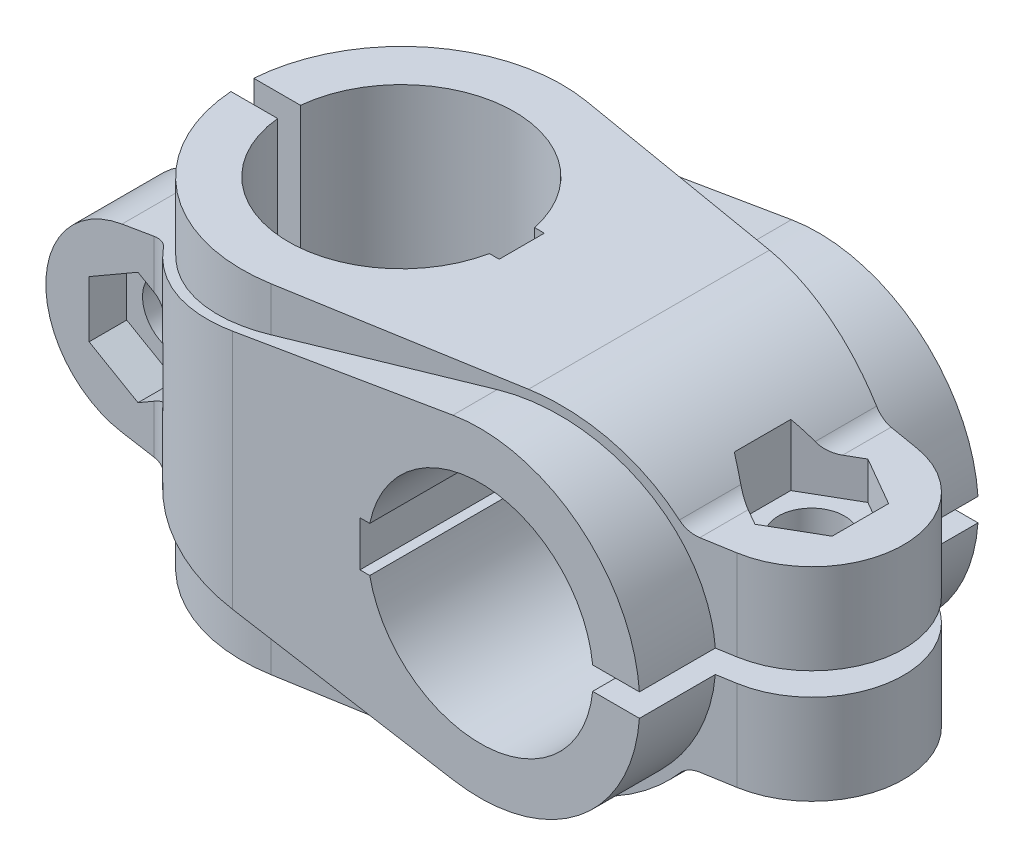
ISO-10303-21;
HEADER;
FILE_DESCRIPTION(('STEP AP214'),'2;1');
FILE_NAME('part.step','',(''),(''),'','','');
FILE_SCHEMA(('AUTOMOTIVE_DESIGN { 1 0 10303 214 1 1 1 1 }'));
ENDSEC;
DATA;
#1=APPLICATION_CONTEXT('core data for automotive mechanical design processes');
#2=APPLICATION_PROTOCOL_DEFINITION('international standard','automotive_design',2000,#1);
#3=PRODUCT_CONTEXT('',#1,'mechanical');
#4=PRODUCT('Part','Part','',(#3));
#5=PRODUCT_RELATED_PRODUCT_CATEGORY('part','',(#4));
#6=PRODUCT_DEFINITION_FORMATION('','',#4);
#7=PRODUCT_DEFINITION_CONTEXT('part definition',#1,'design');
#8=PRODUCT_DEFINITION('design','',#6,#7);
#9=PRODUCT_DEFINITION_SHAPE('','',#8);
#10=(LENGTH_UNIT() NAMED_UNIT(*) SI_UNIT(.MILLI.,.METRE.));
#11=(NAMED_UNIT(*) PLANE_ANGLE_UNIT() SI_UNIT($,.RADIAN.));
#12=(NAMED_UNIT(*) SI_UNIT($,.STERADIAN.) SOLID_ANGLE_UNIT());
#13=UNCERTAINTY_MEASURE_WITH_UNIT(LENGTH_MEASURE(1.E-05),#10,'distance_accuracy_value','');
#14=(GEOMETRIC_REPRESENTATION_CONTEXT(3) GLOBAL_UNCERTAINTY_ASSIGNED_CONTEXT((#13)) GLOBAL_UNIT_ASSIGNED_CONTEXT((#10,
#11,#12)) REPRESENTATION_CONTEXT('',''));
#15=CARTESIAN_POINT('',(0.,0.,0.));
#16=DIRECTION('',(0.,0.,1.));
#17=DIRECTION('',(1.,0.,0.));
#18=AXIS2_PLACEMENT_3D('',#15,#16,#17);
#19=CARTESIAN_POINT('',(-16.4099999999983,22.5,3.46250805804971E-12));
#20=DIRECTION('',(0.,-1.,0.));
#21=DIRECTION('',(-0.761970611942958,0.,-0.647611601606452));
#22=AXIS2_PLACEMENT_3D('',#19,#20,#21);
#23=CYLINDRICAL_SURFACE('',#22,22.5000000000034);
#24=DIRECTION('',(0.,-1.,0.));
#25=VECTOR('',#24,1.);
#26=CARTESIAN_POINT('',(-31.5,22.5,-16.6895745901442));
#27=LINE('',#26,#25);
#28=CARTESIAN_POINT('',(-31.5,-3.75277674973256,-16.6895745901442));
#29=VERTEX_POINT('',#28);
#30=CARTESIAN_POINT('',(-31.5,3.75277674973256,-16.6895745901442));
#31=VERTEX_POINT('',#30);
#32=EDGE_CURVE('E9',#29,#31,#27,.F.);
#33=ORIENTED_EDGE('',*,*,#32,.T.);
#34=CARTESIAN_POINT('',(-16.4099999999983,-4.95943881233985,3.46250805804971E-12));
#35=DIRECTION('',(-0.5,-0.866025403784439,0.));
#36=DIRECTION('',(0.866025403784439,-0.5,0.));
#37=AXIS2_PLACEMENT_3D('',#34,#35,#36);
#38=ELLIPSE('',#37,25.9807621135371,22.5000000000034);
#39=CARTESIAN_POINT('',(-33.554338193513,4.93884945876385,-14.5712617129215));
#40=VERTEX_POINT('',#39);
#41=EDGE_CURVE('E567',#31,#40,#38,.F.);
#42=ORIENTED_EDGE('',*,*,#41,.T.);
#43=DIRECTION('',(0.,-1.,0.));
#44=VECTOR('',#43,1.);
#45=CARTESIAN_POINT('',(-33.554338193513,8.,-14.5712617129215));
#46=LINE('',#45,#44);
#47=CARTESIAN_POINT('',(-33.554338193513,5.46423820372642,-14.5712617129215));
#48=VERTEX_POINT('',#47);
#49=EDGE_CURVE('E677',#48,#40,#46,.T.);
#50=ORIENTED_EDGE('',*,*,#49,.F.);
#51=DIRECTION('',(3.29132201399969E-08,1.,-3.87252268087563E-08));
#52=VECTOR('',#51,1.);
#53=CARTESIAN_POINT('',(-33.5543387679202,5.46423853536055,-14.571261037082));
#54=LINE('',#53,#52);
#55=CARTESIAN_POINT('',(-33.5543385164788,13.10376685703,-14.5712613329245));
#56=VERTEX_POINT('',#55);
#57=EDGE_CURVE('E1895',#56,#48,#54,.F.);
#58=ORIENTED_EDGE('',*,*,#57,.F.);
#59=CARTESIAN_POINT('',(-16.4099999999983,16.0137233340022,-22.5));
#60=CARTESIAN_POINT('',(-17.9063035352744,15.7597515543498,-22.4999999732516));
#61=CARTESIAN_POINT('',(-19.391571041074,15.5076529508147,-22.3510562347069));
#62=CARTESIAN_POINT('',(-22.2997169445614,15.0140452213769,-21.7662600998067));
#63=CARTESIAN_POINT('',(-23.7225953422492,14.7725360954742,-21.330407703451));
#64=CARTESIAN_POINT('',(-27.386283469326,14.1506880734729,-19.7975976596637));
#65=CARTESIAN_POINT('',(-29.4690443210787,13.7971752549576,-18.4833051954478));
#66=CARTESIAN_POINT('',(-32.0995700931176,13.3506887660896,-16.1634027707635));
#67=CARTESIAN_POINT('',(-32.8575966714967,13.2220267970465,-15.39103781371));
#68=CARTESIAN_POINT('',(-33.5543385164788,13.10376685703,-14.5712613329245));
#69=B_SPLINE_CURVE_WITH_KNOTS('',3,(#59,#60,#61,#62,#63,#64,#65,#66,#67,#68),.UNSPECIFIED.,.F.,
.F.,(4,2,2,2,4),(0.,0.226556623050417,0.453113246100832,0.83174618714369,1.),.UNSPECIFIED.);
#70=CARTESIAN_POINT('',(-16.4099999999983,16.0137233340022,-22.5));
#71=VERTEX_POINT('',#70);
#72=EDGE_CURVE('E1902',#71,#56,#69,.T.);
#73=ORIENTED_EDGE('',*,*,#72,.F.);
#74=DIRECTION('',(0.,-1.,0.));
#75=VECTOR('',#74,1.);
#76=CARTESIAN_POINT('',(-16.4099999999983,16.0137233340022,-22.5));
#77=LINE('',#76,#75);
#78=CARTESIAN_POINT('',(-16.4099999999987,-16.0137233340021,-22.5));
#79=VERTEX_POINT('',#78);
#80=EDGE_CURVE('E1907',#79,#71,#77,.F.);
#81=ORIENTED_EDGE('',*,*,#80,.F.);
#82=CARTESIAN_POINT('',(-33.554338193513,-13.1037669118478,-14.5712617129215));
#83=CARTESIAN_POINT('',(-32.2278158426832,-13.3289212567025,-16.1320289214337));
#84=CARTESIAN_POINT('',(-30.7012306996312,-13.5880328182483,-17.4979657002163));
#85=CARTESIAN_POINT('',(-27.3158630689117,-14.1626407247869,-19.7861659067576));
#86=CARTESIAN_POINT('',(-25.4773948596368,-14.474689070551,-20.6935387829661));
#87=CARTESIAN_POINT('',(-21.2384662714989,-15.1941742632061,-22.1094114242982));
#88=CARTESIAN_POINT('',(-18.8300614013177,-15.6029595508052,-22.4999999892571));
#89=CARTESIAN_POINT('',(-16.4099999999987,-16.0137233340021,-22.5));
#90=B_SPLINE_CURVE_WITH_KNOTS('',3,(#82,#83,#84,#85,#86,#87,#88,#89),.UNSPECIFIED.,.F.,.F.,(4,2,
2,4),(0.,0.313828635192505,0.628113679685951,1.),.UNSPECIFIED.);
#91=CARTESIAN_POINT('',(-33.5543381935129,-13.1037669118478,-14.5712617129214));
#92=VERTEX_POINT('',#91);
#93=EDGE_CURVE('E756',#92,#79,#90,.T.);
#94=ORIENTED_EDGE('',*,*,#93,.F.);
#95=DIRECTION('',(-7.52932056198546E-08,1.,8.85889129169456E-08));
#96=VECTOR('',#95,1.);
#97=CARTESIAN_POINT('',(-33.5543381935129,-13.1037669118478,-14.5712617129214));
#98=LINE('',#97,#96);
#99=CARTESIAN_POINT('',(-33.554338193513,-5.46423820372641,-14.5712617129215));
#100=VERTEX_POINT('',#99);
#101=EDGE_CURVE('E748',#100,#92,#98,.F.);
#102=ORIENTED_EDGE('',*,*,#101,.F.);
#103=CARTESIAN_POINT('',(-33.554338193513,-4.93884945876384,-14.5712617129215));
#104=VERTEX_POINT('',#103);
#105=EDGE_CURVE('E676',#104,#100,#46,.T.);
#106=ORIENTED_EDGE('',*,*,#105,.F.);
#107=CARTESIAN_POINT('',(-16.4099999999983,4.95943881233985,3.46250805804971E-12));
#108=DIRECTION('',(-0.5,0.866025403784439,0.));
#109=DIRECTION('',(-0.866025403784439,-0.5,0.));
#110=AXIS2_PLACEMENT_3D('',#107,#108,#109);
#111=ELLIPSE('',#110,25.9807621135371,22.5000000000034);
#112=EDGE_CURVE('E596',#104,#29,#111,.F.);
#113=ORIENTED_EDGE('',*,*,#112,.T.);
#114=EDGE_LOOP('',(#33,#42,#50,#58,#73,#81,#94,#102,#106,#113));
#115=FACE_BOUND('',#114,.T.);
#116=ADVANCED_FACE('F14',(#115),#23,.T.);
#117=CARTESIAN_POINT('',(-35.8707296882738,22.5,-16.5400000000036));
#118=DIRECTION('',(0.,-1.,0.));
#119=DIRECTION('',(0.761970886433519,0.,0.647611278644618));
#120=AXIS2_PLACEMENT_3D('',#117,#118,#119);
#121=CYLINDRICAL_SURFACE('',#120,3.04000000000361);
#122=CARTESIAN_POINT('',(-35.8707296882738,6.27621871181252,-16.5400000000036));
#123=DIRECTION('',(-0.5,-0.866025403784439,0.));
#124=DIRECTION('',(0.866025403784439,-0.5,0.));
#125=AXIS2_PLACEMENT_3D('',#122,#123,#124);
#126=ELLIPSE('',#125,3.51028963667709,3.04000000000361);
#127=CARTESIAN_POINT('',(-35.8707296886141,6.276218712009,-13.5));
#128=VERTEX_POINT('',#127);
#129=EDGE_CURVE('E599',#128,#40,#126,.F.);
#130=ORIENTED_EDGE('',*,*,#129,.F.);
#131=DIRECTION('',(0.,-1.,0.));
#132=VECTOR('',#131,1.);
#133=CARTESIAN_POINT('',(-35.8707296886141,8.,-13.5));
#134=LINE('',#133,#132);
#135=CARTESIAN_POINT('',(-35.8707296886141,6.80160745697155,-13.5));
#136=VERTEX_POINT('',#135);
#137=EDGE_CURVE('E656',#136,#128,#134,.T.);
#138=ORIENTED_EDGE('',*,*,#137,.F.);
#139=DIRECTION('',(3.15241395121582E-11,1.,0.));
#140=VECTOR('',#139,1.);
#141=CARTESIAN_POINT('',(-35.870729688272,6.80160745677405,-13.5));
#142=LINE('',#141,#140);
#143=CARTESIAN_POINT('',(-35.8707296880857,12.7105993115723,-13.5));
#144=VERTEX_POINT('',#143);
#145=EDGE_CURVE('E689',#144,#136,#142,.F.);
#146=ORIENTED_EDGE('',*,*,#145,.F.);
#147=CARTESIAN_POINT('',(-35.8707296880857,12.7105993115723,-13.5));
#148=CARTESIAN_POINT('',(-35.8151746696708,12.7200286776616,-13.4999985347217));
#149=CARTESIAN_POINT('',(-35.7596195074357,12.7294563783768,-13.5015228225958));
#150=CARTESIAN_POINT('',(-35.648955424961,12.7482345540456,-13.5075968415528));
#151=CARTESIAN_POINT('',(-35.5938456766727,12.757585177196,-13.5121310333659));
#152=CARTESIAN_POINT('',(-35.4841934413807,12.7761905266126,-13.5241719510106));
#153=CARTESIAN_POINT('',(-35.4296495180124,12.7854454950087,-13.5316652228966));
#154=CARTESIAN_POINT('',(-35.3212453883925,12.8038407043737,-13.5495697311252));
#155=CARTESIAN_POINT('',(-35.2673833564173,12.812981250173,-13.5599696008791));
#156=CARTESIAN_POINT('',(-35.1604558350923,12.831128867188,-13.5836340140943));
#157=CARTESIAN_POINT('',(-35.1073883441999,12.8401362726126,-13.5968892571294));
#158=CARTESIAN_POINT('',(-35.0021598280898,12.8579988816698,-13.6262117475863));
#159=CARTESIAN_POINT('',(-34.9499968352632,12.8668544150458,-13.6422717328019));
#160=CARTESIAN_POINT('',(-34.8466850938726,12.8843945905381,-13.6771518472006));
#161=CARTESIAN_POINT('',(-34.7955346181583,12.8930795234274,-13.6959667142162));
#162=CARTESIAN_POINT('',(-34.6943542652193,12.9102598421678,-13.7363053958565));
#163=CARTESIAN_POINT('',(-34.6443231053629,12.9187554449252,-13.7578259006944));
#164=CARTESIAN_POINT('',(-34.5454870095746,12.9355384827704,-13.8035251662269));
#165=CARTESIAN_POINT('',(-34.49668143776,12.9438260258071,-13.8277025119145));
#166=CARTESIAN_POINT('',(-34.4004020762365,12.9601743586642,-13.8786650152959));
#167=CARTESIAN_POINT('',(-34.3529284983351,12.9682351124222,-13.9054505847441));
#168=CARTESIAN_POINT('',(-34.2594192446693,12.9841113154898,-13.9615790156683));
#169=CARTESIAN_POINT('',(-34.2133848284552,12.9919265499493,-13.9909240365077));
#170=CARTESIAN_POINT('',(-34.122861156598,13.0072931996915,-14.0521203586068));
#171=CARTESIAN_POINT('',(-34.0783744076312,13.0148441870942,-14.0839754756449));
#172=CARTESIAN_POINT('',(-33.9910550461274,13.0296638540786,-14.1501400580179));
#173=CARTESIAN_POINT('',(-33.9482263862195,13.0369318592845,-14.1844548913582));
#174=CARTESIAN_POINT('',(-33.864334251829,13.0511671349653,-14.2554853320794));
#175=CARTESIAN_POINT('',(-33.8232763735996,13.0581334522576,-14.2922077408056));
#176=CARTESIAN_POINT('',(-33.7430398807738,13.0717468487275,-14.3679981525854));
#177=CARTESIAN_POINT('',(-33.7038687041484,13.0783926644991,-14.4070742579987));
#178=CARTESIAN_POINT('',(-33.6275211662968,13.0913469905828,-14.4875121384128));
#179=CARTESIAN_POINT('',(-33.5903542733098,13.0976538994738,-14.5288831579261));
#180=CARTESIAN_POINT('',(-33.5543385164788,13.1037668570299,-14.5712613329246));
#181=B_SPLINE_CURVE_WITH_KNOTS('',3,(#147,#148,#149,#150,#151,#152,#153,#154,#155,#156,#157,
#158,#159,#160,#161,#162,#163,#164,#165,#166,#167,#168,#169,#170,#171,#172,#173,#174,#175,#176,
#177,#178,#179,#180),.UNSPECIFIED.,.F.,.F.,(4,2,2,2,2,2,2,2,2,2,2,2,2,2,2,2,4),(0.,
0.169027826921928,0.33718972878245,0.50459569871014,0.671355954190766,0.837581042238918,
1.00338194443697,1.16887018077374,1.33415791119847,1.49935803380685,1.66458427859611,
1.82995129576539,1.99557473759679,2.16157133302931,2.32805895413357,2.49515667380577,
2.66298481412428),.UNSPECIFIED.);
#182=EDGE_CURVE('E776',#144,#56,#181,.T.);
#183=ORIENTED_EDGE('',*,*,#182,.T.);
#184=ORIENTED_EDGE('',*,*,#57,.T.);
#185=ORIENTED_EDGE('',*,*,#49,.T.);
#186=EDGE_LOOP('',(#130,#138,#146,#183,#184,#185));
#187=FACE_BOUND('',#186,.T.);
#188=ADVANCED_FACE('F692',(#187),#121,.F.);
#189=CARTESIAN_POINT('',(-35.8707296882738,-6.27621871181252,-16.5400000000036));
#190=DIRECTION('',(-0.5,0.866025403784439,0.));
#191=DIRECTION('',(-0.866025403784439,-0.5,0.));
#192=AXIS2_PLACEMENT_3D('',#189,#190,#191);
#193=ELLIPSE('',#192,3.51028963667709,3.04000000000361);
#194=CARTESIAN_POINT('',(-35.8707296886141,-6.27621871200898,-13.5));
#195=VERTEX_POINT('',#194);
#196=EDGE_CURVE('E30',#104,#195,#193,.F.);
#197=ORIENTED_EDGE('',*,*,#196,.F.);
#198=ORIENTED_EDGE('',*,*,#105,.T.);
#199=ORIENTED_EDGE('',*,*,#101,.T.);
#200=CARTESIAN_POINT('',(-33.5543381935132,-13.1037669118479,-14.5712617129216));
#201=CARTESIAN_POINT('',(-33.5903539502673,-13.097653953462,-14.5288835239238));
#202=CARTESIAN_POINT('',(-33.6275208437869,-13.0913470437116,-14.4875124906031));
#203=CARTESIAN_POINT('',(-33.7038683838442,-13.0783927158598,-14.4070745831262));
#204=CARTESIAN_POINT('',(-33.7430395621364,-13.0717468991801,-14.3679984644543));
#205=CARTESIAN_POINT('',(-33.8232760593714,-13.0581335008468,-14.2922080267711));
#206=CARTESIAN_POINT('',(-33.8643339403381,-13.0511671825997,-14.255485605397));
#207=CARTESIAN_POINT('',(-33.948226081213,-13.0369319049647,-14.1844551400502));
#208=CARTESIAN_POINT('',(-33.9910547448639,-13.0296638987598,-14.1501402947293));
#209=CARTESIAN_POINT('',(-34.0783741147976,-13.014844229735,-14.0839756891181));
#210=CARTESIAN_POINT('',(-34.1228608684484,-13.0072932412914,-14.0521205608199));
#211=CARTESIAN_POINT('',(-34.2133845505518,-12.9919265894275,-13.9909242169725));
#212=CARTESIAN_POINT('',(-34.2594189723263,-12.9841113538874,-13.9615791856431));
#213=CARTESIAN_POINT('',(-34.3529282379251,-12.9682351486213,-13.905450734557));
#214=CARTESIAN_POINT('',(-34.4004018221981,-12.9601743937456,-13.8786651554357));
#215=CARTESIAN_POINT('',(-34.4966811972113,-12.9438260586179,-13.8277026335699));
#216=CARTESIAN_POINT('',(-34.5454867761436,-12.9355385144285,-13.8035252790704));
#217=CARTESIAN_POINT('',(-34.644322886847,-12.9187554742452,-13.7578259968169));
#218=CARTESIAN_POINT('',(-34.6943540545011,-12.9102598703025,-13.7363054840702));
#219=CARTESIAN_POINT('',(-34.7955344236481,-12.8930795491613,-13.6959667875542));
#220=CARTESIAN_POINT('',(-34.8466849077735,-12.8843946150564,-13.6771519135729));
#221=CARTESIAN_POINT('',(-34.9499966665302,-12.8668544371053,-13.6422717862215));
#222=CARTESIAN_POINT('',(-35.002159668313,-12.8579989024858,-13.6262117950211));
#223=CARTESIAN_POINT('',(-35.1073882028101,-12.8401362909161,-13.5968892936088));
#224=CARTESIAN_POINT('',(-35.1604557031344,-12.8311288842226,-13.5836340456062));
#225=CARTESIAN_POINT('',(-35.2673832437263,-12.8129812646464,-13.5599696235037));
#226=CARTESIAN_POINT('',(-35.3212452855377,-12.8038407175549,-13.5495697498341));
#227=CARTESIAN_POINT('',(-35.4296494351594,-12.7854455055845,-13.5316652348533));
#228=CARTESIAN_POINT('',(-35.4841933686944,-12.7761905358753,-13.524171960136));
#229=CARTESIAN_POINT('',(-35.5938456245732,-12.7575851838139,-13.5121310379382));
#230=CARTESIAN_POINT('',(-35.6489553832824,-12.7482345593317,-13.5075968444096));
#231=CARTESIAN_POINT('',(-35.7596194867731,-12.7294563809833,-13.5015228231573));
#232=CARTESIAN_POINT('',(-35.8151746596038,-12.7200286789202,-13.4999985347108));
#233=CARTESIAN_POINT('',(-35.8707296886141,-12.7105993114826,-13.5));
#234=B_SPLINE_CURVE_WITH_KNOTS('',3,(#200,#201,#202,#203,#204,#205,#206,#207,#208,#209,#210,
#211,#212,#213,#214,#215,#216,#217,#218,#219,#220,#221,#222,#223,#224,#225,#226,#227,#228,#229,
#230,#231,#232,#233),.UNSPECIFIED.,.F.,.F.,(4,2,2,2,2,2,2,2,2,2,2,2,2,2,2,2,4),(0.,
0.167828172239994,0.334925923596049,0.501413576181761,0.667410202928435,0.833033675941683,
0.998400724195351,1.16362700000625,1.32882715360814,1.49411491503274,1.65960318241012,
1.82540411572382,1.99162923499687,2.15838952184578,2.32579552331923,2.49395745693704,
2.66298531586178),.UNSPECIFIED.);
#235=CARTESIAN_POINT('',(-35.8707296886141,-12.7105993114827,-13.5));
#236=VERTEX_POINT('',#235);
#237=EDGE_CURVE('E760',#92,#236,#234,.T.);
#238=ORIENTED_EDGE('',*,*,#237,.T.);
#239=DIRECTION('',(5.7894462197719E-11,1.,0.));
#240=VECTOR('',#239,1.);
#241=CARTESIAN_POINT('',(-35.8707296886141,-12.7105993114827,-13.5));
#242=LINE('',#241,#240);
#243=CARTESIAN_POINT('',(-35.8707296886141,-6.80160745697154,-13.5));
#244=VERTEX_POINT('',#243);
#245=EDGE_CURVE('E755',#244,#236,#242,.F.);
#246=ORIENTED_EDGE('',*,*,#245,.F.);
#247=EDGE_CURVE('E650',#195,#244,#134,.T.);
#248=ORIENTED_EDGE('',*,*,#247,.F.);
#249=EDGE_LOOP('',(#197,#198,#199,#238,#246,#248));
#250=FACE_BOUND('',#249,.T.);
#251=ADVANCED_FACE('F726',(#250),#121,.F.);
#252=CARTESIAN_POINT('',(-35.8707296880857,-12.7105993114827,-13.5));
#253=DIRECTION('',(0.,0.,-1.));
#254=DIRECTION('',(-1.,0.,0.));
#255=AXIS2_PLACEMENT_3D('',#252,#253,#254);
#256=PLANE('',#255);
#257=ORIENTED_EDGE('',*,*,#137,.T.);
#258=DIRECTION('',(-0.866025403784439,0.5,0.));
#259=VECTOR('',#258,1.);
#260=CARTESIAN_POINT('',(-27.6491963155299,1.5295142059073,-13.5));
#261=LINE('',#260,#259);
#262=CARTESIAN_POINT('',(-38.,7.50555349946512,-13.5));
#263=VERTEX_POINT('',#262);
#264=EDGE_CURVE('E23',#128,#263,#261,.T.);
#265=ORIENTED_EDGE('',*,*,#264,.T.);
#266=DIRECTION('',(-0.866025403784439,-0.5,0.));
#267=VECTOR('',#266,1.);
#268=CARTESIAN_POINT('',(-45.1568982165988,3.37351638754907,-13.5));
#269=LINE('',#268,#267);
#270=CARTESIAN_POINT('',(-44.5,3.75277674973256,-13.5));
#271=VERTEX_POINT('',#270);
#272=EDGE_CURVE('E671',#263,#271,#269,.T.);
#273=ORIENTED_EDGE('',*,*,#272,.T.);
#274=DIRECTION('',(0.,-1.,0.));
#275=VECTOR('',#274,1.);
#276=CARTESIAN_POINT('',(-44.5,-12.7105993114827,-13.5));
#277=LINE('',#276,#275);
#278=CARTESIAN_POINT('',(-44.5,-3.75277674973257,-13.5));
#279=VERTEX_POINT('',#278);
#280=EDGE_CURVE('E668',#271,#279,#277,.T.);
#281=ORIENTED_EDGE('',*,*,#280,.T.);
#282=DIRECTION('',(0.866025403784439,-0.5,0.));
#283=VECTOR('',#282,1.);
#284=CARTESIAN_POINT('',(-34.1491963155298,-9.72881604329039,-13.5));
#285=LINE('',#284,#283);
#286=CARTESIAN_POINT('',(-38.,-7.50555349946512,-13.5));
#287=VERTEX_POINT('',#286);
#288=EDGE_CURVE('E664',#279,#287,#285,.T.);
#289=ORIENTED_EDGE('',*,*,#288,.T.);
#290=DIRECTION('',(0.866025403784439,0.5,0.));
#291=VECTOR('',#290,1.);
#292=CARTESIAN_POINT('',(-38.6568982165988,-7.88481386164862,-13.5));
#293=LINE('',#292,#291);
#294=EDGE_CURVE('E662',#287,#195,#293,.T.);
#295=ORIENTED_EDGE('',*,*,#294,.T.);
#296=ORIENTED_EDGE('',*,*,#247,.T.);
#297=ORIENTED_EDGE('',*,*,#245,.T.);
#298=DIRECTION('',(-0.985899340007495,0.167339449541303,0.));
#299=VECTOR('',#298,1.);
#300=CARTESIAN_POINT('',(-35.8707296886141,-12.7105993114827,-13.5));
#301=LINE('',#300,#299);
#302=CARTESIAN_POINT('',(-40.124847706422,-11.988535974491,-13.5));
#303=VERTEX_POINT('',#302);
#304=EDGE_CURVE('E779',#236,#303,#301,.T.);
#305=ORIENTED_EDGE('',*,*,#304,.T.);
#306=CARTESIAN_POINT('',(-38.09,0.,-13.5));
#307=DIRECTION('',(0.,0.,-1.));
#308=DIRECTION('',(-0.167339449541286,-0.985899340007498,0.));
#309=AXIS2_PLACEMENT_3D('',#306,#307,#308);
#310=CIRCLE('',#309,12.1599999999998);
#311=CARTESIAN_POINT('',(-40.124847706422,11.988535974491,-13.5));
#312=VERTEX_POINT('',#311);
#313=EDGE_CURVE('E782',#303,#312,#310,.T.);
#314=ORIENTED_EDGE('',*,*,#313,.T.);
#315=DIRECTION('',(0.985899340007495,0.1673394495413,0.));
#316=VECTOR('',#315,1.);
#317=CARTESIAN_POINT('',(-40.124847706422,11.988535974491,-13.5));
#318=LINE('',#317,#316);
#319=EDGE_CURVE('E787',#312,#144,#318,.T.);
#320=ORIENTED_EDGE('',*,*,#319,.T.);
#321=ORIENTED_EDGE('',*,*,#145,.T.);
#322=EDGE_LOOP('',(#257,#265,#273,#281,#289,#295,#296,#297,#305,#314,#320,#321));
#323=FACE_BOUND('',#322,.T.);
#324=ADVANCED_FACE('F686',(#323),#256,.T.);
#325=CARTESIAN_POINT('',(-35.8707296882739,22.5,16.540000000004));
#326=DIRECTION('',(0.,-1.,0.));
#327=DIRECTION('',(3.13199758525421E-13,0.,-1.));
#328=AXIS2_PLACEMENT_3D('',#325,#326,#327);
#329=CYLINDRICAL_SURFACE('',#328,3.04000000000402);
#330=DIRECTION('',(-1.44297251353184E-12,-1.,0.));
#331=VECTOR('',#330,1.);
#332=CARTESIAN_POINT('',(-35.8707296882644,-6.80160745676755,13.5));
#333=LINE('',#332,#331);
#334=CARTESIAN_POINT('',(-35.870729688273,12.7105993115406,13.5));
#335=VERTEX_POINT('',#334);
#336=CARTESIAN_POINT('',(-35.8707296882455,6.2762187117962,13.5));
#337=VERTEX_POINT('',#336);
#338=EDGE_CURVE('E798',#335,#337,#333,.T.);
#339=ORIENTED_EDGE('',*,*,#338,.T.);
#340=CARTESIAN_POINT('',(-35.8707296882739,6.27621871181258,16.540000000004));
#341=DIRECTION('',(0.5,0.866025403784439,0.));
#342=DIRECTION('',(0.866025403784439,-0.5,0.));
#343=AXIS2_PLACEMENT_3D('',#340,#341,#342);
#344=ELLIPSE('',#343,3.51028963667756,3.04000000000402);
#345=CARTESIAN_POINT('',(-33.5543387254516,4.93884976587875,14.5712610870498));
#346=VERTEX_POINT('',#345);
#347=EDGE_CURVE('E645',#337,#346,#344,.F.);
#348=ORIENTED_EDGE('',*,*,#347,.T.);
#349=DIRECTION('',(0.,-1.,0.));
#350=VECTOR('',#349,1.);
#351=CARTESIAN_POINT('',(-33.5543387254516,8.,14.5712610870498));
#352=LINE('',#351,#350);
#353=CARTESIAN_POINT('',(-33.5543387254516,5.46423851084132,14.5712610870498));
#354=VERTEX_POINT('',#353);
#355=EDGE_CURVE('E825',#354,#346,#352,.T.);
#356=ORIENTED_EDGE('',*,*,#355,.F.);
#357=DIRECTION('',(-3.06227399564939E-09,1.,-3.60302832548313E-09));
#358=VECTOR('',#357,1.);
#359=CARTESIAN_POINT('',(-33.5543389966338,5.46423866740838,14.5712607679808));
#360=LINE('',#359,#358);
#361=CARTESIAN_POINT('',(-33.5543390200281,13.1037667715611,14.5712607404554));
#362=VERTEX_POINT('',#361);
#363=EDGE_CURVE('E986',#362,#354,#360,.F.);
#364=ORIENTED_EDGE('',*,*,#363,.F.);
#365=CARTESIAN_POINT('',(-33.5543390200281,13.1037667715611,14.5712607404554));
#366=CARTESIAN_POINT('',(-33.5903547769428,13.0976538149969,14.5288825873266));
#367=CARTESIAN_POINT('',(-33.6275216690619,13.0913469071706,14.4875115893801));
#368=CARTESIAN_POINT('',(-33.7038692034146,13.078392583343,14.4070737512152));
#369=CARTESIAN_POINT('',(-33.7430403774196,13.0717467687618,14.3679976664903));
#370=CARTESIAN_POINT('',(-33.823276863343,13.0581333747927,14.2922072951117));
#371=CARTESIAN_POINT('',(-33.8643347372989,13.0511670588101,14.255484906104));
#372=CARTESIAN_POINT('',(-33.9482268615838,13.036931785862,14.1844545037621));
#373=CARTESIAN_POINT('',(-33.9910555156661,13.0296637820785,14.1501396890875));
#374=CARTESIAN_POINT('',(-34.0783748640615,13.0148441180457,14.0839751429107));
#375=CARTESIAN_POINT('',(-34.1228616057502,13.0072931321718,14.0521200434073));
#376=CARTESIAN_POINT('',(-34.2133852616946,12.9919264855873,13.99092375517));
#377=CARTESIAN_POINT('',(-34.2594196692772,12.9841112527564,13.961578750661));
#378=CARTESIAN_POINT('',(-34.3529289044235,12.9682350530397,13.9054503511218));
#379=CARTESIAN_POINT('',(-34.4004024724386,12.9601743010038,13.8786647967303));
#380=CARTESIAN_POINT('',(-34.4966818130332,12.9438259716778,13.827702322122));
#381=CARTESIAN_POINT('',(-34.5454873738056,12.9355384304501,13.8035249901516));
#382=CARTESIAN_POINT('',(-34.6443234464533,12.9187553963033,13.7578257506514));
#383=CARTESIAN_POINT('',(-34.6943545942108,12.9102597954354,13.7363052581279));
#384=CARTESIAN_POINT('',(-34.795534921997,12.8930794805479,13.6959665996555));
#385=CARTESIAN_POINT('',(-34.846685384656,12.8843945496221,13.677151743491));
#386=CARTESIAN_POINT('',(-34.9499970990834,12.8668543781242,13.6422716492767));
#387=CARTESIAN_POINT('',(-35.0021600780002,12.8579988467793,13.6262116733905));
#388=CARTESIAN_POINT('',(-35.1073885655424,12.8401362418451,13.5968892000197));
#389=CARTESIAN_POINT('',(-35.1604560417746,12.8311288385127,13.5836339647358));
#390=CARTESIAN_POINT('',(-35.2673835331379,12.8129812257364,13.5599695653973));
#391=CARTESIAN_POINT('',(-35.3212455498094,12.8038406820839,13.5495697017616));
#392=CARTESIAN_POINT('',(-35.4296496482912,12.7854454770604,13.531665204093));
#393=CARTESIAN_POINT('',(-35.4841935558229,12.7761905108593,13.5241719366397));
#394=CARTESIAN_POINT('',(-35.5938457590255,12.7575851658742,13.5121310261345));
#395=CARTESIAN_POINT('',(-35.6489554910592,12.7482345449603,13.5075968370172));
#396=CARTESIAN_POINT('',(-35.7596195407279,12.7294563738,13.5015228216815));
#397=CARTESIAN_POINT('',(-35.8151746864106,12.7200286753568,13.4999985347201));
#398=CARTESIAN_POINT('',(-35.8707296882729,12.7105993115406,13.5));
#399=B_SPLINE_CURVE_WITH_KNOTS('',3,(#365,#366,#367,#368,#369,#370,#371,#372,#373,#374,#375,
#376,#377,#378,#379,#380,#381,#382,#383,#384,#385,#386,#387,#388,#389,#390,#391,#392,#393,#394,
#395,#396,#397,#398),.UNSPECIFIED.,.F.,.F.,(4,2,2,2,2,2,2,2,2,2,2,2,2,2,2,2,4),(0.,
0.16782809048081,0.334925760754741,0.50141333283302,0.667409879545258,0.833033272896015,
0.998400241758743,1.16362643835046,1.32882651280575,1.49411419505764,1.65960238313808,
1.82540323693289,1.9916282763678,2.15838848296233,2.32579440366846,2.49395625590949,
2.66298403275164),.UNSPECIFIED.);
#400=EDGE_CURVE('E963',#362,#335,#399,.T.);
#401=ORIENTED_EDGE('',*,*,#400,.T.);
#402=EDGE_LOOP('',(#339,#348,#356,#364,#401));
#403=FACE_BOUND('',#402,.T.);
#404=ADVANCED_FACE('F979',(#403),#329,.F.);
#405=CARTESIAN_POINT('',(35.8707296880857,-13.5,12.7105993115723));
#406=DIRECTION('',(0.,-1.,0.));
#407=DIRECTION('',(0.,0.,-1.));
#408=AXIS2_PLACEMENT_3D('',#405,#406,#407);
#409=PLANE('',#408);
#410=DIRECTION('',(-0.866025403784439,0.,-0.5));
#411=VECTOR('',#410,1.);
#412=CARTESIAN_POINT('',(45.1568982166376,-13.5,-3.37351638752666));
#413=LINE('',#412,#411);
#414=CARTESIAN_POINT('',(44.5,-13.5,-3.75277674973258));
#415=VERTEX_POINT('',#414);
#416=CARTESIAN_POINT('',(38.,-13.5,-7.50555349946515));
#417=VERTEX_POINT('',#416);
#418=EDGE_CURVE('E816',#415,#417,#413,.T.);
#419=ORIENTED_EDGE('',*,*,#418,.T.);
#420=DIRECTION('',(-0.866025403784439,0.,0.5));
#421=VECTOR('',#420,1.);
#422=CARTESIAN_POINT('',(27.649196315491,-13.5,-1.5295142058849));
#423=LINE('',#422,#421);
#424=CARTESIAN_POINT('',(35.8707296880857,-13.5,-6.27621871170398));
#425=VERTEX_POINT('',#424);
#426=EDGE_CURVE('E875',#417,#425,#423,.T.);
#427=ORIENTED_EDGE('',*,*,#426,.T.);
#428=DIRECTION('',(0.,0.,-1.));
#429=VECTOR('',#428,1.);
#430=CARTESIAN_POINT('',(35.8707296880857,-13.5,8.));
#431=LINE('',#430,#429);
#432=CARTESIAN_POINT('',(35.870729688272,-13.5,-6.80160745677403));
#433=VERTEX_POINT('',#432);
#434=EDGE_CURVE('E928',#425,#433,#431,.T.);
#435=ORIENTED_EDGE('',*,*,#434,.T.);
#436=DIRECTION('',(2.64100044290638E-11,0.,-1.));
#437=VECTOR('',#436,1.);
#438=CARTESIAN_POINT('',(35.870729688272,-13.5,-6.80160745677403));
#439=LINE('',#438,#437);
#440=CARTESIAN_POINT('',(35.870729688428,-13.5,-12.7105993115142));
#441=VERTEX_POINT('',#440);
#442=EDGE_CURVE('E1826',#433,#441,#439,.T.);
#443=ORIENTED_EDGE('',*,*,#442,.T.);
#444=DIRECTION('',(0.985899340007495,0.,0.167339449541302));
#445=VECTOR('',#444,1.);
#446=CARTESIAN_POINT('',(35.870729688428,-13.5,-12.7105993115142));
#447=LINE('',#446,#445);
#448=CARTESIAN_POINT('',(40.124847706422,-13.5,-11.988535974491));
#449=VERTEX_POINT('',#448);
#450=EDGE_CURVE('E1830',#441,#449,#447,.T.);
#451=ORIENTED_EDGE('',*,*,#450,.T.);
#452=CARTESIAN_POINT('',(38.09,-13.5,0.));
#453=DIRECTION('',(0.,-1.,0.));
#454=DIRECTION('',(0.167339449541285,0.,-0.985899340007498));
#455=AXIS2_PLACEMENT_3D('',#452,#453,#454);
#456=CIRCLE('',#455,12.1599999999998);
#457=CARTESIAN_POINT('',(40.124847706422,-13.5,11.988535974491));
#458=VERTEX_POINT('',#457);
#459=EDGE_CURVE('E1835',#449,#458,#456,.T.);
#460=ORIENTED_EDGE('',*,*,#459,.T.);
#461=DIRECTION('',(-0.985899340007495,0.,0.167339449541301));
#462=VECTOR('',#461,1.);
#463=CARTESIAN_POINT('',(40.124847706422,-13.5,11.988535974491));
#464=LINE('',#463,#462);
#465=CARTESIAN_POINT('',(35.8707296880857,-13.5,12.7105993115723));
#466=VERTEX_POINT('',#465);
#467=EDGE_CURVE('E1840',#458,#466,#464,.T.);
#468=ORIENTED_EDGE('',*,*,#467,.T.);
#469=DIRECTION('',(3.15205320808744E-11,0.,-1.));
#470=VECTOR('',#469,1.);
#471=CARTESIAN_POINT('',(35.8707296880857,-13.5,12.7105993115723));
#472=LINE('',#471,#470);
#473=CARTESIAN_POINT('',(35.8707296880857,-13.5,6.8016074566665));
#474=VERTEX_POINT('',#473);
#475=EDGE_CURVE('E1819',#466,#474,#472,.T.);
#476=ORIENTED_EDGE('',*,*,#475,.T.);
#477=CARTESIAN_POINT('',(35.8707296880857,-13.5,6.27621871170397));
#478=VERTEX_POINT('',#477);
#479=EDGE_CURVE('E934',#474,#478,#431,.T.);
#480=ORIENTED_EDGE('',*,*,#479,.T.);
#481=DIRECTION('',(0.866025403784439,0.,0.5));
#482=VECTOR('',#481,1.);
#483=CARTESIAN_POINT('',(38.6568982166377,-13.5,7.88481386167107));
#484=LINE('',#483,#482);
#485=CARTESIAN_POINT('',(38.,-13.5,7.50555349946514));
#486=VERTEX_POINT('',#485);
#487=EDGE_CURVE('E869',#478,#486,#484,.T.);
#488=ORIENTED_EDGE('',*,*,#487,.T.);
#489=DIRECTION('',(0.866025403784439,0.,-0.5));
#490=VECTOR('',#489,1.);
#491=CARTESIAN_POINT('',(34.149196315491,-13.5,9.72881604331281));
#492=LINE('',#491,#490);
#493=CARTESIAN_POINT('',(44.5,-13.5,3.75277674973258));
#494=VERTEX_POINT('',#493);
#495=EDGE_CURVE('E952',#486,#494,#492,.T.);
#496=ORIENTED_EDGE('',*,*,#495,.T.);
#497=DIRECTION('',(0.,0.,-1.));
#498=VECTOR('',#497,1.);
#499=CARTESIAN_POINT('',(44.5,-13.5,12.7105993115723));
#500=LINE('',#499,#498);
#501=EDGE_CURVE('E949',#494,#415,#500,.T.);
#502=ORIENTED_EDGE('',*,*,#501,.T.);
#503=EDGE_LOOP('',(#419,#427,#435,#443,#451,#460,#468,#476,#480,#488,#496,#502));
#504=FACE_BOUND('',#503,.T.);
#505=ADVANCED_FACE('F1812',(#504),#409,.T.);
#506=CARTESIAN_POINT('',(16.4099999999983,3.46250805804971E-12,22.5));
#507=DIRECTION('',(0.,0.,-1.));
#508=DIRECTION('',(0.761970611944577,-0.647611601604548,0.));
#509=AXIS2_PLACEMENT_3D('',#506,#507,#508);
#510=CYLINDRICAL_SURFACE('',#509,22.5000000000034);
#511=DIRECTION('',(0.,0.,-1.));
#512=VECTOR('',#511,1.);
#513=CARTESIAN_POINT('',(33.5543385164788,-14.5712613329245,8.));
#514=LINE('',#513,#512);
#515=CARTESIAN_POINT('',(33.5543385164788,-14.5712613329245,-4.93884964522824));
#516=VERTEX_POINT('',#515);
#517=CARTESIAN_POINT('',(33.5543385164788,-14.5712613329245,-5.4642383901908));
#518=VERTEX_POINT('',#517);
#519=EDGE_CURVE('E939',#516,#518,#514,.T.);
#520=ORIENTED_EDGE('',*,*,#519,.F.);
#521=CARTESIAN_POINT('',(16.4099999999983,3.46250805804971E-12,4.95943881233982));
#522=DIRECTION('',(0.5,0.,0.866025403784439));
#523=DIRECTION('',(0.866025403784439,0.,-0.5));
#524=AXIS2_PLACEMENT_3D('',#521,#522,#523);
#525=ELLIPSE('',#524,25.9807621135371,22.5000000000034);
#526=CARTESIAN_POINT('',(31.5,-16.6895745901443,-3.75277674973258));
#527=VERTEX_POINT('',#526);
#528=EDGE_CURVE('E872',#516,#527,#525,.F.);
#529=ORIENTED_EDGE('',*,*,#528,.T.);
#530=DIRECTION('',(0.,0.,-1.));
#531=VECTOR('',#530,1.);
#532=CARTESIAN_POINT('',(31.5,-16.6895745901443,22.5));
#533=LINE('',#532,#531);
#534=CARTESIAN_POINT('',(31.5,-16.6895745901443,3.75277674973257));
#535=VERTEX_POINT('',#534);
#536=EDGE_CURVE('E946',#527,#535,#533,.F.);
#537=ORIENTED_EDGE('',*,*,#536,.T.);
#538=CARTESIAN_POINT('',(16.4099999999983,3.46250805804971E-12,-4.95943881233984));
#539=DIRECTION('',(0.5,0.,-0.866025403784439));
#540=DIRECTION('',(-0.866025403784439,0.,-0.5));
#541=AXIS2_PLACEMENT_3D('',#538,#539,#540);
#542=ELLIPSE('',#541,25.9807621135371,22.5000000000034);
#543=CARTESIAN_POINT('',(33.5543385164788,-14.5712613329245,4.93884964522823));
#544=VERTEX_POINT('',#543);
#545=EDGE_CURVE('E852',#535,#544,#542,.F.);
#546=ORIENTED_EDGE('',*,*,#545,.T.);
#547=CARTESIAN_POINT('',(33.5543385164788,-14.5712613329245,5.46423839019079));
#548=VERTEX_POINT('',#547);
#549=EDGE_CURVE('E2624',#548,#544,#514,.T.);
#550=ORIENTED_EDGE('',*,*,#549,.F.);
#551=DIRECTION('',(-3.29132192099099E-08,-3.87252258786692E-08,1.));
#552=VECTOR('',#551,1.);
#553=CARTESIAN_POINT('',(33.5543387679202,-14.5712610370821,5.46423853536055));
#554=LINE('',#553,#552);
#555=CARTESIAN_POINT('',(33.5543385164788,-14.5712613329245,13.1037668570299));
#556=VERTEX_POINT('',#555);
#557=EDGE_CURVE('E1845',#556,#548,#554,.F.);
#558=ORIENTED_EDGE('',*,*,#557,.F.);
#559=CARTESIAN_POINT('',(16.4099999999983,-22.5,16.0137233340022));
#560=CARTESIAN_POINT('',(17.9063035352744,-22.4999999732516,15.7597515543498));
#561=CARTESIAN_POINT('',(19.391571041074,-22.3510562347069,15.5076529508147));
#562=CARTESIAN_POINT('',(22.2997169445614,-21.7662600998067,15.0140452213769));
#563=CARTESIAN_POINT('',(23.7225953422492,-21.330407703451,14.7725360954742));
#564=CARTESIAN_POINT('',(27.386283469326,-19.7975976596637,14.1506880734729));
#565=CARTESIAN_POINT('',(29.4690443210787,-18.4833051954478,13.7971752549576));
#566=CARTESIAN_POINT('',(32.0995700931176,-16.1634027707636,13.3506887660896));
#567=CARTESIAN_POINT('',(32.8575966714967,-15.39103781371,13.2220267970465));
#568=CARTESIAN_POINT('',(33.5543385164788,-14.5712613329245,13.10376685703));
#569=B_SPLINE_CURVE_WITH_KNOTS('',3,(#559,#560,#561,#562,#563,#564,#565,#566,#567,#568),
.UNSPECIFIED.,.F.,.F.,(4,2,2,2,4),(0.,0.226556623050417,0.453113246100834,0.831746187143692,1.),.UNSPECIFIED.);
#570=CARTESIAN_POINT('',(16.4099999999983,-22.5,16.0137233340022));
#571=VERTEX_POINT('',#570);
#572=EDGE_CURVE('E1849',#571,#556,#569,.T.);
#573=ORIENTED_EDGE('',*,*,#572,.F.);
#574=DIRECTION('',(0.,0.,-1.));
#575=VECTOR('',#574,1.);
#576=CARTESIAN_POINT('',(16.4099999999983,-22.5,16.0137233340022));
#577=LINE('',#576,#575);
#578=CARTESIAN_POINT('',(16.4099999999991,-22.5,-16.0137233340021));
#579=VERTEX_POINT('',#578);
#580=EDGE_CURVE('E1860',#579,#571,#577,.F.);
#581=ORIENTED_EDGE('',*,*,#580,.F.);
#582=CARTESIAN_POINT('',(33.5543381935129,-14.5712617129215,-13.1037669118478));
#583=CARTESIAN_POINT('',(32.2278158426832,-16.1320289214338,-13.3289212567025));
#584=CARTESIAN_POINT('',(30.7012306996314,-17.4979657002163,-13.5880328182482));
#585=CARTESIAN_POINT('',(27.3158630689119,-19.7861659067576,-14.1626407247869));
#586=CARTESIAN_POINT('',(25.477394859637,-20.6935387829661,-14.4746890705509));
#587=CARTESIAN_POINT('',(21.2384662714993,-22.1094114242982,-15.1941742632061));
#588=CARTESIAN_POINT('',(18.8300614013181,-22.4999999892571,-15.6029595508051));
#589=CARTESIAN_POINT('',(16.4099999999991,-22.5,-16.0137233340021));
#590=B_SPLINE_CURVE_WITH_KNOTS('',3,(#582,#583,#584,#585,#586,#587,#588,#589),.UNSPECIFIED.,.F.,
.F.,(4,2,2,4),(0.,0.31382863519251,0.628113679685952,1.),.UNSPECIFIED.);
#591=CARTESIAN_POINT('',(33.5543381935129,-14.5712617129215,-13.1037669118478));
#592=VERTEX_POINT('',#591);
#593=EDGE_CURVE('E1885',#592,#579,#590,.T.);
#594=ORIENTED_EDGE('',*,*,#593,.F.);
#595=DIRECTION('',(7.52979732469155E-08,8.85945222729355E-08,1.));
#596=VECTOR('',#595,1.);
#597=CARTESIAN_POINT('',(33.5543381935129,-14.5712617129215,-13.1037669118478));
#598=LINE('',#597,#596);
#599=EDGE_CURVE('E1877',#518,#592,#598,.F.);
#600=ORIENTED_EDGE('',*,*,#599,.F.);
#601=EDGE_LOOP('',(#520,#529,#537,#546,#550,#558,#573,#581,#594,#600));
#602=FACE_BOUND('',#601,.T.);
#603=ADVANCED_FACE('F1862',(#602),#510,.T.);
#604=CARTESIAN_POINT('',(35.8707296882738,-16.5400000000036,22.5));
#605=DIRECTION('',(0.,0.,-1.));
#606=DIRECTION('',(-0.761970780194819,0.64761140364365,0.));
#607=AXIS2_PLACEMENT_3D('',#604,#605,#606);
#608=CYLINDRICAL_SURFACE('',#607,3.04000000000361);
#609=CARTESIAN_POINT('',(35.8707296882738,-16.5400000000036,-6.27621871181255));
#610=DIRECTION('',(0.5,0.,0.866025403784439));
#611=DIRECTION('',(0.866025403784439,0.,-0.5));
#612=AXIS2_PLACEMENT_3D('',#609,#610,#611);
#613=ELLIPSE('',#612,3.51028963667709,3.04000000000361);
#614=EDGE_CURVE('E943',#516,#425,#613,.F.);
#615=ORIENTED_EDGE('',*,*,#614,.F.);
#616=ORIENTED_EDGE('',*,*,#519,.T.);
#617=ORIENTED_EDGE('',*,*,#599,.T.);
#618=CARTESIAN_POINT('',(33.5543381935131,-14.5712617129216,-13.1037669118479));
#619=CARTESIAN_POINT('',(33.5903539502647,-14.5288835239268,-13.0976539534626));
#620=CARTESIAN_POINT('',(33.6275208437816,-14.4875124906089,-13.0913470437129));
#621=CARTESIAN_POINT('',(33.7038683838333,-14.4070745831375,-13.0783927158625));
#622=CARTESIAN_POINT('',(33.7430395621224,-14.3679984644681,-13.0717468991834));
#623=CARTESIAN_POINT('',(33.8232760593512,-14.2922080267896,-13.0581335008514));
#624=CARTESIAN_POINT('',(33.8643339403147,-14.2554856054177,-13.051167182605));
#625=CARTESIAN_POINT('',(33.9482260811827,-14.1844551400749,-13.0369319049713));
#626=CARTESIAN_POINT('',(33.9910547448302,-14.1501402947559,-13.0296638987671));
#627=CARTESIAN_POINT('',(34.0783741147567,-14.083975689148,-13.0148442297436));
#628=CARTESIAN_POINT('',(34.1228608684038,-14.0521205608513,-13.0072932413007));
#629=CARTESIAN_POINT('',(34.2133845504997,-13.9909242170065,-12.9919265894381));
#630=CARTESIAN_POINT('',(34.2594189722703,-13.9615791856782,-12.9841113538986));
#631=CARTESIAN_POINT('',(34.3529282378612,-13.9054507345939,-12.9682351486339));
#632=CARTESIAN_POINT('',(34.4004018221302,-13.8786651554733,-12.9601743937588));
#633=CARTESIAN_POINT('',(34.4966811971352,-13.8277026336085,-12.9438260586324));
#634=CARTESIAN_POINT('',(34.5454867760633,-13.8035252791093,-12.9355385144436));
#635=CARTESIAN_POINT('',(34.6443228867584,-13.7578259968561,-12.9187554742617));
#636=CARTESIAN_POINT('',(34.6943540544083,-13.7363054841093,-12.9102598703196));
#637=CARTESIAN_POINT('',(34.7955344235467,-13.6959667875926,-12.8930795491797));
#638=CARTESIAN_POINT('',(34.8466849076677,-13.6771519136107,-12.8843946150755));
#639=CARTESIAN_POINT('',(34.9499966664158,-13.6422717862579,-12.8668544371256));
#640=CARTESIAN_POINT('',(35.0021596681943,-13.6262117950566,-12.8579989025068));
#641=CARTESIAN_POINT('',(35.1073882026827,-13.5968892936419,-12.8401362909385));
#642=CARTESIAN_POINT('',(35.1604557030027,-13.5836340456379,-12.8311288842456));
#643=CARTESIAN_POINT('',(35.267383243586,-13.5599696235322,-12.8129812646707));
#644=CARTESIAN_POINT('',(35.3212452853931,-13.5495697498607,-12.8038407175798));
#645=CARTESIAN_POINT('',(35.4296494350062,-13.5316652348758,-12.7854455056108));
#646=CARTESIAN_POINT('',(35.484193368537,-13.5241719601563,-12.7761905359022));
#647=CARTESIAN_POINT('',(35.5938456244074,-13.5121310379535,-12.7575851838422));
#648=CARTESIAN_POINT('',(35.6489553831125,-13.5075968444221,-12.7482345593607));
#649=CARTESIAN_POINT('',(35.759619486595,-13.5015228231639,-12.7294563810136));
#650=CARTESIAN_POINT('',(35.8151746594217,-13.4999985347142,-12.7200286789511));
#651=CARTESIAN_POINT('',(35.8707296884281,-13.5,-12.7105993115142));
#652=B_SPLINE_CURVE_WITH_KNOTS('',3,(#618,#619,#620,#621,#622,#623,#624,#625,#626,#627,#628,
#629,#630,#631,#632,#633,#634,#635,#636,#637,#638,#639,#640,#641,#642,#643,#644,#645,#646,#647,
#648,#649,#650,#651),.UNSPECIFIED.,.F.,.F.,(4,2,2,2,2,2,2,2,2,2,2,2,2,2,2,2,4),(0.,
0.167828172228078,0.334925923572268,0.501413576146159,0.667410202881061,0.833033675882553,
0.998400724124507,1.16362699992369,1.32882715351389,1.49411491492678,1.65960318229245,
1.82540411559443,1.99162923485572,2.15838952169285,2.32579552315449,2.49395745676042,
2.66298531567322),.UNSPECIFIED.);
#653=EDGE_CURVE('E1903',#592,#441,#652,.T.);
#654=ORIENTED_EDGE('',*,*,#653,.T.);
#655=ORIENTED_EDGE('',*,*,#442,.F.);
#656=ORIENTED_EDGE('',*,*,#434,.F.);
#657=EDGE_LOOP('',(#615,#616,#617,#654,#655,#656));
#658=FACE_BOUND('',#657,.T.);
#659=ADVANCED_FACE('F730',(#658),#608,.F.);
#660=CARTESIAN_POINT('',(35.8707296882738,-16.5400000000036,6.27621871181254));
#661=DIRECTION('',(0.5,0.,-0.866025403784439));
#662=DIRECTION('',(-0.866025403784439,0.,-0.5));
#663=AXIS2_PLACEMENT_3D('',#660,#661,#662);
#664=ELLIPSE('',#663,3.51028963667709,3.04000000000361);
#665=EDGE_CURVE('E941',#478,#544,#664,.F.);
#666=ORIENTED_EDGE('',*,*,#665,.F.);
#667=ORIENTED_EDGE('',*,*,#479,.F.);
#668=ORIENTED_EDGE('',*,*,#475,.F.);
#669=CARTESIAN_POINT('',(35.8707296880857,-13.5,12.7105993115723));
#670=CARTESIAN_POINT('',(35.8151746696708,-13.4999985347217,12.7200286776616));
#671=CARTESIAN_POINT('',(35.7596195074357,-13.5015228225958,12.7294563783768));
#672=CARTESIAN_POINT('',(35.648955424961,-13.5075968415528,12.7482345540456));
#673=CARTESIAN_POINT('',(35.5938456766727,-13.5121310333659,12.757585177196));
#674=CARTESIAN_POINT('',(35.4841934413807,-13.5241719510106,12.7761905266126));
#675=CARTESIAN_POINT('',(35.4296495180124,-13.5316652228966,12.7854454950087));
#676=CARTESIAN_POINT('',(35.3212453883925,-13.5495697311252,12.8038407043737));
#677=CARTESIAN_POINT('',(35.2673833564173,-13.5599696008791,12.812981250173));
#678=CARTESIAN_POINT('',(35.1604558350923,-13.5836340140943,12.831128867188));
#679=CARTESIAN_POINT('',(35.1073883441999,-13.5968892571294,12.8401362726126));
#680=CARTESIAN_POINT('',(35.0021598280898,-13.6262117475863,12.8579988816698));
#681=CARTESIAN_POINT('',(34.9499968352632,-13.6422717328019,12.8668544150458));
#682=CARTESIAN_POINT('',(34.8466850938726,-13.6771518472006,12.8843945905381));
#683=CARTESIAN_POINT('',(34.7955346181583,-13.6959667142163,12.8930795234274));
#684=CARTESIAN_POINT('',(34.6943542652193,-13.7363053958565,12.9102598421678));
#685=CARTESIAN_POINT('',(34.6443231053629,-13.7578259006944,12.9187554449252));
#686=CARTESIAN_POINT('',(34.5454870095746,-13.8035251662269,12.9355384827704));
#687=CARTESIAN_POINT('',(34.49668143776,-13.8277025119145,12.9438260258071));
#688=CARTESIAN_POINT('',(34.4004020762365,-13.8786650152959,12.9601743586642));
#689=CARTESIAN_POINT('',(34.3529284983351,-13.9054505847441,12.9682351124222));
#690=CARTESIAN_POINT('',(34.2594192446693,-13.9615790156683,12.9841113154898));
#691=CARTESIAN_POINT('',(34.2133848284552,-13.9909240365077,12.9919265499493));
#692=CARTESIAN_POINT('',(34.122861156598,-14.0521203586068,13.0072931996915));
#693=CARTESIAN_POINT('',(34.0783744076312,-14.0839754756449,13.0148441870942));
#694=CARTESIAN_POINT('',(33.9910550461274,-14.1501400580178,13.0296638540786));
#695=CARTESIAN_POINT('',(33.9482263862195,-14.1844548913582,13.0369318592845));
#696=CARTESIAN_POINT('',(33.8643342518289,-14.2554853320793,13.0511671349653));
#697=CARTESIAN_POINT('',(33.8232763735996,-14.2922077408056,13.0581334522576));
#698=CARTESIAN_POINT('',(33.7430398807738,-14.3679981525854,13.0717468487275));
#699=CARTESIAN_POINT('',(33.7038687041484,-14.4070742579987,13.0783926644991));
#700=CARTESIAN_POINT('',(33.6275211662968,-14.4875121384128,13.0913469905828));
#701=CARTESIAN_POINT('',(33.5903542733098,-14.5288831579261,13.0976538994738));
#702=CARTESIAN_POINT('',(33.5543385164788,-14.5712613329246,13.1037668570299));
#703=B_SPLINE_CURVE_WITH_KNOTS('',3,(#669,#670,#671,#672,#673,#674,#675,#676,#677,#678,#679,
#680,#681,#682,#683,#684,#685,#686,#687,#688,#689,#690,#691,#692,#693,#694,#695,#696,#697,#698,
#699,#700,#701,#702),.UNSPECIFIED.,.F.,.F.,(4,2,2,2,2,2,2,2,2,2,2,2,2,2,2,2,4),(0.,
0.169027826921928,0.337189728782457,0.504595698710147,0.671355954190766,0.837581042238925,
1.00338194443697,1.16887018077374,1.33415791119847,1.49935803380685,1.66458427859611,
1.82995129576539,1.99557473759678,2.1615713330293,2.32805895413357,2.49515667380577,
2.66298481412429),.UNSPECIFIED.);
#704=EDGE_CURVE('E1884',#466,#556,#703,.T.);
#705=ORIENTED_EDGE('',*,*,#704,.T.);
#706=ORIENTED_EDGE('',*,*,#557,.T.);
#707=ORIENTED_EDGE('',*,*,#549,.T.);
#708=EDGE_LOOP('',(#666,#667,#668,#705,#706,#707));
#709=FACE_BOUND('',#708,.T.);
#710=ADVANCED_FACE('F2594',(#709),#608,.F.);
#711=CARTESIAN_POINT('',(35.8707296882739,16.540000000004,22.5));
#712=DIRECTION('',(0.,0.,-1.));
#713=DIRECTION('',(1.50564611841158E-12,-1.,0.));
#714=AXIS2_PLACEMENT_3D('',#711,#712,#713);
#715=CYLINDRICAL_SURFACE('',#714,3.04000000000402);
#716=DIRECTION('',(1.08222938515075E-12,0.,-1.));
#717=VECTOR('',#716,1.);
#718=CARTESIAN_POINT('',(35.8707296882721,13.5,12.7105993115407));
#719=LINE('',#718,#717);
#720=CARTESIAN_POINT('',(35.8707296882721,13.5,12.7105993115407));
#721=VERTEX_POINT('',#720);
#722=CARTESIAN_POINT('',(35.870729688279,13.5,6.27621871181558));
#723=VERTEX_POINT('',#722);
#724=EDGE_CURVE('E2720',#721,#723,#719,.T.);
#725=ORIENTED_EDGE('',*,*,#724,.T.);
#726=CARTESIAN_POINT('',(35.8707296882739,16.540000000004,6.2762187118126));
#727=DIRECTION('',(-0.5,0.,0.866025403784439));
#728=DIRECTION('',(-0.866025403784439,0.,-0.5));
#729=AXIS2_PLACEMENT_3D('',#726,#727,#728);
#730=ELLIPSE('',#729,3.51028963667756,3.04000000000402);
#731=CARTESIAN_POINT('',(33.5543390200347,14.5712607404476,4.93884993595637));
#732=VERTEX_POINT('',#731);
#733=EDGE_CURVE('E923',#723,#732,#730,.F.);
#734=ORIENTED_EDGE('',*,*,#733,.T.);
#735=DIRECTION('',(0.,0.,-1.));
#736=VECTOR('',#735,1.);
#737=CARTESIAN_POINT('',(33.5543390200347,14.5712607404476,8.));
#738=LINE('',#737,#736);
#739=CARTESIAN_POINT('',(33.5543390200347,14.5712607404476,5.46423868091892));
#740=VERTEX_POINT('',#739);
#741=EDGE_CURVE('E2762',#740,#732,#738,.T.);
#742=ORIENTED_EDGE('',*,*,#741,.F.);
#743=DIRECTION('',(3.07164927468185E-09,-3.61405939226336E-09,1.));
#744=VECTOR('',#743,1.);
#745=CARTESIAN_POINT('',(33.5543389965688,14.5712607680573,5.46423866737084));
#746=LINE('',#745,#744);
#747=CARTESIAN_POINT('',(33.5543390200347,14.5712607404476,13.10376677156));
#748=VERTEX_POINT('',#747);
#749=EDGE_CURVE('E2723',#748,#740,#746,.F.);
#750=ORIENTED_EDGE('',*,*,#749,.F.);
#751=CARTESIAN_POINT('',(33.5543390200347,14.5712607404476,13.10376677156));
#752=CARTESIAN_POINT('',(33.5903547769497,14.5288825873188,13.0976538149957));
#753=CARTESIAN_POINT('',(33.627521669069,14.4875115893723,13.0913469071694));
#754=CARTESIAN_POINT('',(33.7038692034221,14.4070737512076,13.0783925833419));
#755=CARTESIAN_POINT('',(33.7430403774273,14.3679976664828,13.0717467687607));
#756=CARTESIAN_POINT('',(33.8232768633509,14.2922072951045,13.0581333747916));
#757=CARTESIAN_POINT('',(33.8643347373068,14.2554849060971,13.0511670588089));
#758=CARTESIAN_POINT('',(33.9482268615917,14.1844545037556,13.0369317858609));
#759=CARTESIAN_POINT('',(33.991055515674,14.1501396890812,13.0296637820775));
#760=CARTESIAN_POINT('',(34.0783748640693,14.083975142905,13.0148441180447));
#761=CARTESIAN_POINT('',(34.1228616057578,14.0521200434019,13.0072931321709));
#762=CARTESIAN_POINT('',(34.2133852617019,13.9909237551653,12.9919264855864));
#763=CARTESIAN_POINT('',(34.2594196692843,13.9615787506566,12.9841112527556));
#764=CARTESIAN_POINT('',(34.3529289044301,13.905450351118,12.9682350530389));
#765=CARTESIAN_POINT('',(34.4004024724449,13.8786647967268,12.9601743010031));
#766=CARTESIAN_POINT('',(34.496681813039,13.8277023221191,12.9438259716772));
#767=CARTESIAN_POINT('',(34.545487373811,13.803524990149,12.9355384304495));
#768=CARTESIAN_POINT('',(34.6443234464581,13.7578257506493,12.9187553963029));
#769=CARTESIAN_POINT('',(34.6943545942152,13.7363052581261,12.910259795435));
#770=CARTESIAN_POINT('',(34.7955349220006,13.6959665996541,12.8930794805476));
#771=CARTESIAN_POINT('',(34.8466853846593,13.6771517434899,12.8843945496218));
#772=CARTESIAN_POINT('',(34.9499970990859,13.6422716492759,12.866854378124));
#773=CARTESIAN_POINT('',(35.0021600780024,13.6262116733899,12.8579988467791));
#774=CARTESIAN_POINT('',(35.1073885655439,13.5968892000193,12.840136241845));
#775=CARTESIAN_POINT('',(35.1604560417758,13.5836339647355,12.8311288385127));
#776=CARTESIAN_POINT('',(35.2673835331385,13.5599695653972,12.8129812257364));
#777=CARTESIAN_POINT('',(35.3212455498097,13.5495697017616,12.803840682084));
#778=CARTESIAN_POINT('',(35.429649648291,13.5316652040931,12.7854454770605));
#779=CARTESIAN_POINT('',(35.4841935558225,13.5241719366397,12.7761905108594));
#780=CARTESIAN_POINT('',(35.5938457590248,13.5121310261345,12.7575851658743));
#781=CARTESIAN_POINT('',(35.6489554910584,13.5075968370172,12.7482345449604));
#782=CARTESIAN_POINT('',(35.759619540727,13.5015228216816,12.7294563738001));
#783=CARTESIAN_POINT('',(35.8151746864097,13.4999985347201,12.7200286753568));
#784=CARTESIAN_POINT('',(35.8707296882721,13.5,12.7105993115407));
#785=B_SPLINE_CURVE_WITH_KNOTS('',3,(#751,#752,#753,#754,#755,#756,#757,#758,#759,#760,#761,
#762,#763,#764,#765,#766,#767,#768,#769,#770,#771,#772,#773,#774,#775,#776,#777,#778,#779,#780,
#781,#782,#783,#784),.UNSPECIFIED.,.F.,.F.,(4,2,2,2,2,2,2,2,2,2,2,2,2,2,2,2,4),(0.,
0.167828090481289,0.334925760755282,0.501413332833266,0.667409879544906,0.833033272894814,
0.998400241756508,1.16362643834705,1.32882651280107,1.49411419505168,1.65960238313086,
1.8254032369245,1.99162827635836,2.15838848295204,2.32579440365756,2.49395625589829,
2.6629840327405),.UNSPECIFIED.);
#786=EDGE_CURVE('E1515',#748,#721,#785,.T.);
#787=ORIENTED_EDGE('',*,*,#786,.T.);
#788=EDGE_LOOP('',(#725,#734,#742,#750,#787));
#789=FACE_BOUND('',#788,.T.);
#790=ADVANCED_FACE('F1763',(#789),#715,.F.);
#791=CARTESIAN_POINT('',(33.5543390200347,14.5712607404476,-4.93884993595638));
#792=VERTEX_POINT('',#791);
#793=CARTESIAN_POINT('',(33.5543390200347,14.5712607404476,-5.46423868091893));
#794=VERTEX_POINT('',#793);
#795=EDGE_CURVE('E2626',#792,#794,#738,.T.);
#796=ORIENTED_EDGE('',*,*,#795,.F.);
#797=CARTESIAN_POINT('',(35.8707296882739,16.540000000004,-6.27621871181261));
#798=DIRECTION('',(-0.5,0.,-0.866025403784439));
#799=DIRECTION('',(0.866025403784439,0.,-0.5));
#800=AXIS2_PLACEMENT_3D('',#797,#798,#799);
#801=ELLIPSE('',#800,3.51028963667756,3.04000000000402);
#802=CARTESIAN_POINT('',(35.8707296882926,13.5,-6.27621871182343));
#803=VERTEX_POINT('',#802);
#804=EDGE_CURVE('E904',#792,#803,#801,.F.);
#805=ORIENTED_EDGE('',*,*,#804,.T.);
#806=CARTESIAN_POINT('',(35.870729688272,13.5,-12.7105993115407));
#807=VERTEX_POINT('',#806);
#808=EDGE_CURVE('E2726',#803,#807,#719,.T.);
#809=ORIENTED_EDGE('',*,*,#808,.T.);
#810=CARTESIAN_POINT('',(35.8707296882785,13.5,-12.7105993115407));
#811=CARTESIAN_POINT('',(35.8151746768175,13.4999985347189,-12.7200286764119));
#812=CARTESIAN_POINT('',(35.7596195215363,13.5015228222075,-12.7294563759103));
#813=CARTESIAN_POINT('',(35.6489554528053,13.5075968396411,-12.7482345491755));
#814=CARTESIAN_POINT('',(35.5938457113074,13.5121310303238,-12.7575851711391));
#815=CARTESIAN_POINT('',(35.4841934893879,13.524171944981,-12.7761905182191));
#816=CARTESIAN_POINT('',(35.4296495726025,13.5316652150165,-12.7854454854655));
#817=CARTESIAN_POINT('',(35.3212454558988,13.5495697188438,-12.8038406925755));
#818=CARTESIAN_POINT('',(35.267383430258,13.5599695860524,-12.8129812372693));
#819=CARTESIAN_POINT('',(35.1604559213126,13.5836339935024,-12.8311288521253));
#820=CARTESIAN_POINT('',(35.1073884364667,13.596889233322,-12.840136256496));
#821=CARTESIAN_POINT('',(35.002159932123,13.6262117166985,-12.8579988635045));
#822=CARTESIAN_POINT('',(34.9499969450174,13.6422716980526,-12.8668543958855));
#823=CARTESIAN_POINT('',(34.8466852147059,13.6771518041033,-12.8843945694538));
#824=CARTESIAN_POINT('',(34.7955347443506,13.6959666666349,-12.8930795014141));
#825=CARTESIAN_POINT('',(34.6943544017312,13.736305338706,-12.9102598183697));
#826=CARTESIAN_POINT('',(34.6443232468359,13.7578258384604,-12.9187554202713));
#827=CARTESIAN_POINT('',(34.5454871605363,13.8035250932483,-12.9355384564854));
#828=CARTESIAN_POINT('',(34.4966815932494,13.8277024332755,-12.9438259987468));
#829=CARTESIAN_POINT('',(34.4004022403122,13.8786649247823,-12.9601743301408));
#830=CARTESIAN_POINT('',(34.3529286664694,13.9054504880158,-12.9682350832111));
#831=CARTESIAN_POINT('',(34.2594194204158,13.9615789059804,-12.9841112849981));
#832=CARTESIAN_POINT('',(34.2133850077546,13.9909239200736,-12.9919265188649));
#833=CARTESIAN_POINT('',(34.122861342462,14.0521202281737,-13.0072931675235));
#834=CARTESIAN_POINT('',(34.0783745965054,14.083975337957,-13.0148441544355));
#835=CARTESIAN_POINT('',(33.9910552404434,14.1501399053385,-13.0296638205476));
#836=CARTESIAN_POINT('',(33.9482265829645,14.1844547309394,-13.0369318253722));
#837=CARTESIAN_POINT('',(33.8643344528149,14.2554851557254,-13.0511671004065));
#838=CARTESIAN_POINT('',(33.8232765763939,14.2922075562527,-13.0581334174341));
#839=CARTESIAN_POINT('',(33.7430400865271,14.3679979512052,-13.0717468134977));
#840=CARTESIAN_POINT('',(33.7038689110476,14.4070740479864,-13.0783926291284));
#841=CARTESIAN_POINT('',(33.6275213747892,14.4875119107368,-13.0913469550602));
#842=CARTESIAN_POINT('',(33.5903544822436,14.5288829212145,-13.0976538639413));
#843=CARTESIAN_POINT('',(33.5543387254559,14.5712610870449,-13.1037668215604));
#844=B_SPLINE_CURVE_WITH_KNOTS('',3,(#810,#811,#812,#813,#814,#815,#816,#817,#818,#819,#820,
#821,#822,#823,#824,#825,#826,#827,#828,#829,#830,#831,#832,#833,#834,#835,#836,#837,#838,#839,
#840,#841,#842,#843),.UNSPECIFIED.,.F.,.F.,(4,2,2,2,2,2,2,2,2,2,2,2,2,2,2,2,4),(0.,
0.169027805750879,0.337189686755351,0.50459563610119,0.671355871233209,0.837580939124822,
1.00338182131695,1.16887003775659,1.33415774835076,1.49935785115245,1.66458407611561,
1.82995107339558,1.99557449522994,2.16157107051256,2.3280586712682,2.49515637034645,
2.66298448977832),.UNSPECIFIED.);
#845=CARTESIAN_POINT('',(33.5543387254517,14.5712610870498,-13.1037668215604));
#846=VERTEX_POINT('',#845);
#847=EDGE_CURVE('E1443',#807,#846,#844,.T.);
#848=ORIENTED_EDGE('',*,*,#847,.T.);
#849=DIRECTION('',(3.5515689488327E-08,-4.17872626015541E-08,1.));
#850=VECTOR('',#849,1.);
#851=CARTESIAN_POINT('',(33.5543387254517,14.5712610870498,-13.1037668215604));
#852=LINE('',#851,#850);
#853=EDGE_CURVE('E1773',#794,#846,#852,.F.);
#854=ORIENTED_EDGE('',*,*,#853,.F.);
#855=EDGE_LOOP('',(#796,#805,#809,#848,#854));
#856=FACE_BOUND('',#855,.T.);
#857=ADVANCED_FACE('F1752',(#856),#715,.F.);
#858=CARTESIAN_POINT('',(35.8707296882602,13.5,-12.7105993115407));
#859=DIRECTION('',(0.,1.,0.));
#860=DIRECTION('',(0.,0.,1.));
#861=AXIS2_PLACEMENT_3D('',#858,#859,#860);
#862=PLANE('',#861);
#863=DIRECTION('',(0.866025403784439,0.,0.5));
#864=VECTOR('',#863,1.);
#865=CARTESIAN_POINT('',(27.6491963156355,13.5,1.52951420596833));
#866=LINE('',#865,#864);
#867=CARTESIAN_POINT('',(38.,13.5,7.50555349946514));
#868=VERTEX_POINT('',#867);
#869=EDGE_CURVE('E926',#723,#868,#866,.T.);
#870=ORIENTED_EDGE('',*,*,#869,.F.);
#871=ORIENTED_EDGE('',*,*,#724,.F.);
#872=DIRECTION('',(0.985899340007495,0.,-0.167339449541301));
#873=VECTOR('',#872,1.);
#874=CARTESIAN_POINT('',(35.8707296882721,13.5,12.7105993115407));
#875=LINE('',#874,#873);
#876=CARTESIAN_POINT('',(40.124847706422,13.5,11.988535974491));
#877=VERTEX_POINT('',#876);
#878=EDGE_CURVE('E1782',#721,#877,#875,.T.);
#879=ORIENTED_EDGE('',*,*,#878,.T.);
#880=CARTESIAN_POINT('',(38.09,13.5,0.));
#881=DIRECTION('',(0.,1.,0.));
#882=DIRECTION('',(0.167339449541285,0.,0.985899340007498));
#883=AXIS2_PLACEMENT_3D('',#880,#881,#882);
#884=CIRCLE('',#883,12.1599999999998);
#885=CARTESIAN_POINT('',(40.124847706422,13.5,-11.988535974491));
#886=VERTEX_POINT('',#885);
#887=EDGE_CURVE('E1785',#877,#886,#884,.T.);
#888=ORIENTED_EDGE('',*,*,#887,.T.);
#889=DIRECTION('',(-0.985899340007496,0.,-0.167339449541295));
#890=VECTOR('',#889,1.);
#891=CARTESIAN_POINT('',(40.124847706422,13.5,-11.988535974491));
#892=LINE('',#891,#890);
#893=EDGE_CURVE('E1790',#886,#807,#892,.T.);
#894=ORIENTED_EDGE('',*,*,#893,.T.);
#895=ORIENTED_EDGE('',*,*,#808,.F.);
#896=DIRECTION('',(-0.866025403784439,0.,0.5));
#897=VECTOR('',#896,1.);
#898=CARTESIAN_POINT('',(38.6568982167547,13.5,-7.8848138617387));
#899=LINE('',#898,#897);
#900=CARTESIAN_POINT('',(38.,13.5,-7.50555349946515));
#901=VERTEX_POINT('',#900);
#902=EDGE_CURVE('E921',#901,#803,#899,.T.);
#903=ORIENTED_EDGE('',*,*,#902,.F.);
#904=DIRECTION('',(-0.866025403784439,0.,-0.5));
#905=VECTOR('',#904,1.);
#906=CARTESIAN_POINT('',(34.1491963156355,13.5,-9.72881604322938));
#907=LINE('',#906,#905);
#908=CARTESIAN_POINT('',(44.5,13.5,-3.75277674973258));
#909=VERTEX_POINT('',#908);
#910=EDGE_CURVE('E2739',#909,#901,#907,.T.);
#911=ORIENTED_EDGE('',*,*,#910,.F.);
#912=DIRECTION('',(0.,0.,-1.));
#913=VECTOR('',#912,1.);
#914=CARTESIAN_POINT('',(44.5,13.5,-12.7105993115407));
#915=LINE('',#914,#913);
#916=CARTESIAN_POINT('',(44.5,13.5,3.75277674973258));
#917=VERTEX_POINT('',#916);
#918=EDGE_CURVE('E2741',#917,#909,#915,.T.);
#919=ORIENTED_EDGE('',*,*,#918,.F.);
#920=DIRECTION('',(0.866025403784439,0.,-0.5));
#921=VECTOR('',#920,1.);
#922=CARTESIAN_POINT('',(45.1568982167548,13.5,3.37351638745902));
#923=LINE('',#922,#921);
#924=EDGE_CURVE('E944',#868,#917,#923,.T.);
#925=ORIENTED_EDGE('',*,*,#924,.F.);
#926=EDGE_LOOP('',(#870,#871,#879,#888,#894,#895,#903,#911,#919,#925));
#927=FACE_BOUND('',#926,.T.);
#928=ADVANCED_FACE('F1762',(#927),#862,.T.);
#929=CARTESIAN_POINT('',(16.4099999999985,-2.91086599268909E-12,22.5));
#930=DIRECTION('',(0.,0.,-1.));
#931=DIRECTION('',(-5.43126156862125E-11,1.,0.));
#932=AXIS2_PLACEMENT_3D('',#929,#930,#931);
#933=CYLINDRICAL_SURFACE('',#932,22.5000000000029);
#934=CARTESIAN_POINT('',(16.4099999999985,-2.91086599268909E-12,-4.95943881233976));
#935=DIRECTION('',(-0.5,0.,0.866025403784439));
#936=DIRECTION('',(-0.866025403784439,0.,-0.5));
#937=AXIS2_PLACEMENT_3D('',#934,#935,#936);
#938=ELLIPSE('',#937,25.9807621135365,22.5000000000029);
#939=CARTESIAN_POINT('',(31.5,16.6895745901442,3.75277674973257));
#940=VERTEX_POINT('',#939);
#941=EDGE_CURVE('E2737',#940,#732,#938,.F.);
#942=ORIENTED_EDGE('',*,*,#941,.F.);
#943=DIRECTION('',(0.,0.,-1.));
#944=VECTOR('',#943,1.);
#945=CARTESIAN_POINT('',(31.5,16.6895745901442,22.5));
#946=LINE('',#945,#944);
#947=CARTESIAN_POINT('',(31.5,16.6895745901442,-3.75277674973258));
#948=VERTEX_POINT('',#947);
#949=EDGE_CURVE('E2849',#948,#940,#946,.F.);
#950=ORIENTED_EDGE('',*,*,#949,.F.);
#951=CARTESIAN_POINT('',(16.4099999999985,-2.91086599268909E-12,4.95943881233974));
#952=DIRECTION('',(-0.5,0.,-0.866025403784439));
#953=DIRECTION('',(0.866025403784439,0.,-0.5));
#954=AXIS2_PLACEMENT_3D('',#951,#952,#953);
#955=ELLIPSE('',#954,25.9807621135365,22.5000000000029);
#956=EDGE_CURVE('E1742',#792,#948,#955,.F.);
#957=ORIENTED_EDGE('',*,*,#956,.F.);
#958=ORIENTED_EDGE('',*,*,#795,.T.);
#959=ORIENTED_EDGE('',*,*,#853,.T.);
#960=CARTESIAN_POINT('',(16.4100000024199,22.5,-16.0137233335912));
#961=CARTESIAN_POINT('',(17.9063035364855,22.4999999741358,-15.7597515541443));
#962=CARTESIAN_POINT('',(19.3915710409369,22.3510562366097,-15.507652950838));
#963=CARTESIAN_POINT('',(22.2997169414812,21.7662601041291,-15.0140452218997));
#964=CARTESIAN_POINT('',(23.7225953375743,21.3304077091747,-14.7725360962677));
#965=CARTESIAN_POINT('',(27.3862835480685,19.7975976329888,-14.1506880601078));
#966=CARTESIAN_POINT('',(29.469044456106,18.4833051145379,-13.797175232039));
#967=CARTESIAN_POINT('',(32.0995702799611,16.1634025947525,-13.3506887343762));
#968=CARTESIAN_POINT('',(32.8575968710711,15.3910376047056,-13.2220267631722));
#969=CARTESIAN_POINT('',(33.5543387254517,14.5712610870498,-13.1037668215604));
#970=B_SPLINE_CURVE_WITH_KNOTS('',3,(#960,#961,#962,#963,#964,#965,#966,#967,#968,#969),
.UNSPECIFIED.,.F.,.F.,(4,2,2,2,4),(0.,0.226556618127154,0.453113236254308,0.831746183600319,1.),.UNSPECIFIED.);
#971=CARTESIAN_POINT('',(16.4100000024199,22.5,-16.0137233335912));
#972=VERTEX_POINT('',#971);
#973=EDGE_CURVE('E1431',#972,#846,#970,.T.);
#974=ORIENTED_EDGE('',*,*,#973,.F.);
#975=DIRECTION('',(-1.13759906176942E-10,0.,1.));
#976=VECTOR('',#975,1.);
#977=CARTESIAN_POINT('',(16.4100000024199,22.5,-16.0137233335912));
#978=LINE('',#977,#976);
#979=CARTESIAN_POINT('',(16.4099999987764,22.5,16.0137233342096));
#980=VERTEX_POINT('',#979);
#981=EDGE_CURVE('E1802',#972,#980,#978,.T.);
#982=ORIENTED_EDGE('',*,*,#981,.T.);
#983=CARTESIAN_POINT('',(33.5543390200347,14.5712607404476,13.10376677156));
#984=CARTESIAN_POINT('',(32.227816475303,16.1320283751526,13.3289211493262));
#985=CARTESIAN_POINT('',(30.7012310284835,17.4979655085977,13.5880327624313));
#986=CARTESIAN_POINT('',(27.3158628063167,19.7861661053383,14.1626407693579));
#987=CARTESIAN_POINT('',(25.4773943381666,20.6935390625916,14.4746891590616));
#988=CARTESIAN_POINT('',(21.238465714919,22.1094115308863,15.194174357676));
#989=CARTESIAN_POINT('',(18.8300611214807,22.4999999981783,15.6029595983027));
#990=CARTESIAN_POINT('',(16.4099999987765,22.5,16.0137233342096));
#991=B_SPLINE_CURVE_WITH_KNOTS('',3,(#983,#984,#985,#986,#987,#988,#989,#990),.UNSPECIFIED.,.F.,
.F.,(4,2,2,4),(0.,0.313828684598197,0.628113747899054,1.),.UNSPECIFIED.);
#992=EDGE_CURVE('E1527',#748,#980,#991,.T.);
#993=ORIENTED_EDGE('',*,*,#992,.F.);
#994=ORIENTED_EDGE('',*,*,#749,.T.);
#995=ORIENTED_EDGE('',*,*,#741,.T.);
#996=EDGE_LOOP('',(#942,#950,#957,#958,#959,#974,#982,#993,#994,#995));
#997=FACE_BOUND('',#996,.T.);
#998=ADVANCED_FACE('F977',(#997),#933,.T.);
#999=CARTESIAN_POINT('',(-33.5543387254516,-4.93884976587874,14.5712610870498));
#1000=VERTEX_POINT('',#999);
#1001=CARTESIAN_POINT('',(-33.5543387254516,-5.46423851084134,14.5712610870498));
#1002=VERTEX_POINT('',#1001);
#1003=EDGE_CURVE('E682',#1000,#1002,#352,.T.);
#1004=ORIENTED_EDGE('',*,*,#1003,.F.);
#1005=CARTESIAN_POINT('',(-35.8707296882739,-6.27621871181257,16.540000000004));
#1006=DIRECTION('',(0.5,-0.866025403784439,0.));
#1007=DIRECTION('',(-0.866025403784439,-0.5,0.));
#1008=AXIS2_PLACEMENT_3D('',#1005,#1006,#1007);
#1009=ELLIPSE('',#1008,3.51028963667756,3.04000000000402);
#1010=CARTESIAN_POINT('',(-35.8707296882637,-6.27621871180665,13.5));
#1011=VERTEX_POINT('',#1010);
#1012=EDGE_CURVE('E627',#1000,#1011,#1009,.F.);
#1013=ORIENTED_EDGE('',*,*,#1012,.T.);
#1014=CARTESIAN_POINT('',(-35.870729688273,-12.7105993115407,13.5));
#1015=VERTEX_POINT('',#1014);
#1016=EDGE_CURVE('E795',#1011,#1015,#333,.T.);
#1017=ORIENTED_EDGE('',*,*,#1016,.T.);
#1018=CARTESIAN_POINT('',(-35.870729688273,-12.7105993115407,13.5));
#1019=CARTESIAN_POINT('',(-35.8151746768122,-12.7200286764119,13.499998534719));
#1020=CARTESIAN_POINT('',(-35.7596195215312,-12.7294563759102,13.5015228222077));
#1021=CARTESIAN_POINT('',(-35.6489554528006,-12.7482345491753,13.5075968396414));
#1022=CARTESIAN_POINT('',(-35.5938457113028,-12.7575851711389,13.5121310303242));
#1023=CARTESIAN_POINT('',(-35.4841934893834,-12.776190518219,13.5241719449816));
#1024=CARTESIAN_POINT('',(-35.4296495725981,-12.7854454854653,13.5316652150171));
#1025=CARTESIAN_POINT('',(-35.3212454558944,-12.8038406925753,13.5495697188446));
#1026=CARTESIAN_POINT('',(-35.2673834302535,-12.8129812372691,13.5599695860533));
#1027=CARTESIAN_POINT('',(-35.1604559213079,-12.8311288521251,13.5836339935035));
#1028=CARTESIAN_POINT('',(-35.1073884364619,-12.8401362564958,13.5968892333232));
#1029=CARTESIAN_POINT('',(-35.0021599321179,-12.8579988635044,13.6262117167));
#1030=CARTESIAN_POINT('',(-34.9499969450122,-12.8668543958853,13.6422716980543));
#1031=CARTESIAN_POINT('',(-34.8466852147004,-12.8843945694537,13.6771518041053));
#1032=CARTESIAN_POINT('',(-34.795534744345,-12.893079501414,13.695966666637));
#1033=CARTESIAN_POINT('',(-34.6943544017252,-12.9102598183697,13.7363053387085));
#1034=CARTESIAN_POINT('',(-34.6443232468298,-12.9187554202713,13.7578258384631));
#1035=CARTESIAN_POINT('',(-34.5454871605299,-12.9355384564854,13.8035250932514));
#1036=CARTESIAN_POINT('',(-34.4966815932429,-12.9438259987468,13.8277024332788));
#1037=CARTESIAN_POINT('',(-34.4004022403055,-12.9601743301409,13.878664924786));
#1038=CARTESIAN_POINT('',(-34.3529286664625,-12.9682350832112,13.9054504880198));
#1039=CARTESIAN_POINT('',(-34.2594194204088,-12.9841112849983,13.9615789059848));
#1040=CARTESIAN_POINT('',(-34.2133850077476,-12.991926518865,13.9909239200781));
#1041=CARTESIAN_POINT('',(-34.1228613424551,-13.0072931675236,14.0521202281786));
#1042=CARTESIAN_POINT('',(-34.0783745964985,-13.0148441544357,14.0839753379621));
#1043=CARTESIAN_POINT('',(-33.9910552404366,-13.0296638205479,14.1501399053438));
#1044=CARTESIAN_POINT('',(-33.9482265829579,-13.0369318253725,14.1844547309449));
#1045=CARTESIAN_POINT('',(-33.8643344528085,-13.0511671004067,14.255485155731));
#1046=CARTESIAN_POINT('',(-33.8232765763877,-13.0581334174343,14.2922075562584));
#1047=CARTESIAN_POINT('',(-33.7430400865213,-13.0717468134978,14.3679979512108));
#1048=CARTESIAN_POINT('',(-33.7038689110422,-13.0783926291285,14.407074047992));
#1049=CARTESIAN_POINT('',(-33.6275213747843,-13.0913469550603,14.4875119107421));
#1050=CARTESIAN_POINT('',(-33.5903544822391,-13.0976538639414,14.5288829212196));
#1051=CARTESIAN_POINT('',(-33.5543387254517,-13.1037668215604,14.5712610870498));
#1052=B_SPLINE_CURVE_WITH_KNOTS('',3,(#1018,#1019,#1020,#1021,#1022,#1023,#1024,#1025,#1026,
#1027,#1028,#1029,#1030,#1031,#1032,#1033,#1034,#1035,#1036,#1037,#1038,#1039,#1040,#1041,#1042,
#1043,#1044,#1045,#1046,#1047,#1048,#1049,#1050,#1051),.UNSPECIFIED.,.F.,.F.,(4,2,2,2,2,2,2,2,2,
2,2,2,2,2,2,2,4),(0.,0.169027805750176,0.337189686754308,0.504595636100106,0.671355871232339,
0.837580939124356,1.00338182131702,1.16887003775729,1.33415774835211,1.49935785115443,
1.66458407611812,1.82995107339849,1.99557449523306,2.16157107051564,2.32805867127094,
2.49515637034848,2.66298448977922),.UNSPECIFIED.);
#1053=CARTESIAN_POINT('',(-33.5543387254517,-13.1037668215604,14.5712610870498));
#1054=VERTEX_POINT('',#1053);
#1055=EDGE_CURVE('E801',#1015,#1054,#1052,.T.);
#1056=ORIENTED_EDGE('',*,*,#1055,.T.);
#1057=DIRECTION('',(-3.55156894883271E-08,1.,-4.17872623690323E-08));
#1058=VECTOR('',#1057,1.);
#1059=CARTESIAN_POINT('',(-33.5543387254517,-13.1037668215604,14.5712610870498));
#1060=LINE('',#1059,#1058);
#1061=EDGE_CURVE('E791',#1002,#1054,#1060,.F.);
#1062=ORIENTED_EDGE('',*,*,#1061,.F.);
#1063=EDGE_LOOP('',(#1004,#1013,#1017,#1056,#1062));
#1064=FACE_BOUND('',#1063,.T.);
#1065=ADVANCED_FACE('F967',(#1064),#329,.F.);
#1066=CARTESIAN_POINT('',(-16.4099999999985,22.5,-2.91086599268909E-12));
#1067=DIRECTION('',(0.,-1.,0.));
#1068=DIRECTION('',(5.4293136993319E-11,0.,1.));
#1069=AXIS2_PLACEMENT_3D('',#1066,#1067,#1068);
#1070=CYLINDRICAL_SURFACE('',#1069,22.5000000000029);
#1071=CARTESIAN_POINT('',(-16.4099999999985,-4.95943881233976,-2.91086599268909E-12));
#1072=DIRECTION('',(0.5,0.866025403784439,0.));
#1073=DIRECTION('',(0.866025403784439,-0.5,0.));
#1074=AXIS2_PLACEMENT_3D('',#1071,#1072,#1073);
#1075=ELLIPSE('',#1074,25.9807621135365,22.5000000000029);
#1076=CARTESIAN_POINT('',(-31.5,3.75277674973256,16.6895745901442));
#1077=VERTEX_POINT('',#1076);
#1078=EDGE_CURVE('E648',#1077,#346,#1075,.F.);
#1079=ORIENTED_EDGE('',*,*,#1078,.F.);
#1080=DIRECTION('',(0.,-1.,0.));
#1081=VECTOR('',#1080,1.);
#1082=CARTESIAN_POINT('',(-31.5,22.5,16.6895745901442));
#1083=LINE('',#1082,#1081);
#1084=CARTESIAN_POINT('',(-31.5,-3.75277674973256,16.6895745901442));
#1085=VERTEX_POINT('',#1084);
#1086=EDGE_CURVE('E665',#1085,#1077,#1083,.F.);
#1087=ORIENTED_EDGE('',*,*,#1086,.F.);
#1088=CARTESIAN_POINT('',(-16.4099999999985,4.95943881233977,-2.91086599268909E-12));
#1089=DIRECTION('',(0.5,-0.866025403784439,0.));
#1090=DIRECTION('',(-0.866025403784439,-0.5,0.));
#1091=AXIS2_PLACEMENT_3D('',#1088,#1089,#1090);
#1092=ELLIPSE('',#1091,25.9807621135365,22.5000000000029);
#1093=EDGE_CURVE('E643',#1000,#1085,#1092,.F.);
#1094=ORIENTED_EDGE('',*,*,#1093,.F.);
#1095=ORIENTED_EDGE('',*,*,#1003,.T.);
#1096=ORIENTED_EDGE('',*,*,#1061,.T.);
#1097=CARTESIAN_POINT('',(-16.4100000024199,-16.0137233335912,22.5));
#1098=CARTESIAN_POINT('',(-17.9063035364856,-15.7597515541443,22.4999999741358));
#1099=CARTESIAN_POINT('',(-19.3915710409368,-15.507652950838,22.3510562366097));
#1100=CARTESIAN_POINT('',(-22.2997169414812,-15.0140452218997,21.7662601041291));
#1101=CARTESIAN_POINT('',(-23.7225953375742,-14.7725360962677,21.3304077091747));
#1102=CARTESIAN_POINT('',(-27.3862835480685,-14.1506880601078,19.7975976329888));
#1103=CARTESIAN_POINT('',(-29.469044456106,-13.797175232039,18.4833051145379));
#1104=CARTESIAN_POINT('',(-32.0995702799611,-13.3506887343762,16.1634025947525));
#1105=CARTESIAN_POINT('',(-32.8575968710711,-13.2220267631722,15.3910376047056));
#1106=CARTESIAN_POINT('',(-33.5543387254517,-13.1037668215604,14.5712610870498));
#1107=B_SPLINE_CURVE_WITH_KNOTS('',3,(#1097,#1098,#1099,#1100,#1101,#1102,#1103,#1104,#1105,
#1106),.UNSPECIFIED.,.F.,.F.,(4,2,2,2,4),(0.,0.226556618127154,0.453113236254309,
0.831746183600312,1.),.UNSPECIFIED.);
#1108=CARTESIAN_POINT('',(-16.4100000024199,-16.0137233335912,22.5));
#1109=VERTEX_POINT('',#1108);
#1110=EDGE_CURVE('E1000',#1109,#1054,#1107,.T.);
#1111=ORIENTED_EDGE('',*,*,#1110,.F.);
#1112=DIRECTION('',(1.13746151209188E-10,1.,0.));
#1113=VECTOR('',#1112,1.);
#1114=CARTESIAN_POINT('',(-16.4100000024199,-16.0137233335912,22.5));
#1115=LINE('',#1114,#1113);
#1116=CARTESIAN_POINT('',(-16.4099999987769,16.0137233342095,22.5));
#1117=VERTEX_POINT('',#1116);
#1118=EDGE_CURVE('E1004',#1109,#1117,#1115,.T.);
#1119=ORIENTED_EDGE('',*,*,#1118,.T.);
#1120=CARTESIAN_POINT('',(-33.5543390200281,13.1037667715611,14.5712607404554));
#1121=CARTESIAN_POINT('',(-32.2278164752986,13.328921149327,16.1320283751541));
#1122=CARTESIAN_POINT('',(-30.7012310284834,13.5880327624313,17.4979655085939));
#1123=CARTESIAN_POINT('',(-27.3158628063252,14.1626407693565,19.7861661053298));
#1124=CARTESIAN_POINT('',(-25.4773943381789,14.4746891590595,20.6935390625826));
#1125=CARTESIAN_POINT('',(-21.2384657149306,15.194174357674,22.1094115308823));
#1126=CARTESIAN_POINT('',(-18.8300611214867,15.6029595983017,22.4999999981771));
#1127=CARTESIAN_POINT('',(-16.4099999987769,16.0137233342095,22.5));
#1128=B_SPLINE_CURVE_WITH_KNOTS('',3,(#1120,#1121,#1122,#1123,#1124,#1125,#1126,#1127),
.UNSPECIFIED.,.F.,.F.,(4,2,2,4),(0.,0.313828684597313,0.628113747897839,1.),.UNSPECIFIED.);
#1129=EDGE_CURVE('E1011',#362,#1117,#1128,.T.);
#1130=ORIENTED_EDGE('',*,*,#1129,.F.);
#1131=ORIENTED_EDGE('',*,*,#363,.T.);
#1132=ORIENTED_EDGE('',*,*,#355,.T.);
#1133=EDGE_LOOP('',(#1079,#1087,#1094,#1095,#1096,#1111,#1119,#1130,#1131,#1132));
#1134=FACE_BOUND('',#1133,.T.);
#1135=ADVANCED_FACE('F976',(#1134),#1070,.T.);
#1136=CARTESIAN_POINT('',(-50.2832499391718,-12.7105993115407,13.5));
#1137=DIRECTION('',(0.,0.,1.));
#1138=DIRECTION('',(1.,0.,0.));
#1139=AXIS2_PLACEMENT_3D('',#1136,#1137,#1138);
#1140=PLANE('',#1139);
#1141=DIRECTION('',(-0.866025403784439,0.5,0.));
#1142=VECTOR('',#1141,1.);
#1143=CARTESIAN_POINT('',(-38.4585865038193,7.77031854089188,13.5));
#1144=LINE('',#1143,#1142);
#1145=CARTESIAN_POINT('',(-38.,7.50555349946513,13.5));
#1146=VERTEX_POINT('',#1145);
#1147=EDGE_CURVE('E822',#337,#1146,#1144,.T.);
#1148=ORIENTED_EDGE('',*,*,#1147,.F.);
#1149=ORIENTED_EDGE('',*,*,#338,.F.);
#1150=DIRECTION('',(-0.985899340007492,-0.167339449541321,0.));
#1151=VECTOR('',#1150,1.);
#1152=CARTESIAN_POINT('',(-35.870729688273,12.7105993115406,13.5));
#1153=LINE('',#1152,#1151);
#1154=CARTESIAN_POINT('',(-40.124847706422,11.988535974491,13.5));
#1155=VERTEX_POINT('',#1154);
#1156=EDGE_CURVE('E1020',#335,#1155,#1153,.T.);
#1157=ORIENTED_EDGE('',*,*,#1156,.T.);
#1158=CARTESIAN_POINT('',(-38.09,0.,13.5));
#1159=DIRECTION('',(0.,0.,1.));
#1160=DIRECTION('',(-0.167339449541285,0.985899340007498,0.));
#1161=AXIS2_PLACEMENT_3D('',#1158,#1159,#1160);
#1162=CIRCLE('',#1161,12.1599999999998);
#1163=CARTESIAN_POINT('',(-40.124847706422,-11.988535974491,13.5));
#1164=VERTEX_POINT('',#1163);
#1165=EDGE_CURVE('E1028',#1155,#1164,#1162,.T.);
#1166=ORIENTED_EDGE('',*,*,#1165,.T.);
#1167=DIRECTION('',(0.985899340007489,-0.167339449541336,0.));
#1168=VECTOR('',#1167,1.);
#1169=CARTESIAN_POINT('',(-40.124847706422,-11.988535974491,13.5));
#1170=LINE('',#1169,#1168);
#1171=EDGE_CURVE('E1033',#1164,#1015,#1170,.T.);
#1172=ORIENTED_EDGE('',*,*,#1171,.T.);
#1173=ORIENTED_EDGE('',*,*,#1016,.F.);
#1174=DIRECTION('',(0.866025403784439,0.5,0.));
#1175=VECTOR('',#1174,1.);
#1176=CARTESIAN_POINT('',(-49.4662884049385,-14.1256181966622,13.5));
#1177=LINE('',#1176,#1175);
#1178=CARTESIAN_POINT('',(-38.,-7.50555349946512,13.5));
#1179=VERTEX_POINT('',#1178);
#1180=EDGE_CURVE('E820',#1179,#1011,#1177,.T.);
#1181=ORIENTED_EDGE('',*,*,#1180,.F.);
#1182=DIRECTION('',(0.866025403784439,-0.5,0.));
#1183=VECTOR('',#1182,1.);
#1184=CARTESIAN_POINT('',(-44.9585865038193,-3.48801170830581,13.5));
#1185=LINE('',#1184,#1183);
#1186=CARTESIAN_POINT('',(-44.5,-3.75277674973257,13.5));
#1187=VERTEX_POINT('',#1186);
#1188=EDGE_CURVE('E818',#1187,#1179,#1185,.T.);
#1189=ORIENTED_EDGE('',*,*,#1188,.F.);
#1190=DIRECTION('',(0.,-1.,0.));
#1191=VECTOR('',#1190,1.);
#1192=CARTESIAN_POINT('',(-44.5,-12.7105993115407,13.5));
#1193=LINE('',#1192,#1191);
#1194=CARTESIAN_POINT('',(-44.5,3.75277674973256,13.5));
#1195=VERTEX_POINT('',#1194);
#1196=EDGE_CURVE('E815',#1195,#1187,#1193,.T.);
#1197=ORIENTED_EDGE('',*,*,#1196,.F.);
#1198=DIRECTION('',(-0.866025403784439,-0.5,0.));
#1199=VECTOR('',#1198,1.);
#1200=CARTESIAN_POINT('',(-55.9662884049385,-2.86728794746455,13.5));
#1201=LINE('',#1200,#1199);
#1202=EDGE_CURVE('E813',#1146,#1195,#1201,.T.);
#1203=ORIENTED_EDGE('',*,*,#1202,.F.);
#1204=EDGE_LOOP('',(#1148,#1149,#1157,#1166,#1172,#1173,#1181,#1189,#1197,#1203));
#1205=FACE_BOUND('',#1204,.T.);
#1206=ADVANCED_FACE('F1067',(#1205),#1140,.T.);
#1207=CARTESIAN_POINT('',(-40.124847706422,11.988535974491,-22.5));
#1208=DIRECTION('',(-0.167339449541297,0.985899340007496,0.));
#1209=DIRECTION('',(0.,0.,1.));
#1210=AXIS2_PLACEMENT_3D('',#1207,#1208,#1209);
#1211=PLANE('',#1210);
#1212=DIRECTION('',(0.985899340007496,0.167339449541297,-8.69873613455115E-09));
#1213=VECTOR('',#1212,1.);
#1214=CARTESIAN_POINT('',(-40.124847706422,11.988535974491,-1.52));
#1215=LINE('',#1214,#1213);
#1216=CARTESIAN_POINT('',(-37.6356448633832,12.4110353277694,-1.52000002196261));
#1217=VERTEX_POINT('',#1216);
#1218=CARTESIAN_POINT('',(-40.124847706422,11.988535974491,-1.52));
#1219=VERTEX_POINT('',#1218);
#1220=EDGE_CURVE('E1038',#1217,#1219,#1215,.F.);
#1221=ORIENTED_EDGE('',*,*,#1220,.F.);
#1222=CARTESIAN_POINT('',(-12.8490170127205,16.6181389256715,-20.9799380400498));
#1223=CARTESIAN_POINT('',(-13.2128602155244,16.5563835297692,-21.0417025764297));
#1224=CARTESIAN_POINT('',(-13.5782685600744,16.4943698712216,-21.0939785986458));
#1225=CARTESIAN_POINT('',(-14.3097529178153,16.3702352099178,-21.1792894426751));
#1226=CARTESIAN_POINT('',(-14.6758201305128,16.3081156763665,-21.2124018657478));
#1227=CARTESIAN_POINT('',(-15.4078596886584,16.1838899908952,-21.259543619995));
#1228=CARTESIAN_POINT('',(-15.773827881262,16.1217845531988,-21.2736393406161));
#1229=CARTESIAN_POINT('',(-16.504928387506,15.9977088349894,-21.2829189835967));
#1230=CARTESIAN_POINT('',(-16.8700600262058,15.9357386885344,-21.2781579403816));
#1231=CARTESIAN_POINT('',(-17.5987649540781,15.812054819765,-21.2498913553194));
#1232=CARTESIAN_POINT('',(-17.9623398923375,15.7503408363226,-21.2264294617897));
#1233=CARTESIAN_POINT('',(-18.6872231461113,15.6272904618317,-21.1609277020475));
#1234=CARTESIAN_POINT('',(-19.0485342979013,15.565953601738,-21.1189201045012));
#1235=CARTESIAN_POINT('',(-19.7681919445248,15.4437784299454,-21.0164910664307));
#1236=CARTESIAN_POINT('',(-20.1265413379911,15.3829396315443,-20.9560905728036));
#1237=CARTESIAN_POINT('',(-20.8395836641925,15.2618813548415,-20.8170377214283));
#1238=CARTESIAN_POINT('',(-21.1942784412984,15.2016615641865,-20.7383950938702));
#1239=CARTESIAN_POINT('',(-21.8993220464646,15.0819618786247,-20.5630181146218));
#1240=CARTESIAN_POINT('',(-22.2496705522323,15.0224820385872,-20.4662824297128));
#1241=CARTESIAN_POINT('',(-22.9453306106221,14.9043826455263,-20.254878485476));
#1242=CARTESIAN_POINT('',(-23.2906385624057,14.8457637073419,-20.1401980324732));
#1243=CARTESIAN_POINT('',(-23.9755212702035,14.7295062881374,-19.8930639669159));
#1244=CARTESIAN_POINT('',(-24.315088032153,14.6718691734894,-19.760587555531));
#1245=CARTESIAN_POINT('',(-24.9877833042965,14.5576954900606,-19.4780229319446));
#1246=CARTESIAN_POINT('',(-25.3208983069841,14.5011612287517,-19.327901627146));
#1247=CARTESIAN_POINT('',(-25.9799727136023,14.3893127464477,-19.0102126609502));
#1248=CARTESIAN_POINT('',(-26.3059119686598,14.3340019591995,-18.8426019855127));
#1249=CARTESIAN_POINT('',(-26.9499021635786,14.2247212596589,-18.490106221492));
#1250=CARTESIAN_POINT('',(-27.2679251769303,14.1707560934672,-18.3051686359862));
#1251=CARTESIAN_POINT('',(-27.8952858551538,14.0642892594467,-17.9182288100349));
#1252=CARTESIAN_POINT('',(-28.2045880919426,14.0117935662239,-17.7161674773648));
#1253=CARTESIAN_POINT('',(-28.8122798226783,13.90865129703,-17.2961901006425));
#1254=CARTESIAN_POINT('',(-29.1106756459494,13.8580036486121,-17.0782834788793));
#1255=CARTESIAN_POINT('',(-29.695253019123,13.7587820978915,-16.6275782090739));
#1256=CARTESIAN_POINT('',(-29.9814609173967,13.7102037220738,-16.3948147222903));
#1257=CARTESIAN_POINT('',(-30.5411326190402,13.6152090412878,-15.914934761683));
#1258=CARTESIAN_POINT('',(-30.8146164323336,13.5687893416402,-15.6678422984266));
#1259=CARTESIAN_POINT('',(-31.3483155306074,13.4782017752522,-15.1598391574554));
#1260=CARTESIAN_POINT('',(-31.6085433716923,13.4340317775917,-14.8989420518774));
#1261=CARTESIAN_POINT('',(-32.1152081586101,13.3480331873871,-14.3638626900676));
#1262=CARTESIAN_POINT('',(-32.3616491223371,13.3062039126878,-14.0896843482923));
#1263=CARTESIAN_POINT('',(-32.8402169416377,13.2249745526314,-13.5285768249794));
#1264=CARTESIAN_POINT('',(-33.0723382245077,13.1855754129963,-13.2416427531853));
#1265=CARTESIAN_POINT('',(-33.5217405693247,13.1093003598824,-12.6555617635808));
#1266=CARTESIAN_POINT('',(-33.7390054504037,13.0724271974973,-12.3564020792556));
#1267=CARTESIAN_POINT('',(-34.1579613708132,13.0013079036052,-11.7467097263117));
#1268=CARTESIAN_POINT('',(-34.3596397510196,12.9670639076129,-11.436168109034));
#1269=CARTESIAN_POINT('',(-34.7468430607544,12.9013079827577,-10.8044426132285));
#1270=CARTESIAN_POINT('',(-34.932350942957,12.86979893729,-10.4832479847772));
#1271=CARTESIAN_POINT('',(-35.2868837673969,12.8095917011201,-9.8305612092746));
#1272=CARTESIAN_POINT('',(-35.4558654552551,12.7809008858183,-9.49904488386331));
#1273=CARTESIAN_POINT('',(-35.7769538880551,12.7264011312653,-8.82604481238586));
#1274=CARTESIAN_POINT('',(-35.9289893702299,12.7006043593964,-8.4845260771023));
#1275=CARTESIAN_POINT('',(-36.215726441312,12.6519672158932,-7.79184731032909));
#1276=CARTESIAN_POINT('',(-36.3503270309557,12.6291440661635,-7.44064425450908));
#1277=CARTESIAN_POINT('',(-36.6016642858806,12.5865206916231,-6.72893160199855));
#1278=CARTESIAN_POINT('',(-36.7182685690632,12.5667428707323,-6.36837390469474));
#1279=CARTESIAN_POINT('',(-36.9325482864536,12.5303823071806,-5.63987315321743));
#1280=CARTESIAN_POINT('',(-37.0301424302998,12.5138132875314,-5.27190549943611));
#1281=CARTESIAN_POINT('',(-37.2054312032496,12.4840605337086,-4.5313521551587));
#1282=CARTESIAN_POINT('',(-37.2831374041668,12.4708748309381,-4.15876928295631));
#1283=CARTESIAN_POINT('',(-37.4184579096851,12.4479082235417,-3.40995412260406));
#1284=CARTESIAN_POINT('',(-37.4760766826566,12.4381265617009,-3.03372266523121));
#1285=CARTESIAN_POINT('',(-37.5710834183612,12.4219964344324,-2.27857908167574));
#1286=CARTESIAN_POINT('',(-37.6084680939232,12.4156485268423,-1.89966653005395));
#1287=CARTESIAN_POINT('',(-37.635644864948,12.4110353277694,-1.52000002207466));
#1288=B_SPLINE_CURVE_WITH_KNOTS('',3,(#1222,#1223,#1224,#1225,#1226,#1227,#1228,#1229,#1230,
#1231,#1232,#1233,#1234,#1235,#1236,#1237,#1238,#1239,#1240,#1241,#1242,#1243,#1244,#1245,#1246,
#1247,#1248,#1249,#1250,#1251,#1252,#1253,#1254,#1255,#1256,#1257,#1258,#1259,#1260,#1261,#1262,
#1263,#1264,#1265,#1266,#1267,#1268,#1269,#1270,#1271,#1272,#1273,#1274,#1275,#1276,#1277,#1278,
#1279,#1280,#1281,#1282,#1283,#1284,#1285,#1286,#1287),.UNSPECIFIED.,.F.,.F.,(4,2,2,2,2,2,2,2,2,
2,2,2,2,2,2,2,2,2,2,2,2,2,2,2,2,2,2,2,2,2,2,2,4),(0.,1.12241334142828,2.24024918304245,
3.35417234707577,4.46484686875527,5.57293660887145,6.67910587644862,7.78402005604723,
8.88834623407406,9.99275381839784,11.0979151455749,12.2045060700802,13.3132065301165,
14.4247010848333,15.5396794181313,16.6586756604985,17.7770118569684,18.8927929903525,
20.0067556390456,21.1196427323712,22.2322037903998,23.3451951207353,24.4593799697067,
25.5744604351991,26.6907025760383,27.8097921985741,28.9334231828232,30.0632969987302,
31.2011222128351,32.3437109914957,33.4856334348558,34.627301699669,35.7691553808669),.UNSPECIFIED.);
#1289=CARTESIAN_POINT('',(-12.8490170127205,16.6181389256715,-20.9799380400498));
#1290=VERTEX_POINT('',#1289);
#1291=EDGE_CURVE('E1042',#1290,#1217,#1288,.T.);
#1292=ORIENTED_EDGE('',*,*,#1291,.F.);
#1293=DIRECTION('',(0.972378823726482,0.16504457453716,0.16504457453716));
#1294=VECTOR('',#1293,1.);
#1295=CARTESIAN_POINT('',(-12.8490170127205,16.6181389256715,-20.9799380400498));
#1296=LINE('',#1295,#1294);
#1297=CARTESIAN_POINT('',(12.8490165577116,20.9799379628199,-16.6181390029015));
#1298=VERTEX_POINT('',#1297);
#1299=EDGE_CURVE('E1055',#1298,#1290,#1296,.F.);
#1300=ORIENTED_EDGE('',*,*,#1299,.F.);
#1301=DIRECTION('',(-7.47221596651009E-09,-1.26828050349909E-09,-1.));
#1302=VECTOR('',#1301,1.);
#1303=CARTESIAN_POINT('',(12.8490165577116,20.9799379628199,-16.6181390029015));
#1304=LINE('',#1303,#1302);
#1305=CARTESIAN_POINT('',(12.849016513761,20.97993795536,-22.5));
#1306=VERTEX_POINT('',#1305);
#1307=EDGE_CURVE('E2686',#1298,#1306,#1304,.T.);
#1308=ORIENTED_EDGE('',*,*,#1307,.T.);
#1309=DIRECTION('',(-0.985899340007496,-0.167339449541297,0.));
#1310=VECTOR('',#1309,1.);
#1311=CARTESIAN_POINT('',(12.849016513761,20.97993795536,-22.5));
#1312=LINE('',#1311,#1310);
#1313=EDGE_CURVE('E1086',#1306,#71,#1312,.T.);
#1314=ORIENTED_EDGE('',*,*,#1313,.T.);
#1315=ORIENTED_EDGE('',*,*,#72,.T.);
#1316=ORIENTED_EDGE('',*,*,#182,.F.);
#1317=ORIENTED_EDGE('',*,*,#319,.F.);
#1318=DIRECTION('',(0.,0.,1.));
#1319=VECTOR('',#1318,1.);
#1320=CARTESIAN_POINT('',(-40.124847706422,11.988535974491,-13.5));
#1321=LINE('',#1320,#1319);
#1322=EDGE_CURVE('E1078',#1219,#312,#1321,.F.);
#1323=ORIENTED_EDGE('',*,*,#1322,.F.);
#1324=EDGE_LOOP('',(#1221,#1292,#1300,#1308,#1314,#1315,#1316,#1317,#1323));
#1325=FACE_BOUND('',#1324,.T.);
#1326=ADVANCED_FACE('F1057',(#1325),#1211,.T.);
#1327=CARTESIAN_POINT('',(-40.124847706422,11.988535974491,1.52));
#1328=DIRECTION('',(-0.167339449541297,0.985899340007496,0.));
#1329=DIRECTION('',(0.,0.,1.));
#1330=AXIS2_PLACEMENT_3D('',#1327,#1328,#1329);
#1331=PLANE('',#1330);
#1332=DIRECTION('',(-0.985899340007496,-0.167339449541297,-9.46507816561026E-09));
#1333=VECTOR('',#1332,1.);
#1334=CARTESIAN_POINT('',(-37.6356448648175,12.4110353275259,1.52000002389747));
#1335=LINE('',#1334,#1333);
#1336=CARTESIAN_POINT('',(-40.124847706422,11.988535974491,1.52));
#1337=VERTEX_POINT('',#1336);
#1338=CARTESIAN_POINT('',(-37.6356448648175,12.4110353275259,1.52000002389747));
#1339=VERTEX_POINT('',#1338);
#1340=EDGE_CURVE('E1085',#1337,#1339,#1335,.F.);
#1341=ORIENTED_EDGE('',*,*,#1340,.F.);
#1342=DIRECTION('',(0.,0.,1.));
#1343=VECTOR('',#1342,1.);
#1344=CARTESIAN_POINT('',(-40.124847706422,11.988535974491,1.52));
#1345=LINE('',#1344,#1343);
#1346=EDGE_CURVE('E1090',#1155,#1337,#1345,.F.);
#1347=ORIENTED_EDGE('',*,*,#1346,.F.);
#1348=ORIENTED_EDGE('',*,*,#1156,.F.);
#1349=ORIENTED_EDGE('',*,*,#400,.F.);
#1350=ORIENTED_EDGE('',*,*,#1129,.T.);
#1351=DIRECTION('',(0.985899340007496,0.167339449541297,0.));
#1352=VECTOR('',#1351,1.);
#1353=CARTESIAN_POINT('',(-16.4099999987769,16.0137233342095,22.5));
#1354=LINE('',#1353,#1352);
#1355=CARTESIAN_POINT('',(12.849016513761,20.97993795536,22.5));
#1356=VERTEX_POINT('',#1355);
#1357=EDGE_CURVE('E1095',#1356,#1117,#1354,.F.);
#1358=ORIENTED_EDGE('',*,*,#1357,.F.);
#1359=DIRECTION('',(4.36638017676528E-08,7.41117871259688E-09,-1.));
#1360=VECTOR('',#1359,1.);
#1361=CARTESIAN_POINT('',(12.849016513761,20.97993795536,22.5));
#1362=LINE('',#1361,#1360);
#1363=CARTESIAN_POINT('',(12.8490167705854,20.9799379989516,16.6181389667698));
#1364=VERTEX_POINT('',#1363);
#1365=EDGE_CURVE('E1120',#1356,#1364,#1362,.T.);
#1366=ORIENTED_EDGE('',*,*,#1365,.T.);
#1367=DIRECTION('',(-0.972378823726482,-0.165044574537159,0.165044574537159));
#1368=VECTOR('',#1367,1.);
#1369=CARTESIAN_POINT('',(12.8490167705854,20.9799379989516,16.6181389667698));
#1370=LINE('',#1369,#1368);
#1371=CARTESIAN_POINT('',(-12.8490167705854,16.6181389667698,20.9799379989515));
#1372=VERTEX_POINT('',#1371);
#1373=EDGE_CURVE('E1125',#1372,#1364,#1370,.F.);
#1374=ORIENTED_EDGE('',*,*,#1373,.F.);
#1375=CARTESIAN_POINT('',(-37.6356448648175,12.4110353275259,1.52000002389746));
#1376=CARTESIAN_POINT('',(-37.6083514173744,12.4156673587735,1.90129830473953));
#1377=CARTESIAN_POINT('',(-37.5707619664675,12.4220423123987,2.28183612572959));
#1378=CARTESIAN_POINT('',(-37.4753264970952,12.4382276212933,3.03897731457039));
#1379=CARTESIAN_POINT('',(-37.4175496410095,12.4480262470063,3.41558965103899));
#1380=CARTESIAN_POINT('',(-37.282050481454,12.4710125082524,4.16416590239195));
#1381=CARTESIAN_POINT('',(-37.2043765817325,12.4841919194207,4.53613883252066));
#1382=CARTESIAN_POINT('',(-37.0293919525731,12.5138895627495,5.27474166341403));
#1383=CARTESIAN_POINT('',(-36.932109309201,12.5304030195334,5.64137841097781));
#1384=CARTESIAN_POINT('',(-36.7181915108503,12.5667197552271,6.36862304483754));
#1385=CARTESIAN_POINT('',(-36.6015647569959,12.5865216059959,6.72923347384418));
#1386=CARTESIAN_POINT('',(-36.3492258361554,12.6293656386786,7.4437424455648));
#1387=CARTESIAN_POINT('',(-36.2135031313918,12.6524096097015,7.7976371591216));
#1388=CARTESIAN_POINT('',(-35.9233363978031,12.7016705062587,8.4977526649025));
#1389=CARTESIAN_POINT('',(-35.7688784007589,12.7278897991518,8.84396750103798));
#1390=CARTESIAN_POINT('',(-35.4426823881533,12.7832350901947,9.52561780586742));
#1391=CARTESIAN_POINT('',(-35.2710418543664,12.8123446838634,9.86110126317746));
#1392=CARTESIAN_POINT('',(-34.9113844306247,12.873345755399,10.5203291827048));
#1393=CARTESIAN_POINT('',(-34.7234700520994,12.9052198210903,10.8441311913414));
#1394=CARTESIAN_POINT('',(-34.3318819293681,12.971656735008,11.4796872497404));
#1395=CARTESIAN_POINT('',(-34.1282853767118,13.0062064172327,11.791490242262));
#1396=CARTESIAN_POINT('',(-33.7058913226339,13.0779034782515,12.4027452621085));
#1397=CARTESIAN_POINT('',(-33.4871474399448,13.1150416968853,12.7022354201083));
#1398=CARTESIAN_POINT('',(-33.0349630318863,13.1918242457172,13.2885581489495));
#1399=CARTESIAN_POINT('',(-32.8015543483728,13.2314631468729,13.5754159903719));
#1400=CARTESIAN_POINT('',(-32.3204959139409,13.3131569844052,14.1361546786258));
#1401=CARTESIAN_POINT('',(-32.072858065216,13.3552099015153,14.4100460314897));
#1402=CARTESIAN_POINT('',(-31.5640597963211,13.4415859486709,14.9441900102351));
#1403=CARTESIAN_POINT('',(-31.3029097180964,13.4859073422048,15.2044527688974));
#1404=CARTESIAN_POINT('',(-30.7686280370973,13.576574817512,15.7099636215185));
#1405=CARTESIAN_POINT('',(-30.4955436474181,13.6229129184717,15.9552630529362));
#1406=CARTESIAN_POINT('',(-29.9381879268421,13.7174873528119,16.4304657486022));
#1407=CARTESIAN_POINT('',(-29.6539564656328,13.765716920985,16.6604171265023));
#1408=CARTESIAN_POINT('',(-29.0750133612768,13.8639598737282,17.1046370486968));
#1409=CARTESIAN_POINT('',(-28.780331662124,13.9139681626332,17.3189457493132));
#1410=CARTESIAN_POINT('',(-28.181177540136,14.0156542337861,17.7316053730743));
#1411=CARTESIAN_POINT('',(-27.8767262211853,14.0673284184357,17.9299878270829));
#1412=CARTESIAN_POINT('',(-27.2587076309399,14.1722321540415,18.3105283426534));
#1413=CARTESIAN_POINT('',(-26.9451537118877,14.2254594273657,18.4927087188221));
#1414=CARTESIAN_POINT('',(-26.3095928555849,14.3333553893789,18.8405838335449));
#1415=CARTESIAN_POINT('',(-25.9875926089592,14.3880229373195,19.0062911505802));
#1416=CARTESIAN_POINT('',(-25.335793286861,14.4986856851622,19.3209616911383));
#1417=CARTESIAN_POINT('',(-25.0059953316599,14.5546806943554,19.4699273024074));
#1418=CARTESIAN_POINT('',(-24.3392493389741,14.6678847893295,19.7508565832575));
#1419=CARTESIAN_POINT('',(-24.0022979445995,14.725094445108,19.8828120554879));
#1420=CARTESIAN_POINT('',(-23.3218918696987,14.8406144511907,20.1294620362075));
#1421=CARTESIAN_POINT('',(-22.9784304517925,14.8989259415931,20.2441374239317));
#1422=CARTESIAN_POINT('',(-22.2856528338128,15.0165364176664,20.4559656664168));
#1423=CARTESIAN_POINT('',(-21.936327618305,15.0758369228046,20.5530881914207));
#1424=CARTESIAN_POINT('',(-21.2324764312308,15.1953124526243,20.7295456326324));
#1425=CARTESIAN_POINT('',(-20.8779402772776,15.2554891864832,20.8088387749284));
#1426=CARTESIAN_POINT('',(-20.1643306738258,15.3766042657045,20.9493683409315));
#1427=CARTESIAN_POINT('',(-19.8052469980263,15.437544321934,21.0105513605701));
#1428=CARTESIAN_POINT('',(-19.0832193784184,15.5600737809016,21.114587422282));
#1429=CARTESIAN_POINT('',(-18.7202663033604,15.6216647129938,21.1573752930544));
#1430=CARTESIAN_POINT('',(-17.9911942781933,15.7453821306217,21.2243440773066));
#1431=CARTESIAN_POINT('',(-17.6250684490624,15.8075097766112,21.2484479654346));
#1432=CARTESIAN_POINT('',(-16.8904191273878,15.9321847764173,21.2777665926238));
#1433=CARTESIAN_POINT('',(-16.5218922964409,15.9947327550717,21.2828950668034));
#1434=CARTESIAN_POINT('',(-15.7845239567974,16.119885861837,21.2740060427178));
#1435=CARTESIAN_POINT('',(-15.4156827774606,16.1824909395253,21.2599604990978));
#1436=CARTESIAN_POINT('',(-14.6791955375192,16.3074974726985,21.2127049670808));
#1437=CARTESIAN_POINT('',(-14.3115494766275,16.3698989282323,21.1794949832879));
#1438=CARTESIAN_POINT('',(-13.5784195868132,16.4943349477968,21.0940001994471));
#1439=CARTESIAN_POINT('',(-13.2129357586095,16.5563695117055,21.0417153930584));
#1440=CARTESIAN_POINT('',(-12.8490167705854,16.6181389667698,20.9799379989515));
#1441=B_SPLINE_CURVE_WITH_KNOTS('',3,(#1375,#1376,#1377,#1378,#1379,#1380,#1381,#1382,#1383,
#1384,#1385,#1386,#1387,#1388,#1389,#1390,#1391,#1392,#1393,#1394,#1395,#1396,#1397,#1398,#1399,
#1400,#1401,#1402,#1403,#1404,#1405,#1406,#1407,#1408,#1409,#1410,#1411,#1412,#1413,#1414,#1415,
#1416,#1417,#1418,#1419,#1420,#1421,#1422,#1423,#1424,#1425,#1426,#1427,#1428,#1429,#1430,#1431,
#1432,#1433,#1434,#1435,#1436,#1437,#1438,#1439,#1440),.UNSPECIFIED.,.F.,.F.,(4,2,2,2,2,2,2,2,2,
2,2,2,2,2,2,2,2,2,2,2,2,2,2,2,2,2,2,2,2,2,2,2,4),(0.,1.14675963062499,2.28962835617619,
3.42974278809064,4.56823566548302,5.70623538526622,6.84486557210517,7.98434995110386,
9.11770122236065,10.244370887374,11.3658113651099,12.4834672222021,13.598774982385,
14.7131630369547,15.8267104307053,16.9361932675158,18.0420166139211,19.1448933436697,
20.2455297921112,21.3446261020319,22.442876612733,23.5409702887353,24.6395911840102,
25.7394189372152,26.8411292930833,27.9453946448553,29.0528845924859,30.1642665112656,
31.2802061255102,32.4012127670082,33.5238608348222,34.6465086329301,35.769156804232),.UNSPECIFIED.);
#1442=EDGE_CURVE('E1130',#1339,#1372,#1441,.T.);
#1443=ORIENTED_EDGE('',*,*,#1442,.F.);
#1444=EDGE_LOOP('',(#1341,#1347,#1348,#1349,#1350,#1358,#1366,#1374,#1443));
#1445=FACE_BOUND('',#1444,.T.);
#1446=ADVANCED_FACE('F1066',(#1445),#1331,.T.);
#1447=CARTESIAN_POINT('',(12.8490167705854,-20.9799379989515,-22.5));
#1448=DIRECTION('',(-0.167339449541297,-0.985899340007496,0.));
#1449=DIRECTION('',(0.,0.,1.));
#1450=AXIS2_PLACEMENT_3D('',#1447,#1448,#1449);
#1451=PLANE('',#1450);
#1452=DIRECTION('',(-0.985899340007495,0.167339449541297,2.68671057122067E-08));
#1453=VECTOR('',#1452,1.);
#1454=CARTESIAN_POINT('',(-37.6356448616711,-12.41103532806,-1.52000006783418));
#1455=LINE('',#1454,#1453);
#1456=CARTESIAN_POINT('',(-40.124847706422,-11.988535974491,-1.52));
#1457=VERTEX_POINT('',#1456);
#1458=CARTESIAN_POINT('',(-37.6356448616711,-12.41103532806,-1.52000006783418));
#1459=VERTEX_POINT('',#1458);
#1460=EDGE_CURVE('E1141',#1457,#1459,#1455,.F.);
#1461=ORIENTED_EDGE('',*,*,#1460,.F.);
#1462=DIRECTION('',(0.,0.,-1.));
#1463=VECTOR('',#1462,1.);
#1464=CARTESIAN_POINT('',(-40.124847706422,-11.988535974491,-1.52));
#1465=LINE('',#1464,#1463);
#1466=EDGE_CURVE('E1148',#1457,#303,#1465,.T.);
#1467=ORIENTED_EDGE('',*,*,#1466,.T.);
#1468=ORIENTED_EDGE('',*,*,#304,.F.);
#1469=ORIENTED_EDGE('',*,*,#237,.F.);
#1470=ORIENTED_EDGE('',*,*,#93,.T.);
#1471=DIRECTION('',(0.985899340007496,-0.167339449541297,0.));
#1472=VECTOR('',#1471,1.);
#1473=CARTESIAN_POINT('',(-16.4099999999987,-16.0137233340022,-22.5));
#1474=LINE('',#1473,#1472);
#1475=CARTESIAN_POINT('',(12.849016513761,-20.97993795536,-22.5));
#1476=VERTEX_POINT('',#1475);
#1477=EDGE_CURVE('E1153',#79,#1476,#1474,.T.);
#1478=ORIENTED_EDGE('',*,*,#1477,.T.);
#1479=DIRECTION('',(4.36638020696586E-08,-7.41117931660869E-09,1.));
#1480=VECTOR('',#1479,1.);
#1481=CARTESIAN_POINT('',(12.849016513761,-20.97993795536,-22.5));
#1482=LINE('',#1481,#1480);
#1483=CARTESIAN_POINT('',(12.8490167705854,-20.9799379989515,-16.6181389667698));
#1484=VERTEX_POINT('',#1483);
#1485=EDGE_CURVE('E2664',#1484,#1476,#1482,.F.);
#1486=ORIENTED_EDGE('',*,*,#1485,.F.);
#1487=DIRECTION('',(-0.972378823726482,0.16504457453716,-0.16504457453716));
#1488=VECTOR('',#1487,1.);
#1489=CARTESIAN_POINT('',(12.8490167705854,-20.9799379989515,-16.6181389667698));
#1490=LINE('',#1489,#1488);
#1491=CARTESIAN_POINT('',(-12.8490167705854,-16.6181389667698,-20.9799379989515));
#1492=VERTEX_POINT('',#1491);
#1493=EDGE_CURVE('E2663',#1492,#1484,#1490,.F.);
#1494=ORIENTED_EDGE('',*,*,#1493,.F.);
#1495=CARTESIAN_POINT('',(-37.6356448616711,-12.41103532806,-1.52000006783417));
#1496=CARTESIAN_POINT('',(-37.6083514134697,-12.4156673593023,-1.90129834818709));
#1497=CARTESIAN_POINT('',(-37.5707619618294,-12.4220423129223,-2.28183616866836));
#1498=CARTESIAN_POINT('',(-37.4753264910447,-12.4382276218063,-3.03897735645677));
#1499=CARTESIAN_POINT('',(-37.4175496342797,-12.448026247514,-3.41558969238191));
#1500=CARTESIAN_POINT('',(-37.2820504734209,-12.4710125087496,-4.1641659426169));
#1501=CARTESIAN_POINT('',(-37.2043765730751,-12.4841919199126,-4.53613887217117));
#1502=CARTESIAN_POINT('',(-37.0293919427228,-12.5138895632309,-5.27474170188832));
#1503=CARTESIAN_POINT('',(-36.932109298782,-12.5304030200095,-5.64137844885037));
#1504=CARTESIAN_POINT('',(-36.7181914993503,-12.5667197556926,-6.36862308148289));
#1505=CARTESIAN_POINT('',(-36.6015647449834,-12.5865216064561,-6.72923350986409));
#1506=CARTESIAN_POINT('',(-36.3492258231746,-12.6293656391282,-7.44374248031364));
#1507=CARTESIAN_POINT('',(-36.2135031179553,-12.6524096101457,-7.79763719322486));
#1508=CARTESIAN_POINT('',(-35.9233363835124,-12.7016705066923,-8.49775269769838));
#1509=CARTESIAN_POINT('',(-35.76887838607,-12.72788979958,-8.84396753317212));
#1510=CARTESIAN_POINT('',(-35.4426823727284,-12.7832350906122,-9.52561783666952));
#1511=CARTESIAN_POINT('',(-35.2710418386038,-12.8123446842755,-9.86110129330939));
#1512=CARTESIAN_POINT('',(-34.9113844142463,-12.8733457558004,-10.5203292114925));
#1513=CARTESIAN_POINT('',(-34.7234700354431,-12.9052198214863,-10.8441312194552));
#1514=CARTESIAN_POINT('',(-34.3318819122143,-12.9716567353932,-11.4796872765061));
#1515=CARTESIAN_POINT('',(-34.1282853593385,-13.0062064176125,-11.7914902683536));
#1516=CARTESIAN_POINT('',(-33.7058913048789,-13.0779034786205,-12.402745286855));
#1517=CARTESIAN_POINT('',(-33.4871474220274,-13.1150416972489,-12.7022354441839));
#1518=CARTESIAN_POINT('',(-33.0349630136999,-13.19182424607,-13.2885581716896));
#1519=CARTESIAN_POINT('',(-32.8015543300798,-13.2314631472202,-13.5754160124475));
#1520=CARTESIAN_POINT('',(-32.320495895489,-13.3131569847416,-14.1361546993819));
#1521=CARTESIAN_POINT('',(-32.0728580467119,-13.3552099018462,-14.410046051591));
#1522=CARTESIAN_POINT('',(-31.5640597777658,-13.4415859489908,-14.9441900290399));
#1523=CARTESIAN_POINT('',(-31.302909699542,-13.4859073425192,-15.2044527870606));
#1524=CARTESIAN_POINT('',(-30.7686280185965,-13.5765748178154,-15.7099636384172));
#1525=CARTESIAN_POINT('',(-30.4955436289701,-13.6229129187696,-15.9552630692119));
#1526=CARTESIAN_POINT('',(-29.9381879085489,-13.7174873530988,-16.4304657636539));
#1527=CARTESIAN_POINT('',(-29.6539564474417,-13.7657169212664,-16.660417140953));
#1528=CARTESIAN_POINT('',(-29.0750133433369,-13.8639598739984,-17.1046370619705));
#1529=CARTESIAN_POINT('',(-28.7803316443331,-13.9139681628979,-17.318945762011));
#1530=CARTESIAN_POINT('',(-28.1811775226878,-14.0156542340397,-17.731605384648));
#1531=CARTESIAN_POINT('',(-27.8767262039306,-14.0673284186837,-17.9299878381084));
#1532=CARTESIAN_POINT('',(-27.2587076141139,-14.1722321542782,-18.3105283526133));
#1533=CARTESIAN_POINT('',(-26.945153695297,-14.2254594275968,-18.4927087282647));
#1534=CARTESIAN_POINT('',(-26.3095928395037,-14.3333553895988,-18.8405838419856));
#1535=CARTESIAN_POINT('',(-25.9875925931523,-14.3880229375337,-19.0062911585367));
#1536=CARTESIAN_POINT('',(-25.3357932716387,-14.4986856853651,-19.3209616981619));
#1537=CARTESIAN_POINT('',(-25.0059953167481,-14.5546806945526,-19.4699273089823));
#1538=CARTESIAN_POINT('',(-24.3392493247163,-14.6678847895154,-19.7508565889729));
#1539=CARTESIAN_POINT('',(-24.0022979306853,-14.7250944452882,-19.8828120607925));
#1540=CARTESIAN_POINT('',(-23.3218918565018,-14.8406144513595,-20.1294620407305));
#1541=CARTESIAN_POINT('',(-22.9784304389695,-14.8989259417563,-20.2441374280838));
#1542=CARTESIAN_POINT('',(-22.2856528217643,-15.016536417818,-20.4559656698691));
#1543=CARTESIAN_POINT('',(-21.9363276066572,-15.0758369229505,-20.5530881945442));
#1544=CARTESIAN_POINT('',(-21.2324764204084,-15.1953124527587,-20.7295456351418));
#1545=CARTESIAN_POINT('',(-20.8779402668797,-15.2554891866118,-20.8088387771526));
#1546=CARTESIAN_POINT('',(-20.1643306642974,-15.3766042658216,-20.9493683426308));
#1547=CARTESIAN_POINT('',(-19.8052469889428,-15.4375443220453,-21.0105513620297));
#1548=CARTESIAN_POINT('',(-19.0832193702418,-15.5600737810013,-21.1145874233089));
#1549=CARTESIAN_POINT('',(-18.7202662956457,-15.6216647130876,-21.1573752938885));
#1550=CARTESIAN_POINT('',(-17.9911942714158,-15.7453821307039,-21.2243440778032));
#1551=CARTESIAN_POINT('',(-17.6250684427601,-15.8075097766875,-21.2484479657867));
#1552=CARTESIAN_POINT('',(-16.8904191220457,-15.9321847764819,-21.277766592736));
#1553=CARTESIAN_POINT('',(-16.5218922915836,-15.9947327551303,-21.2828950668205));
#1554=CARTESIAN_POINT('',(-15.7845239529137,-16.1198858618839,-21.2740060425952));
#1555=CARTESIAN_POINT('',(-15.4156827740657,-16.1824909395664,-21.2599604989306));
#1556=CARTESIAN_POINT('',(-14.6791955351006,-16.3074974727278,-21.212704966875));
#1557=CARTESIAN_POINT('',(-14.3115494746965,-16.3698989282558,-21.1794949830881));
#1558=CARTESIAN_POINT('',(-13.5784195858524,-16.4943349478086,-21.0940001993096));
#1559=CARTESIAN_POINT('',(-13.2129357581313,-16.5563695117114,-21.0417153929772));
#1560=CARTESIAN_POINT('',(-12.8490167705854,-16.6181389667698,-20.9799379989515));
#1561=B_SPLINE_CURVE_WITH_KNOTS('',3,(#1495,#1496,#1497,#1498,#1499,#1500,#1501,#1502,#1503,
#1504,#1505,#1506,#1507,#1508,#1509,#1510,#1511,#1512,#1513,#1514,#1515,#1516,#1517,#1518,#1519,
#1520,#1521,#1522,#1523,#1524,#1525,#1526,#1527,#1528,#1529,#1530,#1531,#1532,#1533,#1534,#1535,
#1536,#1537,#1538,#1539,#1540,#1541,#1542,#1543,#1544,#1545,#1546,#1547,#1548,#1549,#1550,#1551,
#1552,#1553,#1554,#1555,#1556,#1557,#1558,#1559,#1560),.UNSPECIFIED.,.F.,.F.,(4,2,2,2,2,2,2,2,2,
2,2,2,2,2,2,2,2,2,2,2,2,2,2,2,2,2,2,2,2,2,2,2,4),(0.,1.14675962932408,2.2896283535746,
3.42974278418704,4.5682356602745,5.7062353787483,6.84486556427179,7.98434994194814,
9.11770121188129,10.2443708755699,11.3658113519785,12.4834672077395,13.5987749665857,
14.7131630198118,15.8267104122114,16.9361932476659,18.0420165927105,19.1448933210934,
20.2455297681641,21.3446260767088,22.4428765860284,23.5409702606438,24.6395911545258,
25.739418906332,26.8411292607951,27.9453946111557,29.0528845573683,30.1642664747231,
31.2802060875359,32.4012127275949,33.5238607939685,34.6465085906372,35.7691567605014),.UNSPECIFIED.);
#1562=EDGE_CURVE('E1193',#1459,#1492,#1561,.T.);
#1563=ORIENTED_EDGE('',*,*,#1562,.F.);
#1564=EDGE_LOOP('',(#1461,#1467,#1468,#1469,#1470,#1478,#1486,#1494,#1563));
#1565=FACE_BOUND('',#1564,.T.);
#1566=ADVANCED_FACE('F1164',(#1565),#1451,.T.);
#1567=CARTESIAN_POINT('',(12.8490167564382,-20.9799379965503,1.52));
#1568=DIRECTION('',(-0.167339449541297,-0.985899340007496,0.));
#1569=DIRECTION('',(0.,0.,1.));
#1570=AXIS2_PLACEMENT_3D('',#1567,#1568,#1569);
#1571=PLANE('',#1570);
#1572=DIRECTION('',(0.985899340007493,-0.167339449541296,8.02156344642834E-08));
#1573=VECTOR('',#1572,1.);
#1574=CARTESIAN_POINT('',(-40.124847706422,-11.988535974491,1.52));
#1575=LINE('',#1574,#1573);
#1576=CARTESIAN_POINT('',(-37.635644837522,-12.4110353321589,1.52000020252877));
#1577=VERTEX_POINT('',#1576);
#1578=CARTESIAN_POINT('',(-40.124847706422,-11.988535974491,1.52));
#1579=VERTEX_POINT('',#1578);
#1580=EDGE_CURVE('E1185',#1577,#1579,#1575,.F.);
#1581=ORIENTED_EDGE('',*,*,#1580,.F.);
#1582=CARTESIAN_POINT('',(-12.8490166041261,-16.6181389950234,20.9799379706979));
#1583=CARTESIAN_POINT('',(-13.2128598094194,-16.5563835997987,21.0417025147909));
#1584=CARTESIAN_POINT('',(-13.57826815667,-16.4943699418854,21.0939785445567));
#1585=CARTESIAN_POINT('',(-14.3097525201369,-16.3702352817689,21.1792894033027));
#1586=CARTESIAN_POINT('',(-14.6758197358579,-16.3081157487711,21.2124018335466));
#1587=CARTESIAN_POINT('',(-15.4078593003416,-16.1838900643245,21.259543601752));
#1588=CARTESIAN_POINT('',(-15.7738274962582,-16.1217846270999,21.2736393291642));
#1589=CARTESIAN_POINT('',(-16.5049280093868,-15.9977089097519,21.2829189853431));
#1590=CARTESIAN_POINT('',(-16.870059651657,-15.9357387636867,21.2781579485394));
#1591=CARTESIAN_POINT('',(-17.5987645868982,-15.8120548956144,21.2498913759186));
#1592=CARTESIAN_POINT('',(-17.9623395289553,-15.7503409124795,21.2264294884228));
#1593=CARTESIAN_POINT('',(-18.6872227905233,-15.6272905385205,21.1609277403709));
#1594=CARTESIAN_POINT('',(-19.0485339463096,-15.5659536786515,21.1189201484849));
#1595=CARTESIAN_POINT('',(-19.7681916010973,-15.4437785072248,21.0164911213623));
#1596=CARTESIAN_POINT('',(-20.1265409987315,-15.382939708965,20.9560906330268));
#1597=CARTESIAN_POINT('',(-20.8395833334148,-15.2618814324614,20.8170377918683));
#1598=CARTESIAN_POINT('',(-21.194278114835,-15.201661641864,20.7383951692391));
#1599=CARTESIAN_POINT('',(-21.8993217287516,-15.0819619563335,20.5630181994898));
#1600=CARTESIAN_POINT('',(-22.2496702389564,-15.0224821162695,20.4662825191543));
#1601=CARTESIAN_POINT('',(-22.9453303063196,-14.9043827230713,20.2548785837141));
#1602=CARTESIAN_POINT('',(-23.2906382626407,-14.8457637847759,20.1401981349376));
#1603=CARTESIAN_POINT('',(-23.9755209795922,-14.7295063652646,19.8930640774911));
#1604=CARTESIAN_POINT('',(-24.3150877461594,-14.6718692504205,19.7605876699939));
#1605=CARTESIAN_POINT('',(-24.9877830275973,-14.5576955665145,19.4780230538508));
#1606=CARTESIAN_POINT('',(-25.3208980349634,-14.5011613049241,19.3279017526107));
#1607=CARTESIAN_POINT('',(-25.9799724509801,-14.3893128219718,19.0102127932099));
#1608=CARTESIAN_POINT('',(-26.3059117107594,-14.3340020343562,18.8426021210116));
#1609=CARTESIAN_POINT('',(-26.9499019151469,-14.2247213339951,18.4901063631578));
#1610=CARTESIAN_POINT('',(-27.2679249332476,-14.1707561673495,18.3051687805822));
#1611=CARTESIAN_POINT('',(-27.8952856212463,-14.0642893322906,17.9182289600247));
#1612=CARTESIAN_POINT('',(-28.2045878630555,-14.0117936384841,17.7161676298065));
#1613=CARTESIAN_POINT('',(-28.8122796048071,-13.9086513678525,17.2961902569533));
#1614=CARTESIAN_POINT('',(-29.11067543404,-13.8580037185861,17.0782836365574));
#1615=CARTESIAN_POINT('',(-29.6952528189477,-13.7587821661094,16.6275783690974));
#1616=CARTESIAN_POINT('',(-29.981460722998,-13.7102037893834,16.3948148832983));
#1617=CARTESIAN_POINT('',(-30.5411324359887,-13.6152091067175,15.9149349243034));
#1618=CARTESIAN_POINT('',(-30.8146162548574,-13.5687894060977,15.6678424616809));
#1619=CARTESIAN_POINT('',(-31.3483153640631,-13.4782018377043,15.1598393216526));
#1620=CARTESIAN_POINT('',(-31.6085432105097,-13.4340318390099,14.8989422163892));
#1621=CARTESIAN_POINT('',(-32.1152080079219,-13.348033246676,14.3638628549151));
#1622=CARTESIAN_POINT('',(-32.3616489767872,-13.3062039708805,14.089684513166));
#1623=CARTESIAN_POINT('',(-32.8402168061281,-13.2249746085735,13.5285769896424));
#1624=CARTESIAN_POINT('',(-33.0723380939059,-13.1855754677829,13.2416429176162));
#1625=CARTESIAN_POINT('',(-33.5217404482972,-13.1093004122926,12.6555619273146));
#1626=CARTESIAN_POINT('',(-33.7390053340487,-13.0724272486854,12.3564022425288));
#1627=CARTESIAN_POINT('',(-34.1579612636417,-13.0013079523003,11.7467098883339));
#1628=CARTESIAN_POINT('',(-34.3596396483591,-12.9670639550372,11.4361682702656));
#1629=CARTESIAN_POINT('',(-34.7468429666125,-12.9013080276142,10.804442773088));
#1630=CARTESIAN_POINT('',(-34.9323508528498,-12.8697989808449,10.483248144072));
#1631=CARTESIAN_POINT('',(-35.2868836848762,-12.8095917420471,9.83056136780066));
#1632=CARTESIAN_POINT('',(-35.4558653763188,-12.7809009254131,9.4990450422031));
#1633=CARTESIAN_POINT('',(-35.7769538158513,-12.726401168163,8.82604497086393));
#1634=CARTESIAN_POINT('',(-35.9289893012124,-12.7006043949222,8.48452623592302));
#1635=CARTESIAN_POINT('',(-36.2157263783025,-12.6519672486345,7.79184747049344));
#1636=CARTESIAN_POINT('',(-36.3503269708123,-12.6291440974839,7.44064441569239));
#1637=CARTESIAN_POINT('',(-36.6016642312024,-12.5865207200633,6.72893176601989));
#1638=CARTESIAN_POINT('',(-36.7182685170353,-12.566742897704,6.36837407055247));
#1639=CARTESIAN_POINT('',(-36.9325482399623,-12.5303823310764,5.63987332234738));
#1640=CARTESIAN_POINT('',(-37.0301423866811,-12.5138133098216,5.27190566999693));
#1641=CARTESIAN_POINT('',(-37.2054311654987,-12.4840605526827,4.531352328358));
#1642=CARTESIAN_POINT('',(-37.2831373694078,-12.4708748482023,4.1587694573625));
#1643=CARTESIAN_POINT('',(-37.4184578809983,-12.4479082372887,3.40995429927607));
#1644=CARTESIAN_POINT('',(-37.4760766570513,-12.4381265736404,3.03372284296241));
#1645=CARTESIAN_POINT('',(-37.5710833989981,-12.4219964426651,2.27857926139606));
#1646=CARTESIAN_POINT('',(-37.6084680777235,-12.4156485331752,1.89966671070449));
#1647=CARTESIAN_POINT('',(-37.6356448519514,-12.4110353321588,1.52000020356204));
#1648=B_SPLINE_CURVE_WITH_KNOTS('',3,(#1582,#1583,#1584,#1585,#1586,#1587,#1588,#1589,#1590,
#1591,#1592,#1593,#1594,#1595,#1596,#1597,#1598,#1599,#1600,#1601,#1602,#1603,#1604,#1605,#1606,
#1607,#1608,#1609,#1610,#1611,#1612,#1613,#1614,#1615,#1616,#1617,#1618,#1619,#1620,#1621,#1622,
#1623,#1624,#1625,#1626,#1627,#1628,#1629,#1630,#1631,#1632,#1633,#1634,#1635,#1636,#1637,#1638,
#1639,#1640,#1641,#1642,#1643,#1644,#1645,#1646,#1647),.UNSPECIFIED.,.F.,.F.,(4,2,2,2,2,2,2,2,2,
2,2,2,2,2,2,2,2,2,2,2,2,2,2,2,2,2,2,2,2,2,2,2,4),(0.,1.12241335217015,2.24024920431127,
3.35417237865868,4.46484691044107,5.57293666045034,6.67910593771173,7.78402012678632,
8.88834631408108,9.99275390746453,11.0979152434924,12.2045061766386,13.3132066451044,
14.4247012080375,15.5396795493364,16.6586758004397,17.777012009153,18.8927931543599,
20.0067558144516,21.1196429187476,22.2322039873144,23.3451953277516,24.4593801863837,
25.5744606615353,26.6907028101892,27.8097924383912,28.9334234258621,30.06329724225,
31.2011224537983,32.343711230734,33.4856336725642,34.6273019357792,35.7691556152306),.UNSPECIFIED.);
#1649=CARTESIAN_POINT('',(-12.8490166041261,-16.6181389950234,20.979937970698));
#1650=VERTEX_POINT('',#1649);
#1651=EDGE_CURVE('E1192',#1650,#1577,#1648,.T.);
#1652=ORIENTED_EDGE('',*,*,#1651,.F.);
#1653=DIRECTION('',(0.972378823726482,-0.16504457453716,-0.165044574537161));
#1654=VECTOR('',#1653,1.);
#1655=CARTESIAN_POINT('',(-12.8490166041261,-16.6181389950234,20.979937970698));
#1656=LINE('',#1655,#1654);
#1657=CARTESIAN_POINT('',(12.8490167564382,-20.9799379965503,16.618138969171));
#1658=VERTEX_POINT('',#1657);
#1659=EDGE_CURVE('E1205',#1658,#1650,#1656,.F.);
#1660=ORIENTED_EDGE('',*,*,#1659,.F.);
#1661=DIRECTION('',(-4.12585777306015E-08,7.00293375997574E-09,1.));
#1662=VECTOR('',#1661,1.);
#1663=CARTESIAN_POINT('',(12.8490167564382,-20.9799379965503,16.618138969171));
#1664=LINE('',#1663,#1662);
#1665=CARTESIAN_POINT('',(12.849016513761,-20.97993795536,22.5));
#1666=VERTEX_POINT('',#1665);
#1667=EDGE_CURVE('E1212',#1666,#1658,#1664,.F.);
#1668=ORIENTED_EDGE('',*,*,#1667,.F.);
#1669=DIRECTION('',(-0.985899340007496,0.167339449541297,0.));
#1670=VECTOR('',#1669,1.);
#1671=CARTESIAN_POINT('',(12.849016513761,-20.97993795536,22.5));
#1672=LINE('',#1671,#1670);
#1673=EDGE_CURVE('E1216',#1109,#1666,#1672,.F.);
#1674=ORIENTED_EDGE('',*,*,#1673,.F.);
#1675=ORIENTED_EDGE('',*,*,#1110,.T.);
#1676=ORIENTED_EDGE('',*,*,#1055,.F.);
#1677=ORIENTED_EDGE('',*,*,#1171,.F.);
#1678=DIRECTION('',(0.,0.,-1.));
#1679=VECTOR('',#1678,1.);
#1680=CARTESIAN_POINT('',(-40.124847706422,-11.988535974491,13.5));
#1681=LINE('',#1680,#1679);
#1682=EDGE_CURVE('E1220',#1164,#1579,#1681,.T.);
#1683=ORIENTED_EDGE('',*,*,#1682,.T.);
#1684=EDGE_LOOP('',(#1581,#1652,#1660,#1668,#1674,#1675,#1676,#1677,#1683));
#1685=FACE_BOUND('',#1684,.T.);
#1686=ADVANCED_FACE('F1173',(#1685),#1571,.T.);
#1687=CARTESIAN_POINT('',(-38.09,0.,22.5));
#1688=DIRECTION('',(0.,0.,-1.));
#1689=DIRECTION('',(-0.167339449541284,-0.985899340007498,0.));
#1690=AXIS2_PLACEMENT_3D('',#1687,#1688,#1689);
#1691=CYLINDRICAL_SURFACE('',#1690,12.1599999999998);
#1692=CARTESIAN_POINT('',(-38.09,0.,-1.52));
#1693=DIRECTION('',(0.,0.,-1.));
#1694=DIRECTION('',(-0.167339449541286,-0.985899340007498,0.));
#1695=AXIS2_PLACEMENT_3D('',#1692,#1693,#1694);
#1696=CIRCLE('',#1695,12.1599999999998);
#1697=EDGE_CURVE('E1246',#1219,#1457,#1696,.F.);
#1698=ORIENTED_EDGE('',*,*,#1697,.F.);
#1699=ORIENTED_EDGE('',*,*,#1322,.T.);
#1700=ORIENTED_EDGE('',*,*,#313,.F.);
#1701=ORIENTED_EDGE('',*,*,#1466,.F.);
#1702=EDGE_LOOP('',(#1698,#1699,#1700,#1701));
#1703=FACE_BOUND('',#1702,.T.);
#1704=ADVANCED_FACE('F1986',(#1703),#1691,.T.);
#1705=CARTESIAN_POINT('',(-38.09,0.,22.5));
#1706=DIRECTION('',(0.,0.,-1.));
#1707=DIRECTION('',(-0.167339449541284,-0.985899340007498,0.));
#1708=AXIS2_PLACEMENT_3D('',#1705,#1706,#1707);
#1709=CYLINDRICAL_SURFACE('',#1708,12.1599999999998);
#1710=CARTESIAN_POINT('',(-38.09,0.,1.52));
#1711=DIRECTION('',(0.,0.,1.));
#1712=DIRECTION('',(-0.167339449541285,0.985899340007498,0.));
#1713=AXIS2_PLACEMENT_3D('',#1710,#1711,#1712);
#1714=CIRCLE('',#1713,12.1599999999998);
#1715=EDGE_CURVE('E1250',#1579,#1337,#1714,.F.);
#1716=ORIENTED_EDGE('',*,*,#1715,.F.);
#1717=ORIENTED_EDGE('',*,*,#1682,.F.);
#1718=ORIENTED_EDGE('',*,*,#1165,.F.);
#1719=ORIENTED_EDGE('',*,*,#1346,.T.);
#1720=EDGE_LOOP('',(#1716,#1717,#1718,#1719));
#1721=FACE_BOUND('',#1720,.T.);
#1722=ADVANCED_FACE('F1290',(#1721),#1709,.T.);
#1723=CARTESIAN_POINT('',(-16.4099999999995,22.5,0.));
#1724=DIRECTION('',(0.,-1.,0.));
#1725=DIRECTION('',(-0.997445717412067,0.,-0.0714285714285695));
#1726=AXIS2_PLACEMENT_3D('',#1723,#1724,#1725);
#1727=CYLINDRICAL_SURFACE('',#1726,21.2800000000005);
#1728=DIRECTION('',(-1.56686173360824E-10,1.,2.18800156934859E-09));
#1729=VECTOR('',#1728,1.);
#1730=CARTESIAN_POINT('',(-37.635644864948,12.4110353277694,-1.52000002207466));
#1731=LINE('',#1730,#1729);
#1732=CARTESIAN_POINT('',(-37.6356448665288,22.5,-1.52));
#1733=VERTEX_POINT('',#1732);
#1734=EDGE_CURVE('E1254',#1733,#1217,#1731,.F.);
#1735=ORIENTED_EDGE('',*,*,#1734,.F.);
#1736=CARTESIAN_POINT('',(-16.4099999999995,22.5,0.));
#1737=DIRECTION('',(0.,-1.,0.));
#1738=DIRECTION('',(-0.997445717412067,0.,-0.0714285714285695));
#1739=AXIS2_PLACEMENT_3D('',#1736,#1737,#1738);
#1740=CIRCLE('',#1739,21.2800000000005);
#1741=CARTESIAN_POINT('',(-12.849016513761,22.5,-20.97993795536));
#1742=VERTEX_POINT('',#1741);
#1743=EDGE_CURVE('E1258',#1742,#1733,#1740,.F.);
#1744=ORIENTED_EDGE('',*,*,#1743,.F.);
#1745=DIRECTION('',(-8.48302057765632E-08,-1.,-1.43984666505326E-08));
#1746=VECTOR('',#1745,1.);
#1747=CARTESIAN_POINT('',(-12.849016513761,22.5,-20.97993795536));
#1748=LINE('',#1747,#1746);
#1749=EDGE_CURVE('E1263',#1742,#1290,#1748,.T.);
#1750=ORIENTED_EDGE('',*,*,#1749,.T.);
#1751=ORIENTED_EDGE('',*,*,#1291,.T.);
#1752=EDGE_LOOP('',(#1735,#1744,#1750,#1751));
#1753=FACE_BOUND('',#1752,.T.);
#1754=ADVANCED_FACE('F1279',(#1753),#1727,.T.);
#1755=CARTESIAN_POINT('',(-16.4099999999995,22.5,0.));
#1756=DIRECTION('',(0.,-1.,0.));
#1757=DIRECTION('',(0.167339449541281,0.,0.985899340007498));
#1758=AXIS2_PLACEMENT_3D('',#1755,#1756,#1757);
#1759=CYLINDRICAL_SURFACE('',#1758,21.2800000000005);
#1760=DIRECTION('',(1.6962374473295E-10,-1.,2.36867405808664E-09));
#1761=VECTOR('',#1760,1.);
#1762=CARTESIAN_POINT('',(-37.6356448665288,22.5,1.52));
#1763=LINE('',#1762,#1761);
#1764=CARTESIAN_POINT('',(-37.6356448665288,22.5,1.52));
#1765=VERTEX_POINT('',#1764);
#1766=EDGE_CURVE('E1268',#1339,#1765,#1763,.F.);
#1767=ORIENTED_EDGE('',*,*,#1766,.F.);
#1768=ORIENTED_EDGE('',*,*,#1442,.T.);
#1769=DIRECTION('',(4.36637987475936E-08,1.,-7.41117810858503E-09));
#1770=VECTOR('',#1769,1.);
#1771=CARTESIAN_POINT('',(-12.8490167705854,16.6181389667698,20.9799379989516));
#1772=LINE('',#1771,#1770);
#1773=CARTESIAN_POINT('',(-12.849016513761,22.5,20.97993795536));
#1774=VERTEX_POINT('',#1773);
#1775=EDGE_CURVE('E1303',#1774,#1372,#1772,.F.);
#1776=ORIENTED_EDGE('',*,*,#1775,.F.);
#1777=CARTESIAN_POINT('',(-16.4099999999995,22.5,0.));
#1778=DIRECTION('',(0.,-1.,0.));
#1779=DIRECTION('',(0.167339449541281,0.,0.985899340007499));
#1780=AXIS2_PLACEMENT_3D('',#1777,#1778,#1779);
#1781=CIRCLE('',#1780,21.2800000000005);
#1782=EDGE_CURVE('E1310',#1765,#1774,#1781,.F.);
#1783=ORIENTED_EDGE('',*,*,#1782,.F.);
#1784=EDGE_LOOP('',(#1767,#1768,#1776,#1783));
#1785=FACE_BOUND('',#1784,.T.);
#1786=ADVANCED_FACE('F1289',(#1785),#1759,.T.);
#1787=CARTESIAN_POINT('',(-16.4099999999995,22.5,0.));
#1788=DIRECTION('',(0.,-1.,0.));
#1789=DIRECTION('',(-0.997445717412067,0.,-0.0714285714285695));
#1790=AXIS2_PLACEMENT_3D('',#1787,#1788,#1789);
#1791=CYLINDRICAL_SURFACE('',#1790,21.2800000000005);
#1792=DIRECTION('',(4.8148682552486E-10,1.,-6.72360168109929E-09));
#1793=VECTOR('',#1792,1.);
#1794=CARTESIAN_POINT('',(-37.6356448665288,-22.5,-1.52));
#1795=LINE('',#1794,#1793);
#1796=CARTESIAN_POINT('',(-37.6356448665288,-22.5,-1.52));
#1797=VERTEX_POINT('',#1796);
#1798=EDGE_CURVE('E1314',#1459,#1797,#1795,.F.);
#1799=ORIENTED_EDGE('',*,*,#1798,.F.);
#1800=ORIENTED_EDGE('',*,*,#1562,.T.);
#1801=DIRECTION('',(4.36637975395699E-08,-1.,7.41117810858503E-09));
#1802=VECTOR('',#1801,1.);
#1803=CARTESIAN_POINT('',(-12.8490167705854,-16.6181389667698,-20.9799379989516));
#1804=LINE('',#1803,#1802);
#1805=CARTESIAN_POINT('',(-12.849016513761,-22.5,-20.97993795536));
#1806=VERTEX_POINT('',#1805);
#1807=EDGE_CURVE('E1318',#1492,#1806,#1804,.T.);
#1808=ORIENTED_EDGE('',*,*,#1807,.T.);
#1809=CARTESIAN_POINT('',(-16.4099999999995,-22.5,0.));
#1810=DIRECTION('',(0.,1.,0.));
#1811=DIRECTION('',(0.167339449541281,0.,-0.985899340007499));
#1812=AXIS2_PLACEMENT_3D('',#1809,#1810,#1811);
#1813=CIRCLE('',#1812,21.2800000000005);
#1814=EDGE_CURVE('E1335',#1806,#1797,#1813,.T.);
#1815=ORIENTED_EDGE('',*,*,#1814,.T.);
#1816=EDGE_LOOP('',(#1799,#1800,#1808,#1815));
#1817=FACE_BOUND('',#1816,.T.);
#1818=ADVANCED_FACE('F1294',(#1817),#1791,.T.);
#1819=CARTESIAN_POINT('',(-16.4099999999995,22.5,0.));
#1820=DIRECTION('',(0.,-1.,0.));
#1821=DIRECTION('',(0.167339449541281,0.,0.985899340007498));
#1822=AXIS2_PLACEMENT_3D('',#1819,#1820,#1821);
#1823=CYLINDRICAL_SURFACE('',#1822,21.2800000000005);
#1824=DIRECTION('',(-1.44488374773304E-09,-1.,-2.01767071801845E-08));
#1825=VECTOR('',#1824,1.);
#1826=CARTESIAN_POINT('',(-37.6356448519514,-12.4110353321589,1.52000020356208));
#1827=LINE('',#1826,#1825);
#1828=CARTESIAN_POINT('',(-37.6356448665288,-22.5,1.52));
#1829=VERTEX_POINT('',#1828);
#1830=EDGE_CURVE('E1340',#1829,#1577,#1827,.F.);
#1831=ORIENTED_EDGE('',*,*,#1830,.F.);
#1832=CARTESIAN_POINT('',(-16.4099999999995,-22.5,0.));
#1833=DIRECTION('',(0.,1.,0.));
#1834=DIRECTION('',(-0.997445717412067,0.,0.0714285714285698));
#1835=AXIS2_PLACEMENT_3D('',#1832,#1833,#1834);
#1836=CIRCLE('',#1835,21.2800000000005);
#1837=CARTESIAN_POINT('',(-12.849016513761,-22.5,20.97993795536));
#1838=VERTEX_POINT('',#1837);
#1839=EDGE_CURVE('E1344',#1829,#1838,#1836,.T.);
#1840=ORIENTED_EDGE('',*,*,#1839,.T.);
#1841=DIRECTION('',(-1.53633554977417E-08,1.,2.60766527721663E-09));
#1842=VECTOR('',#1841,1.);
#1843=CARTESIAN_POINT('',(-12.849016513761,-22.5,20.97993795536));
#1844=LINE('',#1843,#1842);
#1845=EDGE_CURVE('E1349',#1650,#1838,#1844,.F.);
#1846=ORIENTED_EDGE('',*,*,#1845,.F.);
#1847=ORIENTED_EDGE('',*,*,#1651,.T.);
#1848=EDGE_LOOP('',(#1831,#1840,#1846,#1847));
#1849=FACE_BOUND('',#1848,.T.);
#1850=ADVANCED_FACE('F1365',(#1849),#1823,.T.);
#1851=CARTESIAN_POINT('',(-12.8490167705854,-22.5,-20.9799379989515));
#1852=DIRECTION('',(0.167339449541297,0.,-0.985899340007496));
#1853=DIRECTION('',(0.,1.,0.));
#1854=AXIS2_PLACEMENT_3D('',#1851,#1852,#1853);
#1855=PLANE('',#1854);
#1856=DIRECTION('',(0.985899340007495,2.6867107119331E-08,0.167339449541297));
#1857=VECTOR('',#1856,1.);
#1858=CARTESIAN_POINT('',(37.6356448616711,-1.52000006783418,-12.41103532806));
#1859=LINE('',#1858,#1857);
#1860=CARTESIAN_POINT('',(40.124847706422,-1.52,-11.988535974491));
#1861=VERTEX_POINT('',#1860);
#1862=CARTESIAN_POINT('',(37.6356448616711,-1.52000006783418,-12.41103532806));
#1863=VERTEX_POINT('',#1862);
#1864=EDGE_CURVE('E1354',#1861,#1863,#1859,.F.);
#1865=ORIENTED_EDGE('',*,*,#1864,.F.);
#1866=DIRECTION('',(0.,-1.,0.));
#1867=VECTOR('',#1866,1.);
#1868=CARTESIAN_POINT('',(40.124847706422,-1.52,-11.988535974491));
#1869=LINE('',#1868,#1867);
#1870=EDGE_CURVE('E2652',#1861,#449,#1869,.T.);
#1871=ORIENTED_EDGE('',*,*,#1870,.T.);
#1872=ORIENTED_EDGE('',*,*,#450,.F.);
#1873=ORIENTED_EDGE('',*,*,#653,.F.);
#1874=ORIENTED_EDGE('',*,*,#593,.T.);
#1875=DIRECTION('',(-0.985899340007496,0.,-0.167339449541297));
#1876=VECTOR('',#1875,1.);
#1877=CARTESIAN_POINT('',(16.4099999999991,-22.5,-16.0137233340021));
#1878=LINE('',#1877,#1876);
#1879=EDGE_CURVE('E2653',#579,#1806,#1878,.T.);
#1880=ORIENTED_EDGE('',*,*,#1879,.T.);
#1881=ORIENTED_EDGE('',*,*,#1807,.F.);
#1882=ORIENTED_EDGE('',*,*,#1493,.T.);
#1883=CARTESIAN_POINT('',(12.8490167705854,-20.9799379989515,-16.6181389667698));
#1884=CARTESIAN_POINT('',(14.8356940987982,-21.3171422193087,-16.2809346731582));
#1885=CARTESIAN_POINT('',(16.8492664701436,-21.3690245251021,-15.9391654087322));
#1886=CARTESIAN_POINT('',(20.8130579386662,-20.9151007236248,-15.266380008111));
#1887=CARTESIAN_POINT('',(22.7632770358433,-20.4092946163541,-14.935363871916));
#1888=CARTESIAN_POINT('',(26.2963558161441,-18.9311288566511,-14.3356845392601));
#1889=CARTESIAN_POINT('',(27.8691352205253,-18.0230451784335,-14.0687322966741));
#1890=CARTESIAN_POINT('',(31.1820043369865,-15.4970463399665,-13.5064297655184));
#1891=CARTESIAN_POINT('',(32.8011207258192,-13.7719849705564,-13.2316126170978));
#1892=CARTESIAN_POINT('',(36.1547574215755,-8.752854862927,-12.6623904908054));
#1893=CARTESIAN_POINT('',(37.3718644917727,-5.20349122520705,-12.4558075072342));
#1894=CARTESIAN_POINT('',(37.6356448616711,-1.5200000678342,-12.41103532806));
#1895=B_SPLINE_CURVE_WITH_KNOTS('',3,(#1883,#1884,#1885,#1886,#1887,#1888,#1889,#1890,#1891,
#1892,#1893,#1894),.UNSPECIFIED.,.F.,.F.,(4,2,2,2,2,4),(0.,0.169920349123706,0.339840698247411,
0.49268992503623,0.689880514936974,1.),.UNSPECIFIED.);
#1896=EDGE_CURVE('E1405',#1484,#1863,#1895,.T.);
#1897=ORIENTED_EDGE('',*,*,#1896,.T.);
#1898=EDGE_LOOP('',(#1865,#1871,#1872,#1873,#1874,#1880,#1881,#1882,#1897));
#1899=FACE_BOUND('',#1898,.T.);
#1900=ADVANCED_FACE('F1374',(#1899),#1855,.T.);
#1901=CARTESIAN_POINT('',(-12.8490170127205,1.52,-20.9799380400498));
#1902=DIRECTION('',(0.167339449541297,0.,-0.985899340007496));
#1903=DIRECTION('',(0.,1.,0.));
#1904=AXIS2_PLACEMENT_3D('',#1901,#1902,#1903);
#1905=PLANE('',#1904);
#1906=DIRECTION('',(-0.985899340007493,8.02156344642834E-08,-0.167339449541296));
#1907=VECTOR('',#1906,1.);
#1908=CARTESIAN_POINT('',(40.124847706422,1.52,-11.988535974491));
#1909=LINE('',#1908,#1907);
#1910=CARTESIAN_POINT('',(37.635644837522,1.52000020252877,-12.4110353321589));
#1911=VERTEX_POINT('',#1910);
#1912=CARTESIAN_POINT('',(40.124847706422,1.52,-11.988535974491));
#1913=VERTEX_POINT('',#1912);
#1914=EDGE_CURVE('E1397',#1911,#1913,#1909,.F.);
#1915=ORIENTED_EDGE('',*,*,#1914,.F.);
#1916=CARTESIAN_POINT('',(37.635644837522,1.52000020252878,-12.4110353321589));
#1917=CARTESIAN_POINT('',(37.2737539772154,6.57352800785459,-12.4724600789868));
#1918=CARTESIAN_POINT('',(35.1206989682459,11.3321331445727,-12.8379041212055));
#1919=CARTESIAN_POINT('',(30.0521822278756,16.4731416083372,-13.6981976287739));
#1920=CARTESIAN_POINT('',(28.315763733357,17.7693345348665,-13.9929247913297));
#1921=CARTESIAN_POINT('',(24.5932724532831,19.7518127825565,-14.6247536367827));
#1922=CARTESIAN_POINT('',(22.6392026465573,20.4540331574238,-14.9564233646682));
#1923=CARTESIAN_POINT('',(19.3218397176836,21.1200214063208,-15.5194886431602));
#1924=CARTESIAN_POINT('',(18.0268668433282,21.2581174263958,-15.739288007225));
#1925=CARTESIAN_POINT('',(15.4328690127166,21.2971143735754,-16.179574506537));
#1926=CARTESIAN_POINT('',(14.1338440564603,21.198015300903,-16.4000616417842));
#1927=CARTESIAN_POINT('',(12.8490165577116,20.9799379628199,-16.6181390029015));
#1928=B_SPLINE_CURVE_WITH_KNOTS('',3,(#1916,#1917,#1918,#1919,#1920,#1921,#1922,#1923,#1924,
#1925,#1926,#1927),.UNSPECIFIED.,.F.,.F.,(4,2,2,2,2,4),(0.,0.427272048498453,0.608836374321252,
0.782586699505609,0.891293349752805,1.),.UNSPECIFIED.);
#1929=EDGE_CURVE('E1404',#1911,#1298,#1928,.T.);
#1930=ORIENTED_EDGE('',*,*,#1929,.T.);
#1931=ORIENTED_EDGE('',*,*,#1299,.T.);
#1932=ORIENTED_EDGE('',*,*,#1749,.F.);
#1933=DIRECTION('',(0.985899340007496,0.,0.167339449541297));
#1934=VECTOR('',#1933,1.);
#1935=CARTESIAN_POINT('',(-12.849016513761,22.5,-20.97993795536));
#1936=LINE('',#1935,#1934);
#1937=EDGE_CURVE('E1416',#972,#1742,#1936,.F.);
#1938=ORIENTED_EDGE('',*,*,#1937,.F.);
#1939=ORIENTED_EDGE('',*,*,#973,.T.);
#1940=ORIENTED_EDGE('',*,*,#847,.F.);
#1941=ORIENTED_EDGE('',*,*,#893,.F.);
#1942=DIRECTION('',(0.,-1.,0.));
#1943=VECTOR('',#1942,1.);
#1944=CARTESIAN_POINT('',(40.124847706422,13.5,-11.988535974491));
#1945=LINE('',#1944,#1943);
#1946=EDGE_CURVE('E1423',#886,#1913,#1945,.T.);
#1947=ORIENTED_EDGE('',*,*,#1946,.T.);
#1948=EDGE_LOOP('',(#1915,#1930,#1931,#1932,#1938,#1939,#1940,#1941,#1947));
#1949=FACE_BOUND('',#1948,.T.);
#1950=ADVANCED_FACE('F1378',(#1949),#1905,.T.);
#1951=CARTESIAN_POINT('',(40.124847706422,-22.5,11.988535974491));
#1952=DIRECTION('',(0.167339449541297,0.,0.985899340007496));
#1953=DIRECTION('',(0.,1.,0.));
#1954=AXIS2_PLACEMENT_3D('',#1951,#1952,#1953);
#1955=PLANE('',#1954);
#1956=DIRECTION('',(-0.985899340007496,-8.69873613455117E-09,0.167339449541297));
#1957=VECTOR('',#1956,1.);
#1958=CARTESIAN_POINT('',(40.124847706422,-1.52,11.988535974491));
#1959=LINE('',#1958,#1957);
#1960=CARTESIAN_POINT('',(37.6356448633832,-1.52000002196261,12.4110353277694));
#1961=VERTEX_POINT('',#1960);
#1962=CARTESIAN_POINT('',(40.124847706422,-1.52,11.988535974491));
#1963=VERTEX_POINT('',#1962);
#1964=EDGE_CURVE('E1455',#1961,#1963,#1959,.F.);
#1965=ORIENTED_EDGE('',*,*,#1964,.F.);
#1966=CARTESIAN_POINT('',(37.6356448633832,-1.5200000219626,12.4110353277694));
#1967=CARTESIAN_POINT('',(37.273754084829,-6.57352796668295,12.4724600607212));
#1968=CARTESIAN_POINT('',(35.1206989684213,-11.3321332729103,12.8379041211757));
#1969=CARTESIAN_POINT('',(30.0521819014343,-16.4731418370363,13.6981976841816));
#1970=CARTESIAN_POINT('',(28.3157633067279,-17.7693347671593,13.9929248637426));
#1971=CARTESIAN_POINT('',(24.5932719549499,-19.7518129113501,14.6247537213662));
#1972=CARTESIAN_POINT('',(22.6392022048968,-20.4540332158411,14.9564234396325));
#1973=CARTESIAN_POINT('',(19.3218394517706,-21.1200213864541,15.5194886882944));
#1974=CARTESIAN_POINT('',(18.0268666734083,-21.2581173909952,15.739288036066));
#1975=CARTESIAN_POINT('',(15.4328690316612,-21.297114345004,16.1795745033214));
#1976=CARTESIAN_POINT('',(14.1338441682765,-21.198015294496,16.4000616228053));
#1977=CARTESIAN_POINT('',(12.8490167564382,-20.9799379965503,16.618138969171));
#1978=B_SPLINE_CURVE_WITH_KNOTS('',3,(#1966,#1967,#1968,#1969,#1970,#1971,#1972,#1973,#1974,
#1975,#1976,#1977),.UNSPECIFIED.,.F.,.F.,(4,2,2,2,2,4),(0.,0.427272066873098,0.608836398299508,
0.782586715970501,0.891293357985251,1.),.UNSPECIFIED.);
#1979=EDGE_CURVE('E1459',#1961,#1658,#1978,.T.);
#1980=ORIENTED_EDGE('',*,*,#1979,.T.);
#1981=ORIENTED_EDGE('',*,*,#1659,.T.);
#1982=ORIENTED_EDGE('',*,*,#1845,.T.);
#1983=DIRECTION('',(0.985899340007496,0.,-0.167339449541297));
#1984=VECTOR('',#1983,1.);
#1985=CARTESIAN_POINT('',(-12.849016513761,-22.5,20.97993795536));
#1986=LINE('',#1985,#1984);
#1987=EDGE_CURVE('E1470',#1838,#571,#1986,.T.);
#1988=ORIENTED_EDGE('',*,*,#1987,.T.);
#1989=ORIENTED_EDGE('',*,*,#572,.T.);
#1990=ORIENTED_EDGE('',*,*,#704,.F.);
#1991=ORIENTED_EDGE('',*,*,#467,.F.);
#1992=DIRECTION('',(0.,1.,0.));
#1993=VECTOR('',#1992,1.);
#1994=CARTESIAN_POINT('',(40.124847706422,-13.5,11.988535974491));
#1995=LINE('',#1994,#1993);
#1996=EDGE_CURVE('E1492',#1963,#458,#1995,.F.);
#1997=ORIENTED_EDGE('',*,*,#1996,.F.);
#1998=EDGE_LOOP('',(#1965,#1980,#1981,#1982,#1988,#1989,#1990,#1991,#1997));
#1999=FACE_BOUND('',#1998,.T.);
#2000=ADVANCED_FACE('F1472',(#1999),#1955,.T.);
#2001=CARTESIAN_POINT('',(40.124847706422,1.52,11.988535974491));
#2002=DIRECTION('',(0.167339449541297,0.,0.985899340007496));
#2003=DIRECTION('',(0.,1.,0.));
#2004=AXIS2_PLACEMENT_3D('',#2001,#2002,#2003);
#2005=PLANE('',#2004);
#2006=DIRECTION('',(0.985899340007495,-2.68671115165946E-08,-0.167339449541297));
#2007=VECTOR('',#2006,1.);
#2008=CARTESIAN_POINT('',(37.6356448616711,1.52000006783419,12.41103532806));
#2009=LINE('',#2008,#2007);
#2010=CARTESIAN_POINT('',(40.124847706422,1.52,11.988535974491));
#2011=VERTEX_POINT('',#2010);
#2012=CARTESIAN_POINT('',(37.6356448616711,1.52000006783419,12.41103532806));
#2013=VERTEX_POINT('',#2012);
#2014=EDGE_CURVE('E1499',#2011,#2013,#2009,.F.);
#2015=ORIENTED_EDGE('',*,*,#2014,.F.);
#2016=DIRECTION('',(0.,1.,0.));
#2017=VECTOR('',#2016,1.);
#2018=CARTESIAN_POINT('',(40.124847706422,1.52,11.988535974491));
#2019=LINE('',#2018,#2017);
#2020=EDGE_CURVE('E1503',#877,#2011,#2019,.F.);
#2021=ORIENTED_EDGE('',*,*,#2020,.F.);
#2022=ORIENTED_EDGE('',*,*,#878,.F.);
#2023=ORIENTED_EDGE('',*,*,#786,.F.);
#2024=ORIENTED_EDGE('',*,*,#992,.T.);
#2025=DIRECTION('',(-0.985899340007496,0.,0.167339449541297));
#2026=VECTOR('',#2025,1.);
#2027=CARTESIAN_POINT('',(16.4099999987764,22.5,16.0137233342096));
#2028=LINE('',#2027,#2026);
#2029=EDGE_CURVE('E1508',#1774,#980,#2028,.F.);
#2030=ORIENTED_EDGE('',*,*,#2029,.F.);
#2031=ORIENTED_EDGE('',*,*,#1775,.T.);
#2032=ORIENTED_EDGE('',*,*,#1373,.T.);
#2033=CARTESIAN_POINT('',(12.8490167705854,20.9799379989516,16.6181389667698));
#2034=CARTESIAN_POINT('',(14.8356940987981,21.3171422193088,16.2809346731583));
#2035=CARTESIAN_POINT('',(16.8492664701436,21.3690245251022,15.9391654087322));
#2036=CARTESIAN_POINT('',(20.8130579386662,20.9151007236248,15.266380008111));
#2037=CARTESIAN_POINT('',(22.7632770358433,20.4092946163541,14.935363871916));
#2038=CARTESIAN_POINT('',(26.2963558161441,18.9311288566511,14.3356845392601));
#2039=CARTESIAN_POINT('',(27.8691352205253,18.0230451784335,14.0687322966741));
#2040=CARTESIAN_POINT('',(31.1820043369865,15.4970463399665,13.5064297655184));
#2041=CARTESIAN_POINT('',(32.8011207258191,13.7719849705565,13.2316126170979));
#2042=CARTESIAN_POINT('',(36.1547574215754,8.75285486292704,12.6623904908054));
#2043=CARTESIAN_POINT('',(37.3718644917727,5.20349122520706,12.4558075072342));
#2044=CARTESIAN_POINT('',(37.6356448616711,1.5200000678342,12.41103532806));
#2045=B_SPLINE_CURVE_WITH_KNOTS('',3,(#2033,#2034,#2035,#2036,#2037,#2038,#2039,#2040,#2041,
#2042,#2043,#2044),.UNSPECIFIED.,.F.,.F.,(4,2,2,2,2,4),(0.,0.169920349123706,0.339840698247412,
0.492689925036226,0.689880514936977,1.),.UNSPECIFIED.);
#2046=EDGE_CURVE('E1537',#1364,#2013,#2045,.T.);
#2047=ORIENTED_EDGE('',*,*,#2046,.T.);
#2048=EDGE_LOOP('',(#2015,#2021,#2022,#2023,#2024,#2030,#2031,#2032,#2047));
#2049=FACE_BOUND('',#2048,.T.);
#2050=ADVANCED_FACE('F1481',(#2049),#2005,.T.);
#2051=CARTESIAN_POINT('',(38.09,22.5,0.));
#2052=DIRECTION('',(0.,-1.,0.));
#2053=DIRECTION('',(0.167339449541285,0.,-0.985899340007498));
#2054=AXIS2_PLACEMENT_3D('',#2051,#2052,#2053);
#2055=CYLINDRICAL_SURFACE('',#2054,12.1599999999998);
#2056=CARTESIAN_POINT('',(38.09,-1.52,0.));
#2057=DIRECTION('',(0.,-1.,0.));
#2058=DIRECTION('',(0.167339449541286,0.,-0.985899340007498));
#2059=AXIS2_PLACEMENT_3D('',#2056,#2057,#2058);
#2060=CIRCLE('',#2059,12.1599999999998);
#2061=EDGE_CURVE('E1546',#1963,#1861,#2060,.F.);
#2062=ORIENTED_EDGE('',*,*,#2061,.F.);
#2063=ORIENTED_EDGE('',*,*,#1996,.T.);
#2064=ORIENTED_EDGE('',*,*,#459,.F.);
#2065=ORIENTED_EDGE('',*,*,#1870,.F.);
#2066=EDGE_LOOP('',(#2062,#2063,#2064,#2065));
#2067=FACE_BOUND('',#2066,.T.);
#2068=ADVANCED_FACE('F2043',(#2067),#2055,.T.);
#2069=CARTESIAN_POINT('',(38.09,22.5,0.));
#2070=DIRECTION('',(0.,-1.,0.));
#2071=DIRECTION('',(0.167339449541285,0.,-0.985899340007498));
#2072=AXIS2_PLACEMENT_3D('',#2069,#2070,#2071);
#2073=CYLINDRICAL_SURFACE('',#2072,12.1599999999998);
#2074=CARTESIAN_POINT('',(38.09,1.52,0.));
#2075=DIRECTION('',(0.,1.,0.));
#2076=DIRECTION('',(0.167339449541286,0.,0.985899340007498));
#2077=AXIS2_PLACEMENT_3D('',#2074,#2075,#2076);
#2078=CIRCLE('',#2077,12.1599999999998);
#2079=EDGE_CURVE('E1553',#1913,#2011,#2078,.F.);
#2080=ORIENTED_EDGE('',*,*,#2079,.F.);
#2081=ORIENTED_EDGE('',*,*,#1946,.F.);
#2082=ORIENTED_EDGE('',*,*,#887,.F.);
#2083=ORIENTED_EDGE('',*,*,#2020,.T.);
#2084=EDGE_LOOP('',(#2080,#2081,#2082,#2083));
#2085=FACE_BOUND('',#2084,.T.);
#2086=ADVANCED_FACE('F1585',(#2085),#2073,.T.);
#2087=CARTESIAN_POINT('',(16.4099999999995,0.,22.5));
#2088=DIRECTION('',(0.,0.,-1.));
#2089=DIRECTION('',(0.997445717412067,-0.0714285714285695,0.));
#2090=AXIS2_PLACEMENT_3D('',#2087,#2088,#2089);
#2091=CYLINDRICAL_SURFACE('',#2090,21.2800000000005);
#2092=DIRECTION('',(-4.81487529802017E-10,-6.72360267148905E-09,1.));
#2093=VECTOR('',#2092,1.);
#2094=CARTESIAN_POINT('',(37.6356448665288,-1.52,-22.5));
#2095=LINE('',#2094,#2093);
#2096=CARTESIAN_POINT('',(37.6356448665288,-1.52,-22.5));
#2097=VERTEX_POINT('',#2096);
#2098=EDGE_CURVE('E1557',#1863,#2097,#2095,.F.);
#2099=ORIENTED_EDGE('',*,*,#2098,.F.);
#2100=ORIENTED_EDGE('',*,*,#1896,.F.);
#2101=ORIENTED_EDGE('',*,*,#1485,.T.);
#2102=CARTESIAN_POINT('',(16.4099999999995,0.,-22.5));
#2103=DIRECTION('',(0.,0.,1.));
#2104=DIRECTION('',(-0.167339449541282,-0.985899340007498,0.));
#2105=AXIS2_PLACEMENT_3D('',#2102,#2103,#2104);
#2106=CIRCLE('',#2105,21.2800000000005);
#2107=EDGE_CURVE('E1561',#1476,#2097,#2106,.T.);
#2108=ORIENTED_EDGE('',*,*,#2107,.T.);
#2109=EDGE_LOOP('',(#2099,#2100,#2101,#2108));
#2110=FACE_BOUND('',#2109,.T.);
#2111=ADVANCED_FACE('F1574',(#2110),#2091,.T.);
#2112=CARTESIAN_POINT('',(16.4099999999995,0.,22.5));
#2113=DIRECTION('',(0.,0.,-1.));
#2114=DIRECTION('',(-0.16733944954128,0.985899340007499,0.));
#2115=AXIS2_PLACEMENT_3D('',#2112,#2113,#2114);
#2116=CYLINDRICAL_SURFACE('',#2115,21.2800000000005);
#2117=DIRECTION('',(1.44488374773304E-09,-2.01767066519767E-08,-1.));
#2118=VECTOR('',#2117,1.);
#2119=CARTESIAN_POINT('',(37.6356448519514,1.52000020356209,-12.4110353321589));
#2120=LINE('',#2119,#2118);
#2121=CARTESIAN_POINT('',(37.6356448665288,1.52,-22.5));
#2122=VERTEX_POINT('',#2121);
#2123=EDGE_CURVE('E2704',#2122,#1911,#2120,.F.);
#2124=ORIENTED_EDGE('',*,*,#2123,.F.);
#2125=CARTESIAN_POINT('',(16.4099999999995,0.,-22.5));
#2126=DIRECTION('',(0.,0.,1.));
#2127=DIRECTION('',(0.997445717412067,0.0714285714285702,0.));
#2128=AXIS2_PLACEMENT_3D('',#2125,#2126,#2127);
#2129=CIRCLE('',#2128,21.2800000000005);
#2130=EDGE_CURVE('E1607',#2122,#1306,#2129,.T.);
#2131=ORIENTED_EDGE('',*,*,#2130,.T.);
#2132=ORIENTED_EDGE('',*,*,#1307,.F.);
#2133=ORIENTED_EDGE('',*,*,#1929,.F.);
#2134=EDGE_LOOP('',(#2124,#2131,#2132,#2133));
#2135=FACE_BOUND('',#2134,.T.);
#2136=ADVANCED_FACE('F1584',(#2135),#2116,.T.);
#2137=CARTESIAN_POINT('',(16.4099999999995,0.,22.5));
#2138=DIRECTION('',(0.,0.,-1.));
#2139=DIRECTION('',(0.997445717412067,-0.0714285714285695,0.));
#2140=AXIS2_PLACEMENT_3D('',#2137,#2138,#2139);
#2141=CYLINDRICAL_SURFACE('',#2140,21.2800000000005);
#2142=DIRECTION('',(1.56686173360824E-10,2.18800139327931E-09,1.));
#2143=VECTOR('',#2142,1.);
#2144=CARTESIAN_POINT('',(37.635644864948,-1.52000002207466,12.4110353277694));
#2145=LINE('',#2144,#2143);
#2146=CARTESIAN_POINT('',(37.6356448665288,-1.52,22.5));
#2147=VERTEX_POINT('',#2146);
#2148=EDGE_CURVE('E1599',#2147,#1961,#2145,.F.);
#2149=ORIENTED_EDGE('',*,*,#2148,.F.);
#2150=CARTESIAN_POINT('',(16.4099999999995,0.,22.5));
#2151=DIRECTION('',(0.,0.,-1.));
#2152=DIRECTION('',(0.997445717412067,-0.0714285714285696,0.));
#2153=AXIS2_PLACEMENT_3D('',#2150,#2151,#2152);
#2154=CIRCLE('',#2153,21.2800000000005);
#2155=EDGE_CURVE('E1606',#1666,#2147,#2154,.F.);
#2156=ORIENTED_EDGE('',*,*,#2155,.F.);
#2157=ORIENTED_EDGE('',*,*,#1667,.T.);
#2158=ORIENTED_EDGE('',*,*,#1979,.F.);
#2159=EDGE_LOOP('',(#2149,#2156,#2157,#2158));
#2160=FACE_BOUND('',#2159,.T.);
#2161=ADVANCED_FACE('F1589',(#2160),#2141,.T.);
#2162=CARTESIAN_POINT('',(16.4099999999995,0.,22.5));
#2163=DIRECTION('',(0.,0.,-1.));
#2164=DIRECTION('',(-0.16733944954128,0.985899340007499,0.));
#2165=AXIS2_PLACEMENT_3D('',#2162,#2163,#2164);
#2166=CYLINDRICAL_SURFACE('',#2165,21.2800000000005);
#2167=DIRECTION('',(-4.81487529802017E-10,6.72360267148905E-09,-1.));
#2168=VECTOR('',#2167,1.);
#2169=CARTESIAN_POINT('',(37.6356448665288,1.52,22.5));
#2170=LINE('',#2169,#2168);
#2171=CARTESIAN_POINT('',(37.6356448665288,1.52,22.5));
#2172=VERTEX_POINT('',#2171);
#2173=EDGE_CURVE('E1612',#2013,#2172,#2170,.F.);
#2174=ORIENTED_EDGE('',*,*,#2173,.F.);
#2175=ORIENTED_EDGE('',*,*,#2046,.F.);
#2176=ORIENTED_EDGE('',*,*,#1365,.F.);
#2177=CARTESIAN_POINT('',(16.4099999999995,0.,22.5));
#2178=DIRECTION('',(0.,0.,-1.));
#2179=DIRECTION('',(-0.16733944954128,0.985899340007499,0.));
#2180=AXIS2_PLACEMENT_3D('',#2177,#2178,#2179);
#2181=CIRCLE('',#2180,21.2800000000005);
#2182=EDGE_CURVE('E1627',#2172,#1356,#2181,.F.);
#2183=ORIENTED_EDGE('',*,*,#2182,.F.);
#2184=EDGE_LOOP('',(#2174,#2175,#2176,#2183));
#2185=FACE_BOUND('',#2184,.T.);
#2186=ADVANCED_FACE('F1638',(#2185),#2166,.T.);
#2187=CARTESIAN_POINT('',(-16.4100000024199,-21.6703538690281,22.5));
#2188=DIRECTION('',(0.,0.,1.));
#2189=DIRECTION('',(1.,0.,0.));
#2190=AXIS2_PLACEMENT_3D('',#2187,#2188,#2189);
#2191=PLANE('',#2190);
#2192=CARTESIAN_POINT('',(16.5,0.,22.5));
#2193=DIRECTION('',(0.,0.,1.));
#2194=DIRECTION('',(1.,0.,0.));
#2195=AXIS2_PLACEMENT_3D('',#2192,#2193,#2194);
#2196=CIRCLE('',#2195,15.);
#2197=CARTESIAN_POINT('',(31.4227879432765,1.51999999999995,22.5));
#2198=VERTEX_POINT('',#2197);
#2199=CARTESIAN_POINT('',(1.80306154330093,3.,22.5));
#2200=VERTEX_POINT('',#2199);
#2201=EDGE_CURVE('E2788',#2198,#2200,#2196,.T.);
#2202=ORIENTED_EDGE('',*,*,#2201,.F.);
#2203=DIRECTION('',(1.,0.,0.));
#2204=VECTOR('',#2203,1.);
#2205=CARTESIAN_POINT('',(32.5338090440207,1.51999999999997,22.5));
#2206=LINE('',#2205,#2204);
#2207=EDGE_CURVE('E2823',#2172,#2198,#2206,.F.);
#2208=ORIENTED_EDGE('',*,*,#2207,.F.);
#2209=ORIENTED_EDGE('',*,*,#2182,.T.);
#2210=ORIENTED_EDGE('',*,*,#1357,.T.);
#2211=ORIENTED_EDGE('',*,*,#1118,.F.);
#2212=ORIENTED_EDGE('',*,*,#1673,.T.);
#2213=ORIENTED_EDGE('',*,*,#2155,.T.);
#2214=DIRECTION('',(-1.,0.,0.));
#2215=VECTOR('',#2214,1.);
#2216=CARTESIAN_POINT('',(37.6356448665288,-1.52,22.5));
#2217=LINE('',#2216,#2215);
#2218=CARTESIAN_POINT('',(31.4227879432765,-1.52,22.5));
#2219=VERTEX_POINT('',#2218);
#2220=EDGE_CURVE('E1948',#2219,#2147,#2217,.F.);
#2221=ORIENTED_EDGE('',*,*,#2220,.F.);
#2222=CARTESIAN_POINT('',(16.5,0.,22.5));
#2223=DIRECTION('',(0.,0.,1.));
#2224=DIRECTION('',(1.,0.,0.));
#2225=AXIS2_PLACEMENT_3D('',#2222,#2223,#2224);
#2226=CIRCLE('',#2225,15.);
#2227=CARTESIAN_POINT('',(1.80306154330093,-3.,22.5));
#2228=VERTEX_POINT('',#2227);
#2229=EDGE_CURVE('E2801',#2228,#2219,#2226,.T.);
#2230=ORIENTED_EDGE('',*,*,#2229,.F.);
#2231=DIRECTION('',(1.,0.,0.));
#2232=VECTOR('',#2231,1.);
#2233=CARTESIAN_POINT('',(0.5,-3.,22.5));
#2234=LINE('',#2233,#2232);
#2235=CARTESIAN_POINT('',(0.5,-3.,22.5));
#2236=VERTEX_POINT('',#2235);
#2237=EDGE_CURVE('E2798',#2236,#2228,#2234,.T.);
#2238=ORIENTED_EDGE('',*,*,#2237,.F.);
#2239=DIRECTION('',(0.,-1.,0.));
#2240=VECTOR('',#2239,1.);
#2241=CARTESIAN_POINT('',(0.5,-3.,22.5));
#2242=LINE('',#2241,#2240);
#2243=CARTESIAN_POINT('',(0.5,3.,22.5));
#2244=VERTEX_POINT('',#2243);
#2245=EDGE_CURVE('E2795',#2244,#2236,#2242,.T.);
#2246=ORIENTED_EDGE('',*,*,#2245,.F.);
#2247=DIRECTION('',(-1.,0.,0.));
#2248=VECTOR('',#2247,1.);
#2249=CARTESIAN_POINT('',(0.5,3.,22.5));
#2250=LINE('',#2249,#2248);
#2251=EDGE_CURVE('E2792',#2200,#2244,#2250,.T.);
#2252=ORIENTED_EDGE('',*,*,#2251,.F.);
#2253=EDGE_LOOP('',(#2202,#2208,#2209,#2210,#2211,#2212,#2213,#2221,#2230,#2238,#2246,#2252));
#2254=FACE_BOUND('',#2253,.T.);
#2255=ADVANCED_FACE('F1647',(#2254),#2191,.T.);
#2256=CARTESIAN_POINT('',(-16.4099999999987,-21.6501175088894,-22.5));
#2257=DIRECTION('',(0.,0.,-1.));
#2258=DIRECTION('',(0.,1.,0.));
#2259=AXIS2_PLACEMENT_3D('',#2256,#2257,#2258);
#2260=PLANE('',#2259);
#2261=DIRECTION('',(-1.,0.,0.));
#2262=VECTOR('',#2261,1.);
#2263=CARTESIAN_POINT('',(37.6356448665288,1.52,-22.5));
#2264=LINE('',#2263,#2262);
#2265=CARTESIAN_POINT('',(31.4227879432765,1.51999999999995,-22.5));
#2266=VERTEX_POINT('',#2265);
#2267=EDGE_CURVE('E1705',#2266,#2122,#2264,.F.);
#2268=ORIENTED_EDGE('',*,*,#2267,.F.);
#2269=CARTESIAN_POINT('',(16.5,0.,-22.5));
#2270=DIRECTION('',(0.,0.,-1.));
#2271=DIRECTION('',(-1.,0.,0.));
#2272=AXIS2_PLACEMENT_3D('',#2269,#2270,#2271);
#2273=CIRCLE('',#2272,15.);
#2274=CARTESIAN_POINT('',(1.80306154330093,3.,-22.5));
#2275=VERTEX_POINT('',#2274);
#2276=EDGE_CURVE('E1733',#2275,#2266,#2273,.T.);
#2277=ORIENTED_EDGE('',*,*,#2276,.F.);
#2278=DIRECTION('',(1.,0.,0.));
#2279=VECTOR('',#2278,1.);
#2280=CARTESIAN_POINT('',(-16.4099999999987,3.,-22.5));
#2281=LINE('',#2280,#2279);
#2282=CARTESIAN_POINT('',(0.5,3.,-22.5));
#2283=VERTEX_POINT('',#2282);
#2284=EDGE_CURVE('E1723',#2283,#2275,#2281,.T.);
#2285=ORIENTED_EDGE('',*,*,#2284,.F.);
#2286=DIRECTION('',(0.,1.,0.));
#2287=VECTOR('',#2286,1.);
#2288=CARTESIAN_POINT('',(0.5,-21.6501175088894,-22.5));
#2289=LINE('',#2288,#2287);
#2290=CARTESIAN_POINT('',(0.5,-3.,-22.5));
#2291=VERTEX_POINT('',#2290);
#2292=EDGE_CURVE('E1727',#2291,#2283,#2289,.T.);
#2293=ORIENTED_EDGE('',*,*,#2292,.F.);
#2294=DIRECTION('',(-1.,0.,0.));
#2295=VECTOR('',#2294,1.);
#2296=CARTESIAN_POINT('',(-16.4099999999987,-3.,-22.5));
#2297=LINE('',#2296,#2295);
#2298=CARTESIAN_POINT('',(1.80306154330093,-3.,-22.5));
#2299=VERTEX_POINT('',#2298);
#2300=EDGE_CURVE('E1729',#2299,#2291,#2297,.T.);
#2301=ORIENTED_EDGE('',*,*,#2300,.F.);
#2302=CARTESIAN_POINT('',(16.5,0.,-22.5));
#2303=DIRECTION('',(0.,0.,-1.));
#2304=DIRECTION('',(-1.,0.,0.));
#2305=AXIS2_PLACEMENT_3D('',#2302,#2303,#2304);
#2306=CIRCLE('',#2305,15.);
#2307=CARTESIAN_POINT('',(31.4227879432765,-1.52,-22.5));
#2308=VERTEX_POINT('',#2307);
#2309=EDGE_CURVE('E1731',#2308,#2299,#2306,.T.);
#2310=ORIENTED_EDGE('',*,*,#2309,.F.);
#2311=DIRECTION('',(1.,0.,0.));
#2312=VECTOR('',#2311,1.);
#2313=CARTESIAN_POINT('',(32.5338090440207,-1.52,-22.5));
#2314=LINE('',#2313,#2312);
#2315=EDGE_CURVE('E1709',#2308,#2097,#2314,.T.);
#2316=ORIENTED_EDGE('',*,*,#2315,.T.);
#2317=ORIENTED_EDGE('',*,*,#2107,.F.);
#2318=ORIENTED_EDGE('',*,*,#1477,.F.);
#2319=ORIENTED_EDGE('',*,*,#80,.T.);
#2320=ORIENTED_EDGE('',*,*,#1313,.F.);
#2321=ORIENTED_EDGE('',*,*,#2130,.F.);
#2322=EDGE_LOOP('',(#2268,#2277,#2285,#2293,#2301,#2310,#2316,#2317,#2318,#2319,#2320,#2321));
#2323=FACE_BOUND('',#2322,.T.);
#2324=ADVANCED_FACE('F1650',(#2323),#2260,.T.);
#2325=CARTESIAN_POINT('',(-37.6356448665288,22.5,-21.6703538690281));
#2326=DIRECTION('',(0.,1.,0.));
#2327=DIRECTION('',(0.,0.,1.));
#2328=AXIS2_PLACEMENT_3D('',#2325,#2326,#2327);
#2329=PLANE('',#2328);
#2330=CARTESIAN_POINT('',(-16.5,22.5,0.));
#2331=DIRECTION('',(0.,1.,0.));
#2332=DIRECTION('',(0.,0.,1.));
#2333=AXIS2_PLACEMENT_3D('',#2330,#2331,#2332);
#2334=CIRCLE('',#2333,15.);
#2335=CARTESIAN_POINT('',(-1.80306154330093,22.5,-3.));
#2336=VERTEX_POINT('',#2335);
#2337=CARTESIAN_POINT('',(-31.4227879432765,22.5,-1.52));
#2338=VERTEX_POINT('',#2337);
#2339=EDGE_CURVE('E1694',#2336,#2338,#2334,.T.);
#2340=ORIENTED_EDGE('',*,*,#2339,.F.);
#2341=DIRECTION('',(-1.,0.,0.));
#2342=VECTOR('',#2341,1.);
#2343=CARTESIAN_POINT('',(-1.80306154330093,22.5,-3.));
#2344=LINE('',#2343,#2342);
#2345=CARTESIAN_POINT('',(-0.5,22.5,-3.));
#2346=VERTEX_POINT('',#2345);
#2347=EDGE_CURVE('E2777',#2346,#2336,#2344,.T.);
#2348=ORIENTED_EDGE('',*,*,#2347,.F.);
#2349=DIRECTION('',(0.,0.,-1.));
#2350=VECTOR('',#2349,1.);
#2351=CARTESIAN_POINT('',(-0.5,22.5,3.));
#2352=LINE('',#2351,#2350);
#2353=CARTESIAN_POINT('',(-0.5,22.5,3.));
#2354=VERTEX_POINT('',#2353);
#2355=EDGE_CURVE('E2774',#2354,#2346,#2352,.T.);
#2356=ORIENTED_EDGE('',*,*,#2355,.F.);
#2357=DIRECTION('',(1.,0.,0.));
#2358=VECTOR('',#2357,1.);
#2359=CARTESIAN_POINT('',(-1.80306154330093,22.5,3.));
#2360=LINE('',#2359,#2358);
#2361=CARTESIAN_POINT('',(-1.80306154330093,22.5,3.));
#2362=VERTEX_POINT('',#2361);
#2363=EDGE_CURVE('E1700',#2362,#2354,#2360,.T.);
#2364=ORIENTED_EDGE('',*,*,#2363,.F.);
#2365=CARTESIAN_POINT('',(-31.4227879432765,22.5,1.51999999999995));
#2366=VERTEX_POINT('',#2365);
#2367=EDGE_CURVE('E1701',#2366,#2362,#2334,.T.);
#2368=ORIENTED_EDGE('',*,*,#2367,.F.);
#2369=DIRECTION('',(-1.,0.,0.));
#2370=VECTOR('',#2369,1.);
#2371=CARTESIAN_POINT('',(-32.5338090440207,22.5,1.51999999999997));
#2372=LINE('',#2371,#2370);
#2373=EDGE_CURVE('E1704',#1765,#2366,#2372,.F.);
#2374=ORIENTED_EDGE('',*,*,#2373,.F.);
#2375=ORIENTED_EDGE('',*,*,#1782,.T.);
#2376=ORIENTED_EDGE('',*,*,#2029,.T.);
#2377=ORIENTED_EDGE('',*,*,#981,.F.);
#2378=ORIENTED_EDGE('',*,*,#1937,.T.);
#2379=ORIENTED_EDGE('',*,*,#1743,.T.);
#2380=DIRECTION('',(1.,0.,0.));
#2381=VECTOR('',#2380,1.);
#2382=CARTESIAN_POINT('',(-37.6356448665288,22.5,-1.52));
#2383=LINE('',#2382,#2381);
#2384=EDGE_CURVE('E1685',#2338,#1733,#2383,.F.);
#2385=ORIENTED_EDGE('',*,*,#2384,.F.);
#2386=EDGE_LOOP('',(#2340,#2348,#2356,#2364,#2368,#2374,#2375,#2376,#2377,#2378,#2379,#2385));
#2387=FACE_BOUND('',#2386,.T.);
#2388=ADVANCED_FACE('F1654',(#2387),#2329,.T.);
#2389=CARTESIAN_POINT('',(-37.6356448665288,-22.5,-21.6501175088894));
#2390=DIRECTION('',(0.,-1.,0.));
#2391=DIRECTION('',(1.,0.,0.));
#2392=AXIS2_PLACEMENT_3D('',#2389,#2390,#2391);
#2393=PLANE('',#2392);
#2394=CARTESIAN_POINT('',(-16.5,-22.5,0.));
#2395=DIRECTION('',(0.,-1.,0.));
#2396=DIRECTION('',(0.,0.,-1.));
#2397=AXIS2_PLACEMENT_3D('',#2394,#2395,#2396);
#2398=CIRCLE('',#2397,15.);
#2399=CARTESIAN_POINT('',(-1.80306154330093,-22.5,3.));
#2400=VERTEX_POINT('',#2399);
#2401=CARTESIAN_POINT('',(-31.4227879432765,-22.5,1.51999999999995));
#2402=VERTEX_POINT('',#2401);
#2403=EDGE_CURVE('E2781',#2400,#2402,#2398,.T.);
#2404=ORIENTED_EDGE('',*,*,#2403,.F.);
#2405=DIRECTION('',(-1.,0.,0.));
#2406=VECTOR('',#2405,1.);
#2407=CARTESIAN_POINT('',(-37.6356448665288,-22.5,3.));
#2408=LINE('',#2407,#2406);
#2409=CARTESIAN_POINT('',(-0.5,-22.5,3.));
#2410=VERTEX_POINT('',#2409);
#2411=EDGE_CURVE('E1736',#2410,#2400,#2408,.T.);
#2412=ORIENTED_EDGE('',*,*,#2411,.F.);
#2413=DIRECTION('',(0.,0.,1.));
#2414=VECTOR('',#2413,1.);
#2415=CARTESIAN_POINT('',(-0.500000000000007,-22.5,-21.6501175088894));
#2416=LINE('',#2415,#2414);
#2417=CARTESIAN_POINT('',(-0.5,-22.5,-3.));
#2418=VERTEX_POINT('',#2417);
#2419=EDGE_CURVE('E1738',#2418,#2410,#2416,.T.);
#2420=ORIENTED_EDGE('',*,*,#2419,.F.);
#2421=DIRECTION('',(1.,0.,0.));
#2422=VECTOR('',#2421,1.);
#2423=CARTESIAN_POINT('',(-37.6356448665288,-22.5,-3.));
#2424=LINE('',#2423,#2422);
#2425=CARTESIAN_POINT('',(-1.80306154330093,-22.5,-3.));
#2426=VERTEX_POINT('',#2425);
#2427=EDGE_CURVE('E1740',#2426,#2418,#2424,.T.);
#2428=ORIENTED_EDGE('',*,*,#2427,.F.);
#2429=CARTESIAN_POINT('',(-31.4227879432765,-22.5,-1.52));
#2430=VERTEX_POINT('',#2429);
#2431=EDGE_CURVE('E1691',#2430,#2426,#2398,.T.);
#2432=ORIENTED_EDGE('',*,*,#2431,.F.);
#2433=DIRECTION('',(-1.,0.,0.));
#2434=VECTOR('',#2433,1.);
#2435=CARTESIAN_POINT('',(-32.5338090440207,-22.5,-1.51999999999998));
#2436=LINE('',#2435,#2434);
#2437=EDGE_CURVE('E1687',#2430,#1797,#2436,.T.);
#2438=ORIENTED_EDGE('',*,*,#2437,.T.);
#2439=ORIENTED_EDGE('',*,*,#1814,.F.);
#2440=ORIENTED_EDGE('',*,*,#1879,.F.);
#2441=ORIENTED_EDGE('',*,*,#580,.T.);
#2442=ORIENTED_EDGE('',*,*,#1987,.F.);
#2443=ORIENTED_EDGE('',*,*,#1839,.F.);
#2444=DIRECTION('',(1.,0.,0.));
#2445=VECTOR('',#2444,1.);
#2446=CARTESIAN_POINT('',(-37.6356448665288,-22.5,1.52));
#2447=LINE('',#2446,#2445);
#2448=EDGE_CURVE('E1719',#2402,#1829,#2447,.F.);
#2449=ORIENTED_EDGE('',*,*,#2448,.F.);
#2450=EDGE_LOOP('',(#2404,#2412,#2420,#2428,#2432,#2438,#2439,#2440,#2441,#2442,#2443,#2449));
#2451=FACE_BOUND('',#2450,.T.);
#2452=ADVANCED_FACE('F1658',(#2451),#2393,.T.);
#2453=CARTESIAN_POINT('',(32.5338090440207,-1.52,-22.5));
#2454=DIRECTION('',(0.,1.,0.));
#2455=DIRECTION('',(0.,0.,1.));
#2456=AXIS2_PLACEMENT_3D('',#2453,#2454,#2455);
#2457=PLANE('',#2456);
#2458=CARTESIAN_POINT('',(38.,-1.52,0.));
#2459=DIRECTION('',(0.,1.,0.));
#2460=DIRECTION('',(0.,0.,1.));
#2461=AXIS2_PLACEMENT_3D('',#2458,#2459,#2460);
#2462=CIRCLE('',#2461,4.4);
#2463=CARTESIAN_POINT('',(38.,-1.52,4.4));
#2464=VERTEX_POINT('',#2463);
#2465=EDGE_CURVE('E834',#2464,#2464,#2462,.F.);
#2466=ORIENTED_EDGE('',*,*,#2465,.T.);
#2467=EDGE_LOOP('',(#2466));
#2468=FACE_BOUND('',#2467,.T.);
#2469=DIRECTION('',(0.,0.,1.));
#2470=VECTOR('',#2469,1.);
#2471=CARTESIAN_POINT('',(31.4227879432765,-1.52,-22.505));
#2472=LINE('',#2471,#2470);
#2473=EDGE_CURVE('E2805',#2308,#2219,#2472,.T.);
#2474=ORIENTED_EDGE('',*,*,#2473,.T.);
#2475=ORIENTED_EDGE('',*,*,#2220,.T.);
#2476=ORIENTED_EDGE('',*,*,#2148,.T.);
#2477=ORIENTED_EDGE('',*,*,#1964,.T.);
#2478=ORIENTED_EDGE('',*,*,#2061,.T.);
#2479=ORIENTED_EDGE('',*,*,#1864,.T.);
#2480=ORIENTED_EDGE('',*,*,#2098,.T.);
#2481=ORIENTED_EDGE('',*,*,#2315,.F.);
#2482=EDGE_LOOP('',(#2474,#2475,#2476,#2477,#2478,#2479,#2480,#2481));
#2483=FACE_BOUND('',#2482,.T.);
#2484=ADVANCED_FACE('F1662',(#2468,#2483),#2457,.T.);
#2485=CARTESIAN_POINT('',(32.5338090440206,1.52,22.5));
#2486=DIRECTION('',(0.,-1.,0.));
#2487=DIRECTION('',(0.,0.,-1.));
#2488=AXIS2_PLACEMENT_3D('',#2485,#2486,#2487);
#2489=PLANE('',#2488);
#2490=CARTESIAN_POINT('',(38.,1.52,0.));
#2491=DIRECTION('',(0.,-1.,0.));
#2492=DIRECTION('',(0.,0.,-1.));
#2493=AXIS2_PLACEMENT_3D('',#2490,#2491,#2492);
#2494=CIRCLE('',#2493,4.4);
#2495=CARTESIAN_POINT('',(38.,1.52,-4.4));
#2496=VERTEX_POINT('',#2495);
#2497=EDGE_CURVE('E881',#2496,#2496,#2494,.T.);
#2498=ORIENTED_EDGE('',*,*,#2497,.F.);
#2499=EDGE_LOOP('',(#2498));
#2500=FACE_BOUND('',#2499,.T.);
#2501=ORIENTED_EDGE('',*,*,#2207,.T.);
#2502=DIRECTION('',(0.,0.,1.));
#2503=VECTOR('',#2502,1.);
#2504=CARTESIAN_POINT('',(31.4227879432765,1.51999999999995,-22.505));
#2505=LINE('',#2504,#2503);
#2506=EDGE_CURVE('E2736',#2266,#2198,#2505,.T.);
#2507=ORIENTED_EDGE('',*,*,#2506,.F.);
#2508=ORIENTED_EDGE('',*,*,#2267,.T.);
#2509=ORIENTED_EDGE('',*,*,#2123,.T.);
#2510=ORIENTED_EDGE('',*,*,#1914,.T.);
#2511=ORIENTED_EDGE('',*,*,#2079,.T.);
#2512=ORIENTED_EDGE('',*,*,#2014,.T.);
#2513=ORIENTED_EDGE('',*,*,#2173,.T.);
#2514=EDGE_LOOP('',(#2501,#2507,#2508,#2509,#2510,#2511,#2512,#2513));
#2515=FACE_BOUND('',#2514,.T.);
#2516=ADVANCED_FACE('F1666',(#2500,#2515),#2489,.T.);
#2517=CARTESIAN_POINT('',(-50.3081698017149,-22.5,-1.52));
#2518=DIRECTION('',(0.,0.,1.));
#2519=DIRECTION('',(1.,0.,0.));
#2520=AXIS2_PLACEMENT_3D('',#2517,#2518,#2519);
#2521=PLANE('',#2520);
#2522=CARTESIAN_POINT('',(-38.,0.,-1.52));
#2523=DIRECTION('',(0.,0.,1.));
#2524=DIRECTION('',(1.,0.,0.));
#2525=AXIS2_PLACEMENT_3D('',#2522,#2523,#2524);
#2526=CIRCLE('',#2525,4.4);
#2527=CARTESIAN_POINT('',(-33.6,0.,-1.52));
#2528=VERTEX_POINT('',#2527);
#2529=EDGE_CURVE('E18',#2528,#2528,#2526,.F.);
#2530=ORIENTED_EDGE('',*,*,#2529,.T.);
#2531=EDGE_LOOP('',(#2530));
#2532=FACE_BOUND('',#2531,.T.);
#2533=DIRECTION('',(0.,1.,0.));
#2534=VECTOR('',#2533,1.);
#2535=CARTESIAN_POINT('',(-31.4227879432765,-22.5,-1.52));
#2536=LINE('',#2535,#2534);
#2537=EDGE_CURVE('E1682',#2430,#2338,#2536,.T.);
#2538=ORIENTED_EDGE('',*,*,#2537,.T.);
#2539=ORIENTED_EDGE('',*,*,#2384,.T.);
#2540=ORIENTED_EDGE('',*,*,#1734,.T.);
#2541=ORIENTED_EDGE('',*,*,#1220,.T.);
#2542=ORIENTED_EDGE('',*,*,#1697,.T.);
#2543=ORIENTED_EDGE('',*,*,#1460,.T.);
#2544=ORIENTED_EDGE('',*,*,#1798,.T.);
#2545=ORIENTED_EDGE('',*,*,#2437,.F.);
#2546=EDGE_LOOP('',(#2538,#2539,#2540,#2541,#2542,#2543,#2544,#2545));
#2547=FACE_BOUND('',#2546,.T.);
#2548=ADVANCED_FACE('F1669',(#2532,#2547),#2521,.T.);
#2549=CARTESIAN_POINT('',(-32.5338090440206,-22.5,1.52));
#2550=DIRECTION('',(0.,0.,-1.));
#2551=DIRECTION('',(-1.,0.,0.));
#2552=AXIS2_PLACEMENT_3D('',#2549,#2550,#2551);
#2553=PLANE('',#2552);
#2554=CARTESIAN_POINT('',(-38.,0.,1.52));
#2555=DIRECTION('',(0.,0.,-1.));
#2556=DIRECTION('',(-1.,0.,0.));
#2557=AXIS2_PLACEMENT_3D('',#2554,#2555,#2556);
#2558=CIRCLE('',#2557,4.4);
#2559=CARTESIAN_POINT('',(-42.4,0.,1.52));
#2560=VERTEX_POINT('',#2559);
#2561=EDGE_CURVE('E605',#2560,#2560,#2558,.T.);
#2562=ORIENTED_EDGE('',*,*,#2561,.F.);
#2563=EDGE_LOOP('',(#2562));
#2564=FACE_BOUND('',#2563,.T.);
#2565=ORIENTED_EDGE('',*,*,#2373,.T.);
#2566=DIRECTION('',(0.,1.,0.));
#2567=VECTOR('',#2566,1.);
#2568=CARTESIAN_POINT('',(-31.4227879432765,-22.5,1.51999999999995));
#2569=LINE('',#2568,#2567);
#2570=EDGE_CURVE('E1690',#2402,#2366,#2569,.T.);
#2571=ORIENTED_EDGE('',*,*,#2570,.F.);
#2572=ORIENTED_EDGE('',*,*,#2448,.T.);
#2573=ORIENTED_EDGE('',*,*,#1830,.T.);
#2574=ORIENTED_EDGE('',*,*,#1580,.T.);
#2575=ORIENTED_EDGE('',*,*,#1715,.T.);
#2576=ORIENTED_EDGE('',*,*,#1340,.T.);
#2577=ORIENTED_EDGE('',*,*,#1766,.T.);
#2578=EDGE_LOOP('',(#2565,#2571,#2572,#2573,#2574,#2575,#2576,#2577));
#2579=FACE_BOUND('',#2578,.T.);
#2580=ADVANCED_FACE('F16',(#2564,#2579),#2553,.T.);
#2581=CARTESIAN_POINT('',(16.5,0.,-22.505));
#2582=DIRECTION('',(0.,0.,1.));
#2583=DIRECTION('',(1.,0.,0.));
#2584=AXIS2_PLACEMENT_3D('',#2581,#2582,#2583);
#2585=CYLINDRICAL_SURFACE('',#2584,15.);
#2586=ORIENTED_EDGE('',*,*,#2506,.T.);
#2587=ORIENTED_EDGE('',*,*,#2201,.T.);
#2588=DIRECTION('',(0.,0.,1.));
#2589=VECTOR('',#2588,1.);
#2590=CARTESIAN_POINT('',(1.80306154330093,3.,-22.505));
#2591=LINE('',#2590,#2589);
#2592=EDGE_CURVE('E2803',#2275,#2200,#2591,.T.);
#2593=ORIENTED_EDGE('',*,*,#2592,.F.);
#2594=ORIENTED_EDGE('',*,*,#2276,.T.);
#2595=EDGE_LOOP('',(#2586,#2587,#2593,#2594));
#2596=FACE_BOUND('',#2595,.T.);
#2597=ADVANCED_FACE('F1677',(#2596),#2585,.F.);
#2598=CARTESIAN_POINT('',(16.5,0.,-22.505));
#2599=DIRECTION('',(0.,0.,1.));
#2600=DIRECTION('',(1.,0.,0.));
#2601=AXIS2_PLACEMENT_3D('',#2598,#2599,#2600);
#2602=CYLINDRICAL_SURFACE('',#2601,15.);
#2603=ORIENTED_EDGE('',*,*,#2229,.T.);
#2604=ORIENTED_EDGE('',*,*,#2473,.F.);
#2605=ORIENTED_EDGE('',*,*,#2309,.T.);
#2606=DIRECTION('',(0.,0.,1.));
#2607=VECTOR('',#2606,1.);
#2608=CARTESIAN_POINT('',(1.80306154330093,-3.,-22.505));
#2609=LINE('',#2608,#2607);
#2610=EDGE_CURVE('E2807',#2299,#2228,#2609,.T.);
#2611=ORIENTED_EDGE('',*,*,#2610,.T.);
#2612=EDGE_LOOP('',(#2603,#2604,#2605,#2611));
#2613=FACE_BOUND('',#2612,.T.);
#2614=ADVANCED_FACE('F2128',(#2613),#2602,.F.);
#2615=CARTESIAN_POINT('',(0.5,-3.,-22.505));
#2616=DIRECTION('',(0.,-1.,0.));
#2617=DIRECTION('',(1.,0.,0.));
#2618=AXIS2_PLACEMENT_3D('',#2615,#2616,#2617);
#2619=PLANE('',#2618);
#2620=ORIENTED_EDGE('',*,*,#2300,.T.);
#2621=DIRECTION('',(0.,0.,1.));
#2622=VECTOR('',#2621,1.);
#2623=CARTESIAN_POINT('',(0.5,-3.,-22.505));
#2624=LINE('',#2623,#2622);
#2625=EDGE_CURVE('E2809',#2291,#2236,#2624,.T.);
#2626=ORIENTED_EDGE('',*,*,#2625,.T.);
#2627=ORIENTED_EDGE('',*,*,#2237,.T.);
#2628=ORIENTED_EDGE('',*,*,#2610,.F.);
#2629=EDGE_LOOP('',(#2620,#2626,#2627,#2628));
#2630=FACE_BOUND('',#2629,.T.);
#2631=ADVANCED_FACE('F2137',(#2630),#2619,.F.);
#2632=CARTESIAN_POINT('',(0.5,-3.,-22.505));
#2633=DIRECTION('',(-1.,0.,0.));
#2634=DIRECTION('',(0.,0.,1.));
#2635=AXIS2_PLACEMENT_3D('',#2632,#2633,#2634);
#2636=PLANE('',#2635);
#2637=ORIENTED_EDGE('',*,*,#2292,.T.);
#2638=DIRECTION('',(0.,0.,1.));
#2639=VECTOR('',#2638,1.);
#2640=CARTESIAN_POINT('',(0.5,3.,-22.505));
#2641=LINE('',#2640,#2639);
#2642=EDGE_CURVE('E2811',#2283,#2244,#2641,.T.);
#2643=ORIENTED_EDGE('',*,*,#2642,.T.);
#2644=ORIENTED_EDGE('',*,*,#2245,.T.);
#2645=ORIENTED_EDGE('',*,*,#2625,.F.);
#2646=EDGE_LOOP('',(#2637,#2643,#2644,#2645));
#2647=FACE_BOUND('',#2646,.T.);
#2648=ADVANCED_FACE('F2148',(#2647),#2636,.F.);
#2649=CARTESIAN_POINT('',(0.5,3.,-22.505));
#2650=DIRECTION('',(0.,1.,0.));
#2651=DIRECTION('',(-1.,0.,0.));
#2652=AXIS2_PLACEMENT_3D('',#2649,#2650,#2651);
#2653=PLANE('',#2652);
#2654=ORIENTED_EDGE('',*,*,#2284,.T.);
#2655=ORIENTED_EDGE('',*,*,#2592,.T.);
#2656=ORIENTED_EDGE('',*,*,#2251,.T.);
#2657=ORIENTED_EDGE('',*,*,#2642,.F.);
#2658=EDGE_LOOP('',(#2654,#2655,#2656,#2657));
#2659=FACE_BOUND('',#2658,.T.);
#2660=ADVANCED_FACE('F2158',(#2659),#2653,.F.);
#2661=CARTESIAN_POINT('',(-16.5,-22.505,0.));
#2662=DIRECTION('',(0.,1.,0.));
#2663=DIRECTION('',(0.,0.,1.));
#2664=AXIS2_PLACEMENT_3D('',#2661,#2662,#2663);
#2665=CYLINDRICAL_SURFACE('',#2664,15.);
#2666=ORIENTED_EDGE('',*,*,#2339,.T.);
#2667=ORIENTED_EDGE('',*,*,#2537,.F.);
#2668=ORIENTED_EDGE('',*,*,#2431,.T.);
#2669=DIRECTION('',(0.,1.,0.));
#2670=VECTOR('',#2669,1.);
#2671=CARTESIAN_POINT('',(-1.80306154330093,-22.505,-3.));
#2672=LINE('',#2671,#2670);
#2673=EDGE_CURVE('E1697',#2426,#2336,#2672,.T.);
#2674=ORIENTED_EDGE('',*,*,#2673,.T.);
#2675=EDGE_LOOP('',(#2666,#2667,#2668,#2674));
#2676=FACE_BOUND('',#2675,.T.);
#2677=ADVANCED_FACE('F1695',(#2676),#2665,.F.);
#2678=ORIENTED_EDGE('',*,*,#2570,.T.);
#2679=ORIENTED_EDGE('',*,*,#2367,.T.);
#2680=DIRECTION('',(0.,1.,0.));
#2681=VECTOR('',#2680,1.);
#2682=CARTESIAN_POINT('',(-1.80306154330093,-22.505,3.));
#2683=LINE('',#2682,#2681);
#2684=EDGE_CURVE('E2779',#2400,#2362,#2683,.T.);
#2685=ORIENTED_EDGE('',*,*,#2684,.F.);
#2686=ORIENTED_EDGE('',*,*,#2403,.T.);
#2687=EDGE_LOOP('',(#2678,#2679,#2685,#2686));
#2688=FACE_BOUND('',#2687,.T.);
#2689=ADVANCED_FACE('F2176',(#2688),#2665,.F.);
#2690=CARTESIAN_POINT('',(-1.80306154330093,-22.505,-3.));
#2691=DIRECTION('',(0.,0.,-1.));
#2692=DIRECTION('',(-1.,0.,0.));
#2693=AXIS2_PLACEMENT_3D('',#2690,#2691,#2692);
#2694=PLANE('',#2693);
#2695=ORIENTED_EDGE('',*,*,#2427,.T.);
#2696=DIRECTION('',(0.,1.,0.));
#2697=VECTOR('',#2696,1.);
#2698=CARTESIAN_POINT('',(-0.5,-22.505,-3.));
#2699=LINE('',#2698,#2697);
#2700=EDGE_CURVE('E2782',#2418,#2346,#2699,.T.);
#2701=ORIENTED_EDGE('',*,*,#2700,.T.);
#2702=ORIENTED_EDGE('',*,*,#2347,.T.);
#2703=ORIENTED_EDGE('',*,*,#2673,.F.);
#2704=EDGE_LOOP('',(#2695,#2701,#2702,#2703));
#2705=FACE_BOUND('',#2704,.T.);
#2706=ADVANCED_FACE('F2184',(#2705),#2694,.F.);
#2707=CARTESIAN_POINT('',(-0.5,-22.505,3.));
#2708=DIRECTION('',(1.,0.,0.));
#2709=DIRECTION('',(0.,0.,-1.));
#2710=AXIS2_PLACEMENT_3D('',#2707,#2708,#2709);
#2711=PLANE('',#2710);
#2712=ORIENTED_EDGE('',*,*,#2419,.T.);
#2713=DIRECTION('',(0.,1.,0.));
#2714=VECTOR('',#2713,1.);
#2715=CARTESIAN_POINT('',(-0.5,-22.505,3.));
#2716=LINE('',#2715,#2714);
#2717=EDGE_CURVE('E2784',#2410,#2354,#2716,.T.);
#2718=ORIENTED_EDGE('',*,*,#2717,.T.);
#2719=ORIENTED_EDGE('',*,*,#2355,.T.);
#2720=ORIENTED_EDGE('',*,*,#2700,.F.);
#2721=EDGE_LOOP('',(#2712,#2718,#2719,#2720));
#2722=FACE_BOUND('',#2721,.T.);
#2723=ADVANCED_FACE('F2194',(#2722),#2711,.F.);
#2724=CARTESIAN_POINT('',(-1.80306154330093,-22.505,3.));
#2725=DIRECTION('',(0.,0.,1.));
#2726=DIRECTION('',(1.,0.,0.));
#2727=AXIS2_PLACEMENT_3D('',#2724,#2725,#2726);
#2728=PLANE('',#2727);
#2729=ORIENTED_EDGE('',*,*,#2411,.T.);
#2730=ORIENTED_EDGE('',*,*,#2684,.T.);
#2731=ORIENTED_EDGE('',*,*,#2363,.T.);
#2732=ORIENTED_EDGE('',*,*,#2717,.F.);
#2733=EDGE_LOOP('',(#2729,#2730,#2731,#2732));
#2734=FACE_BOUND('',#2733,.T.);
#2735=ADVANCED_FACE('F2205',(#2734),#2728,.F.);
#2736=CARTESIAN_POINT('',(44.5,8.5,-3.75277674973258));
#2737=DIRECTION('',(0.5,0.,-0.866025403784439));
#2738=DIRECTION('',(-0.866025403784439,0.,-0.5));
#2739=AXIS2_PLACEMENT_3D('',#2736,#2737,#2738);
#2740=PLANE('',#2739);
#2741=ORIENTED_EDGE('',*,*,#910,.T.);
#2742=DIRECTION('',(0.,1.,0.));
#2743=VECTOR('',#2742,1.);
#2744=CARTESIAN_POINT('',(38.,8.5,-7.50555349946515));
#2745=LINE('',#2744,#2743);
#2746=CARTESIAN_POINT('',(38.,8.5,-7.50555349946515));
#2747=VERTEX_POINT('',#2746);
#2748=EDGE_CURVE('E900',#2747,#901,#2745,.T.);
#2749=ORIENTED_EDGE('',*,*,#2748,.F.);
#2750=DIRECTION('',(-0.866025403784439,0.,-0.5));
#2751=VECTOR('',#2750,1.);
#2752=CARTESIAN_POINT('',(44.5,8.5,-3.75277674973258));
#2753=LINE('',#2752,#2751);
#2754=CARTESIAN_POINT('',(44.5,8.5,-3.75277674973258));
#2755=VERTEX_POINT('',#2754);
#2756=EDGE_CURVE('E882',#2755,#2747,#2753,.T.);
#2757=ORIENTED_EDGE('',*,*,#2756,.F.);
#2758=DIRECTION('',(0.,1.,0.));
#2759=VECTOR('',#2758,1.);
#2760=CARTESIAN_POINT('',(44.5,8.5,-3.75277674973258));
#2761=LINE('',#2760,#2759);
#2762=EDGE_CURVE('E901',#2755,#909,#2761,.T.);
#2763=ORIENTED_EDGE('',*,*,#2762,.T.);
#2764=EDGE_LOOP('',(#2741,#2749,#2757,#2763));
#2765=FACE_BOUND('',#2764,.T.);
#2766=ADVANCED_FACE('F2214',(#2765),#2740,.F.);
#2767=CARTESIAN_POINT('',(44.5,8.5,3.75277674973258));
#2768=DIRECTION('',(1.,0.,0.));
#2769=DIRECTION('',(0.,0.,-1.));
#2770=AXIS2_PLACEMENT_3D('',#2767,#2768,#2769);
#2771=PLANE('',#2770);
#2772=ORIENTED_EDGE('',*,*,#918,.T.);
#2773=ORIENTED_EDGE('',*,*,#2762,.F.);
#2774=DIRECTION('',(0.,0.,-1.));
#2775=VECTOR('',#2774,1.);
#2776=CARTESIAN_POINT('',(44.5,8.5,3.75277674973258));
#2777=LINE('',#2776,#2775);
#2778=CARTESIAN_POINT('',(44.5,8.5,3.75277674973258));
#2779=VERTEX_POINT('',#2778);
#2780=EDGE_CURVE('E897',#2779,#2755,#2777,.T.);
#2781=ORIENTED_EDGE('',*,*,#2780,.F.);
#2782=DIRECTION('',(0.,1.,0.));
#2783=VECTOR('',#2782,1.);
#2784=CARTESIAN_POINT('',(44.5,8.5,3.75277674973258));
#2785=LINE('',#2784,#2783);
#2786=EDGE_CURVE('E905',#2779,#917,#2785,.T.);
#2787=ORIENTED_EDGE('',*,*,#2786,.T.);
#2788=EDGE_LOOP('',(#2772,#2773,#2781,#2787));
#2789=FACE_BOUND('',#2788,.T.);
#2790=ADVANCED_FACE('F2223',(#2789),#2771,.F.);
#2791=CARTESIAN_POINT('',(38.,8.5,7.50555349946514));
#2792=DIRECTION('',(0.5,0.,0.866025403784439));
#2793=DIRECTION('',(0.866025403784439,0.,-0.5));
#2794=AXIS2_PLACEMENT_3D('',#2791,#2792,#2793);
#2795=PLANE('',#2794);
#2796=ORIENTED_EDGE('',*,*,#924,.T.);
#2797=ORIENTED_EDGE('',*,*,#2786,.F.);
#2798=DIRECTION('',(0.866025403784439,0.,-0.5));
#2799=VECTOR('',#2798,1.);
#2800=CARTESIAN_POINT('',(38.,8.5,7.50555349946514));
#2801=LINE('',#2800,#2799);
#2802=CARTESIAN_POINT('',(38.,8.5,7.50555349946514));
#2803=VERTEX_POINT('',#2802);
#2804=EDGE_CURVE('E894',#2803,#2779,#2801,.T.);
#2805=ORIENTED_EDGE('',*,*,#2804,.F.);
#2806=DIRECTION('',(0.,1.,0.));
#2807=VECTOR('',#2806,1.);
#2808=CARTESIAN_POINT('',(38.,8.5,7.50555349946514));
#2809=LINE('',#2808,#2807);
#2810=EDGE_CURVE('E908',#2803,#868,#2809,.T.);
#2811=ORIENTED_EDGE('',*,*,#2810,.T.);
#2812=EDGE_LOOP('',(#2796,#2797,#2805,#2811));
#2813=FACE_BOUND('',#2812,.T.);
#2814=ADVANCED_FACE('F2234',(#2813),#2795,.F.);
#2815=CARTESIAN_POINT('',(31.5,8.5,3.75277674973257));
#2816=DIRECTION('',(-0.5,0.,0.866025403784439));
#2817=DIRECTION('',(0.866025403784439,0.,0.5));
#2818=AXIS2_PLACEMENT_3D('',#2815,#2816,#2817);
#2819=PLANE('',#2818);
#2820=ORIENTED_EDGE('',*,*,#869,.T.);
#2821=ORIENTED_EDGE('',*,*,#2810,.F.);
#2822=DIRECTION('',(0.866025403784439,0.,0.5));
#2823=VECTOR('',#2822,1.);
#2824=CARTESIAN_POINT('',(31.5,8.5,3.75277674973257));
#2825=LINE('',#2824,#2823);
#2826=CARTESIAN_POINT('',(31.5,8.5,3.75277674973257));
#2827=VERTEX_POINT('',#2826);
#2828=EDGE_CURVE('E891',#2827,#2803,#2825,.T.);
#2829=ORIENTED_EDGE('',*,*,#2828,.F.);
#2830=DIRECTION('',(0.,1.,0.));
#2831=VECTOR('',#2830,1.);
#2832=CARTESIAN_POINT('',(31.5,8.5,3.75277674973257));
#2833=LINE('',#2832,#2831);
#2834=EDGE_CURVE('E911',#2827,#940,#2833,.T.);
#2835=ORIENTED_EDGE('',*,*,#2834,.T.);
#2836=ORIENTED_EDGE('',*,*,#941,.T.);
#2837=ORIENTED_EDGE('',*,*,#733,.F.);
#2838=EDGE_LOOP('',(#2820,#2821,#2829,#2835,#2836,#2837));
#2839=FACE_BOUND('',#2838,.T.);
#2840=ADVANCED_FACE('F2245',(#2839),#2819,.F.);
#2841=CARTESIAN_POINT('',(31.5,8.5,-3.75277674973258));
#2842=DIRECTION('',(-1.,0.,0.));
#2843=DIRECTION('',(0.,0.,1.));
#2844=AXIS2_PLACEMENT_3D('',#2841,#2842,#2843);
#2845=PLANE('',#2844);
#2846=ORIENTED_EDGE('',*,*,#949,.T.);
#2847=ORIENTED_EDGE('',*,*,#2834,.F.);
#2848=DIRECTION('',(0.,0.,1.));
#2849=VECTOR('',#2848,1.);
#2850=CARTESIAN_POINT('',(31.5,8.5,-3.75277674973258));
#2851=LINE('',#2850,#2849);
#2852=CARTESIAN_POINT('',(31.5,8.5,-3.75277674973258));
#2853=VERTEX_POINT('',#2852);
#2854=EDGE_CURVE('E888',#2853,#2827,#2851,.T.);
#2855=ORIENTED_EDGE('',*,*,#2854,.F.);
#2856=DIRECTION('',(0.,1.,0.));
#2857=VECTOR('',#2856,1.);
#2858=CARTESIAN_POINT('',(31.5,8.5,-3.75277674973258));
#2859=LINE('',#2858,#2857);
#2860=EDGE_CURVE('E914',#2853,#948,#2859,.T.);
#2861=ORIENTED_EDGE('',*,*,#2860,.T.);
#2862=EDGE_LOOP('',(#2846,#2847,#2855,#2861));
#2863=FACE_BOUND('',#2862,.T.);
#2864=ADVANCED_FACE('F2255',(#2863),#2845,.F.);
#2865=CARTESIAN_POINT('',(38.,8.5,-7.50555349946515));
#2866=DIRECTION('',(-0.5,0.,-0.866025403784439));
#2867=DIRECTION('',(-0.866025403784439,0.,0.5));
#2868=AXIS2_PLACEMENT_3D('',#2865,#2866,#2867);
#2869=PLANE('',#2868);
#2870=ORIENTED_EDGE('',*,*,#902,.T.);
#2871=ORIENTED_EDGE('',*,*,#804,.F.);
#2872=ORIENTED_EDGE('',*,*,#956,.T.);
#2873=ORIENTED_EDGE('',*,*,#2860,.F.);
#2874=DIRECTION('',(-0.866025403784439,0.,0.5));
#2875=VECTOR('',#2874,1.);
#2876=CARTESIAN_POINT('',(38.,8.5,-7.50555349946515));
#2877=LINE('',#2876,#2875);
#2878=EDGE_CURVE('E885',#2747,#2853,#2877,.T.);
#2879=ORIENTED_EDGE('',*,*,#2878,.F.);
#2880=ORIENTED_EDGE('',*,*,#2748,.T.);
#2881=EDGE_LOOP('',(#2870,#2871,#2872,#2873,#2879,#2880));
#2882=FACE_BOUND('',#2881,.T.);
#2883=ADVANCED_FACE('F2265',(#2882),#2869,.F.);
#2884=CARTESIAN_POINT('',(0.,8.5,0.));
#2885=DIRECTION('',(0.,1.,0.));
#2886=DIRECTION('',(0.,0.,1.));
#2887=AXIS2_PLACEMENT_3D('',#2884,#2885,#2886);
#2888=PLANE('',#2887);
#2889=CARTESIAN_POINT('',(38.,8.5,0.));
#2890=DIRECTION('',(0.,1.,0.));
#2891=DIRECTION('',(0.,0.,1.));
#2892=AXIS2_PLACEMENT_3D('',#2889,#2890,#2891);
#2893=CIRCLE('',#2892,4.4);
#2894=CARTESIAN_POINT('',(38.,8.5,4.4));
#2895=VERTEX_POINT('',#2894);
#2896=EDGE_CURVE('E878',#2895,#2895,#2893,.T.);
#2897=ORIENTED_EDGE('',*,*,#2896,.F.);
#2898=EDGE_LOOP('',(#2897));
#2899=FACE_BOUND('',#2898,.T.);
#2900=ORIENTED_EDGE('',*,*,#2756,.T.);
#2901=ORIENTED_EDGE('',*,*,#2878,.T.);
#2902=ORIENTED_EDGE('',*,*,#2854,.T.);
#2903=ORIENTED_EDGE('',*,*,#2828,.T.);
#2904=ORIENTED_EDGE('',*,*,#2804,.T.);
#2905=ORIENTED_EDGE('',*,*,#2780,.T.);
#2906=EDGE_LOOP('',(#2900,#2901,#2902,#2903,#2904,#2905));
#2907=FACE_BOUND('',#2906,.T.);
#2908=ADVANCED_FACE('F2274',(#2899,#2907),#2888,.T.);
#2909=CARTESIAN_POINT('',(38.,0.5,0.));
#2910=DIRECTION('',(0.,1.,0.));
#2911=DIRECTION('',(0.,0.,1.));
#2912=AXIS2_PLACEMENT_3D('',#2909,#2910,#2911);
#2913=CYLINDRICAL_SURFACE('',#2912,4.4);
#2914=ORIENTED_EDGE('',*,*,#2497,.T.);
#2915=EDGE_LOOP('',(#2914));
#2916=FACE_BOUND('',#2915,.T.);
#2917=ORIENTED_EDGE('',*,*,#2896,.T.);
#2918=EDGE_LOOP('',(#2917));
#2919=FACE_BOUND('',#2918,.T.);
#2920=ADVANCED_FACE('F2283',(#2916,#2919),#2913,.F.);
#2921=CARTESIAN_POINT('',(44.5,-8.5,-3.75277674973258));
#2922=DIRECTION('',(-0.5,0.,0.866025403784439));
#2923=DIRECTION('',(0.866025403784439,0.,0.5));
#2924=AXIS2_PLACEMENT_3D('',#2921,#2922,#2923);
#2925=PLANE('',#2924);
#2926=DIRECTION('',(0.,-1.,0.));
#2927=VECTOR('',#2926,1.);
#2928=CARTESIAN_POINT('',(44.5,-8.5,-3.75277674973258));
#2929=LINE('',#2928,#2927);
#2930=CARTESIAN_POINT('',(44.5,-8.5,-3.75277674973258));
#2931=VERTEX_POINT('',#2930);
#2932=EDGE_CURVE('E848',#2931,#415,#2929,.T.);
#2933=ORIENTED_EDGE('',*,*,#2932,.F.);
#2934=DIRECTION('',(-0.866025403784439,0.,-0.5));
#2935=VECTOR('',#2934,1.);
#2936=CARTESIAN_POINT('',(44.5,-8.5,-3.75277674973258));
#2937=LINE('',#2936,#2935);
#2938=CARTESIAN_POINT('',(38.,-8.5,-7.50555349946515));
#2939=VERTEX_POINT('',#2938);
#2940=EDGE_CURVE('E835',#2931,#2939,#2937,.T.);
#2941=ORIENTED_EDGE('',*,*,#2940,.T.);
#2942=DIRECTION('',(0.,-1.,0.));
#2943=VECTOR('',#2942,1.);
#2944=CARTESIAN_POINT('',(38.,-8.5,-7.50555349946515));
#2945=LINE('',#2944,#2943);
#2946=EDGE_CURVE('E849',#2939,#417,#2945,.T.);
#2947=ORIENTED_EDGE('',*,*,#2946,.T.);
#2948=ORIENTED_EDGE('',*,*,#418,.F.);
#2949=EDGE_LOOP('',(#2933,#2941,#2947,#2948));
#2950=FACE_BOUND('',#2949,.T.);
#2951=ADVANCED_FACE('F2293',(#2950),#2925,.T.);
#2952=CARTESIAN_POINT('',(38.,-8.5,-7.50555349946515));
#2953=DIRECTION('',(0.5,0.,0.866025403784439));
#2954=DIRECTION('',(0.866025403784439,0.,-0.5));
#2955=AXIS2_PLACEMENT_3D('',#2952,#2953,#2954);
#2956=PLANE('',#2955);
#2957=ORIENTED_EDGE('',*,*,#2946,.F.);
#2958=DIRECTION('',(-0.866025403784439,0.,0.5));
#2959=VECTOR('',#2958,1.);
#2960=CARTESIAN_POINT('',(38.,-8.5,-7.50555349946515));
#2961=LINE('',#2960,#2959);
#2962=CARTESIAN_POINT('',(31.5,-8.5,-3.75277674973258));
#2963=VERTEX_POINT('',#2962);
#2964=EDGE_CURVE('E846',#2939,#2963,#2961,.T.);
#2965=ORIENTED_EDGE('',*,*,#2964,.T.);
#2966=DIRECTION('',(0.,-1.,0.));
#2967=VECTOR('',#2966,1.);
#2968=CARTESIAN_POINT('',(31.5,-8.5,-3.75277674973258));
#2969=LINE('',#2968,#2967);
#2970=EDGE_CURVE('E853',#2963,#527,#2969,.T.);
#2971=ORIENTED_EDGE('',*,*,#2970,.T.);
#2972=ORIENTED_EDGE('',*,*,#528,.F.);
#2973=ORIENTED_EDGE('',*,*,#614,.T.);
#2974=ORIENTED_EDGE('',*,*,#426,.F.);
#2975=EDGE_LOOP('',(#2957,#2965,#2971,#2972,#2973,#2974));
#2976=FACE_BOUND('',#2975,.T.);
#2977=ADVANCED_FACE('F2303',(#2976),#2956,.T.);
#2978=CARTESIAN_POINT('',(31.5,-8.5,-3.75277674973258));
#2979=DIRECTION('',(1.,0.,0.));
#2980=DIRECTION('',(0.,0.,-1.));
#2981=AXIS2_PLACEMENT_3D('',#2978,#2979,#2980);
#2982=PLANE('',#2981);
#2983=ORIENTED_EDGE('',*,*,#2970,.F.);
#2984=DIRECTION('',(0.,0.,1.));
#2985=VECTOR('',#2984,1.);
#2986=CARTESIAN_POINT('',(31.5,-8.5,-3.75277674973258));
#2987=LINE('',#2986,#2985);
#2988=CARTESIAN_POINT('',(31.5,-8.5,3.75277674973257));
#2989=VERTEX_POINT('',#2988);
#2990=EDGE_CURVE('E844',#2963,#2989,#2987,.T.);
#2991=ORIENTED_EDGE('',*,*,#2990,.T.);
#2992=DIRECTION('',(0.,-1.,0.));
#2993=VECTOR('',#2992,1.);
#2994=CARTESIAN_POINT('',(31.5,-8.5,3.75277674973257));
#2995=LINE('',#2994,#2993);
#2996=EDGE_CURVE('E856',#2989,#535,#2995,.T.);
#2997=ORIENTED_EDGE('',*,*,#2996,.T.);
#2998=ORIENTED_EDGE('',*,*,#536,.F.);
#2999=EDGE_LOOP('',(#2983,#2991,#2997,#2998));
#3000=FACE_BOUND('',#2999,.T.);
#3001=ADVANCED_FACE('F2314',(#3000),#2982,.T.);
#3002=CARTESIAN_POINT('',(31.5,-8.5,3.75277674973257));
#3003=DIRECTION('',(0.5,0.,-0.866025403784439));
#3004=DIRECTION('',(-0.866025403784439,0.,-0.5));
#3005=AXIS2_PLACEMENT_3D('',#3002,#3003,#3004);
#3006=PLANE('',#3005);
#3007=ORIENTED_EDGE('',*,*,#665,.T.);
#3008=ORIENTED_EDGE('',*,*,#545,.F.);
#3009=ORIENTED_EDGE('',*,*,#2996,.F.);
#3010=DIRECTION('',(0.866025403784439,0.,0.5));
#3011=VECTOR('',#3010,1.);
#3012=CARTESIAN_POINT('',(31.5,-8.5,3.75277674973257));
#3013=LINE('',#3012,#3011);
#3014=CARTESIAN_POINT('',(38.,-8.5,7.50555349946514));
#3015=VERTEX_POINT('',#3014);
#3016=EDGE_CURVE('E842',#2989,#3015,#3013,.T.);
#3017=ORIENTED_EDGE('',*,*,#3016,.T.);
#3018=DIRECTION('',(0.,-1.,0.));
#3019=VECTOR('',#3018,1.);
#3020=CARTESIAN_POINT('',(38.,-8.5,7.50555349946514));
#3021=LINE('',#3020,#3019);
#3022=EDGE_CURVE('E859',#3015,#486,#3021,.T.);
#3023=ORIENTED_EDGE('',*,*,#3022,.T.);
#3024=ORIENTED_EDGE('',*,*,#487,.F.);
#3025=EDGE_LOOP('',(#3007,#3008,#3009,#3017,#3023,#3024));
#3026=FACE_BOUND('',#3025,.T.);
#3027=ADVANCED_FACE('F2325',(#3026),#3006,.T.);
#3028=CARTESIAN_POINT('',(38.,-8.5,7.50555349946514));
#3029=DIRECTION('',(-0.5,0.,-0.866025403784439));
#3030=DIRECTION('',(-0.866025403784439,0.,0.5));
#3031=AXIS2_PLACEMENT_3D('',#3028,#3029,#3030);
#3032=PLANE('',#3031);
#3033=ORIENTED_EDGE('',*,*,#3022,.F.);
#3034=DIRECTION('',(0.866025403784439,0.,-0.5));
#3035=VECTOR('',#3034,1.);
#3036=CARTESIAN_POINT('',(38.,-8.5,7.50555349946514));
#3037=LINE('',#3036,#3035);
#3038=CARTESIAN_POINT('',(44.5,-8.5,3.75277674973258));
#3039=VERTEX_POINT('',#3038);
#3040=EDGE_CURVE('E840',#3015,#3039,#3037,.T.);
#3041=ORIENTED_EDGE('',*,*,#3040,.T.);
#3042=DIRECTION('',(0.,-1.,0.));
#3043=VECTOR('',#3042,1.);
#3044=CARTESIAN_POINT('',(44.5,-8.5,3.75277674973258));
#3045=LINE('',#3044,#3043);
#3046=EDGE_CURVE('E862',#3039,#494,#3045,.T.);
#3047=ORIENTED_EDGE('',*,*,#3046,.T.);
#3048=ORIENTED_EDGE('',*,*,#495,.F.);
#3049=EDGE_LOOP('',(#3033,#3041,#3047,#3048));
#3050=FACE_BOUND('',#3049,.T.);
#3051=ADVANCED_FACE('F2335',(#3050),#3032,.T.);
#3052=CARTESIAN_POINT('',(44.5,-8.5,3.75277674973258));
#3053=DIRECTION('',(-1.,0.,0.));
#3054=DIRECTION('',(0.,0.,1.));
#3055=AXIS2_PLACEMENT_3D('',#3052,#3053,#3054);
#3056=PLANE('',#3055);
#3057=ORIENTED_EDGE('',*,*,#3046,.F.);
#3058=DIRECTION('',(0.,0.,-1.));
#3059=VECTOR('',#3058,1.);
#3060=CARTESIAN_POINT('',(44.5,-8.5,3.75277674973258));
#3061=LINE('',#3060,#3059);
#3062=EDGE_CURVE('E838',#3039,#2931,#3061,.T.);
#3063=ORIENTED_EDGE('',*,*,#3062,.T.);
#3064=ORIENTED_EDGE('',*,*,#2932,.T.);
#3065=ORIENTED_EDGE('',*,*,#501,.F.);
#3066=EDGE_LOOP('',(#3057,#3063,#3064,#3065));
#3067=FACE_BOUND('',#3066,.T.);
#3068=ADVANCED_FACE('F2345',(#3067),#3056,.T.);
#3069=CARTESIAN_POINT('',(0.,-8.5,0.));
#3070=DIRECTION('',(0.,-1.,0.));
#3071=DIRECTION('',(0.,0.,1.));
#3072=AXIS2_PLACEMENT_3D('',#3069,#3070,#3071);
#3073=PLANE('',#3072);
#3074=CARTESIAN_POINT('',(38.,-8.5,0.));
#3075=DIRECTION('',(0.,1.,0.));
#3076=DIRECTION('',(0.,0.,1.));
#3077=AXIS2_PLACEMENT_3D('',#3074,#3075,#3076);
#3078=CIRCLE('',#3077,4.4);
#3079=CARTESIAN_POINT('',(38.,-8.5,4.4));
#3080=VERTEX_POINT('',#3079);
#3081=EDGE_CURVE('E831',#3080,#3080,#3078,.T.);
#3082=ORIENTED_EDGE('',*,*,#3081,.T.);
#3083=EDGE_LOOP('',(#3082));
#3084=FACE_BOUND('',#3083,.T.);
#3085=ORIENTED_EDGE('',*,*,#2940,.F.);
#3086=ORIENTED_EDGE('',*,*,#3062,.F.);
#3087=ORIENTED_EDGE('',*,*,#3040,.F.);
#3088=ORIENTED_EDGE('',*,*,#3016,.F.);
#3089=ORIENTED_EDGE('',*,*,#2990,.F.);
#3090=ORIENTED_EDGE('',*,*,#2964,.F.);
#3091=EDGE_LOOP('',(#3085,#3086,#3087,#3088,#3089,#3090));
#3092=FACE_BOUND('',#3091,.T.);
#3093=ADVANCED_FACE('F2354',(#3084,#3092),#3073,.T.);
#3094=CARTESIAN_POINT('',(38.,-0.5,0.));
#3095=DIRECTION('',(0.,-1.,0.));
#3096=DIRECTION('',(0.,0.,-1.));
#3097=AXIS2_PLACEMENT_3D('',#3094,#3095,#3096);
#3098=CYLINDRICAL_SURFACE('',#3097,4.4);
#3099=ORIENTED_EDGE('',*,*,#2465,.F.);
#3100=EDGE_LOOP('',(#3099));
#3101=FACE_BOUND('',#3100,.T.);
#3102=ORIENTED_EDGE('',*,*,#3081,.F.);
#3103=EDGE_LOOP('',(#3102));
#3104=FACE_BOUND('',#3103,.T.);
#3105=ADVANCED_FACE('F2363',(#3101,#3104),#3098,.F.);
#3106=CARTESIAN_POINT('',(-31.5,3.75277674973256,8.5));
#3107=DIRECTION('',(0.5,0.866025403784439,0.));
#3108=DIRECTION('',(-0.866025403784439,0.5,0.));
#3109=AXIS2_PLACEMENT_3D('',#3106,#3107,#3108);
#3110=PLANE('',#3109);
#3111=ORIENTED_EDGE('',*,*,#1078,.T.);
#3112=ORIENTED_EDGE('',*,*,#347,.F.);
#3113=ORIENTED_EDGE('',*,*,#1147,.T.);
#3114=DIRECTION('',(0.,0.,1.));
#3115=VECTOR('',#3114,1.);
#3116=CARTESIAN_POINT('',(-38.,7.50555349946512,8.5));
#3117=LINE('',#3116,#3115);
#3118=CARTESIAN_POINT('',(-38.,7.50555349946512,8.5));
#3119=VERTEX_POINT('',#3118);
#3120=EDGE_CURVE('E38',#3119,#1146,#3117,.T.);
#3121=ORIENTED_EDGE('',*,*,#3120,.F.);
#3122=DIRECTION('',(-0.866025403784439,0.5,0.));
#3123=VECTOR('',#3122,1.);
#3124=CARTESIAN_POINT('',(-31.5,3.75277674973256,8.5));
#3125=LINE('',#3124,#3123);
#3126=CARTESIAN_POINT('',(-31.5,3.75277674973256,8.5));
#3127=VERTEX_POINT('',#3126);
#3128=EDGE_CURVE('E606',#3127,#3119,#3125,.T.);
#3129=ORIENTED_EDGE('',*,*,#3128,.F.);
#3130=DIRECTION('',(0.,0.,1.));
#3131=VECTOR('',#3130,1.);
#3132=CARTESIAN_POINT('',(-31.5,3.75277674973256,8.5));
#3133=LINE('',#3132,#3131);
#3134=EDGE_CURVE('E624',#3127,#1077,#3133,.T.);
#3135=ORIENTED_EDGE('',*,*,#3134,.T.);
#3136=EDGE_LOOP('',(#3111,#3112,#3113,#3121,#3129,#3135));
#3137=FACE_BOUND('',#3136,.T.);
#3138=ADVANCED_FACE('F2373',(#3137),#3110,.F.);
#3139=CARTESIAN_POINT('',(-31.5,-3.75277674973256,8.5));
#3140=DIRECTION('',(1.,0.,0.));
#3141=DIRECTION('',(0.,0.,-1.));
#3142=AXIS2_PLACEMENT_3D('',#3139,#3140,#3141);
#3143=PLANE('',#3142);
#3144=ORIENTED_EDGE('',*,*,#1086,.T.);
#3145=ORIENTED_EDGE('',*,*,#3134,.F.);
#3146=DIRECTION('',(0.,1.,0.));
#3147=VECTOR('',#3146,1.);
#3148=CARTESIAN_POINT('',(-31.5,-3.75277674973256,8.5));
#3149=LINE('',#3148,#3147);
#3150=CARTESIAN_POINT('',(-31.5,-3.75277674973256,8.5));
#3151=VERTEX_POINT('',#3150);
#3152=EDGE_CURVE('E621',#3151,#3127,#3149,.T.);
#3153=ORIENTED_EDGE('',*,*,#3152,.F.);
#3154=DIRECTION('',(0.,0.,1.));
#3155=VECTOR('',#3154,1.);
#3156=CARTESIAN_POINT('',(-31.5,-3.75277674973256,8.5));
#3157=LINE('',#3156,#3155);
#3158=EDGE_CURVE('E628',#3151,#1085,#3157,.T.);
#3159=ORIENTED_EDGE('',*,*,#3158,.T.);
#3160=EDGE_LOOP('',(#3144,#3145,#3153,#3159));
#3161=FACE_BOUND('',#3160,.T.);
#3162=ADVANCED_FACE('F2384',(#3161),#3143,.F.);
#3163=CARTESIAN_POINT('',(-38.,-7.50555349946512,8.5));
#3164=DIRECTION('',(0.5,-0.866025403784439,0.));
#3165=DIRECTION('',(0.866025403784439,0.5,0.));
#3166=AXIS2_PLACEMENT_3D('',#3163,#3164,#3165);
#3167=PLANE('',#3166);
#3168=ORIENTED_EDGE('',*,*,#1093,.T.);
#3169=ORIENTED_EDGE('',*,*,#3158,.F.);
#3170=DIRECTION('',(0.866025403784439,0.5,0.));
#3171=VECTOR('',#3170,1.);
#3172=CARTESIAN_POINT('',(-38.,-7.50555349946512,8.5));
#3173=LINE('',#3172,#3171);
#3174=CARTESIAN_POINT('',(-38.,-7.50555349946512,8.5));
#3175=VERTEX_POINT('',#3174);
#3176=EDGE_CURVE('E618',#3175,#3151,#3173,.T.);
#3177=ORIENTED_EDGE('',*,*,#3176,.F.);
#3178=DIRECTION('',(0.,0.,1.));
#3179=VECTOR('',#3178,1.);
#3180=CARTESIAN_POINT('',(-38.,-7.50555349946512,8.5));
#3181=LINE('',#3180,#3179);
#3182=EDGE_CURVE('E631',#3175,#1179,#3181,.T.);
#3183=ORIENTED_EDGE('',*,*,#3182,.T.);
#3184=ORIENTED_EDGE('',*,*,#1180,.T.);
#3185=ORIENTED_EDGE('',*,*,#1012,.F.);
#3186=EDGE_LOOP('',(#3168,#3169,#3177,#3183,#3184,#3185));
#3187=FACE_BOUND('',#3186,.T.);
#3188=ADVANCED_FACE('F2394',(#3187),#3167,.F.);
#3189=CARTESIAN_POINT('',(-44.5,-3.75277674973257,8.5));
#3190=DIRECTION('',(-0.5,-0.866025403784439,0.));
#3191=DIRECTION('',(0.866025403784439,-0.5,0.));
#3192=AXIS2_PLACEMENT_3D('',#3189,#3190,#3191);
#3193=PLANE('',#3192);
#3194=ORIENTED_EDGE('',*,*,#1188,.T.);
#3195=ORIENTED_EDGE('',*,*,#3182,.F.);
#3196=DIRECTION('',(0.866025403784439,-0.5,0.));
#3197=VECTOR('',#3196,1.);
#3198=CARTESIAN_POINT('',(-44.5,-3.75277674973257,8.5));
#3199=LINE('',#3198,#3197);
#3200=CARTESIAN_POINT('',(-44.5,-3.75277674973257,8.5));
#3201=VERTEX_POINT('',#3200);
#3202=EDGE_CURVE('E615',#3201,#3175,#3199,.T.);
#3203=ORIENTED_EDGE('',*,*,#3202,.F.);
#3204=DIRECTION('',(0.,0.,1.));
#3205=VECTOR('',#3204,1.);
#3206=CARTESIAN_POINT('',(-44.5,-3.75277674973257,8.5));
#3207=LINE('',#3206,#3205);
#3208=EDGE_CURVE('E634',#3201,#1187,#3207,.T.);
#3209=ORIENTED_EDGE('',*,*,#3208,.T.);
#3210=EDGE_LOOP('',(#3194,#3195,#3203,#3209));
#3211=FACE_BOUND('',#3210,.T.);
#3212=ADVANCED_FACE('F2404',(#3211),#3193,.F.);
#3213=CARTESIAN_POINT('',(-44.5,3.75277674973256,8.5));
#3214=DIRECTION('',(-1.,0.,0.));
#3215=DIRECTION('',(0.,0.,1.));
#3216=AXIS2_PLACEMENT_3D('',#3213,#3214,#3215);
#3217=PLANE('',#3216);
#3218=ORIENTED_EDGE('',*,*,#1196,.T.);
#3219=ORIENTED_EDGE('',*,*,#3208,.F.);
#3220=DIRECTION('',(0.,-1.,0.));
#3221=VECTOR('',#3220,1.);
#3222=CARTESIAN_POINT('',(-44.5,3.75277674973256,8.5));
#3223=LINE('',#3222,#3221);
#3224=CARTESIAN_POINT('',(-44.5,3.75277674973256,8.5));
#3225=VERTEX_POINT('',#3224);
#3226=EDGE_CURVE('E612',#3225,#3201,#3223,.T.);
#3227=ORIENTED_EDGE('',*,*,#3226,.F.);
#3228=DIRECTION('',(0.,0.,1.));
#3229=VECTOR('',#3228,1.);
#3230=CARTESIAN_POINT('',(-44.5,3.75277674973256,8.5));
#3231=LINE('',#3230,#3229);
#3232=EDGE_CURVE('E637',#3225,#1195,#3231,.T.);
#3233=ORIENTED_EDGE('',*,*,#3232,.T.);
#3234=EDGE_LOOP('',(#3218,#3219,#3227,#3233));
#3235=FACE_BOUND('',#3234,.T.);
#3236=ADVANCED_FACE('F2414',(#3235),#3217,.F.);
#3237=CARTESIAN_POINT('',(-38.,7.50555349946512,8.5));
#3238=DIRECTION('',(-0.5,0.866025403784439,0.));
#3239=DIRECTION('',(-0.866025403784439,-0.5,0.));
#3240=AXIS2_PLACEMENT_3D('',#3237,#3238,#3239);
#3241=PLANE('',#3240);
#3242=ORIENTED_EDGE('',*,*,#1202,.T.);
#3243=ORIENTED_EDGE('',*,*,#3232,.F.);
#3244=DIRECTION('',(-0.866025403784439,-0.5,0.));
#3245=VECTOR('',#3244,1.);
#3246=CARTESIAN_POINT('',(-38.,7.50555349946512,8.5));
#3247=LINE('',#3246,#3245);
#3248=EDGE_CURVE('E609',#3119,#3225,#3247,.T.);
#3249=ORIENTED_EDGE('',*,*,#3248,.F.);
#3250=ORIENTED_EDGE('',*,*,#3120,.T.);
#3251=EDGE_LOOP('',(#3242,#3243,#3249,#3250));
#3252=FACE_BOUND('',#3251,.T.);
#3253=ADVANCED_FACE('F2424',(#3252),#3241,.F.);
#3254=CARTESIAN_POINT('',(0.,0.,8.5));
#3255=DIRECTION('',(0.,0.,1.));
#3256=DIRECTION('',(1.,0.,0.));
#3257=AXIS2_PLACEMENT_3D('',#3254,#3255,#3256);
#3258=PLANE('',#3257);
#3259=CARTESIAN_POINT('',(-38.,0.,8.5));
#3260=DIRECTION('',(0.,0.,1.));
#3261=DIRECTION('',(1.,0.,0.));
#3262=AXIS2_PLACEMENT_3D('',#3259,#3260,#3261);
#3263=CIRCLE('',#3262,4.4);
#3264=CARTESIAN_POINT('',(-33.6,0.,8.5));
#3265=VERTEX_POINT('',#3264);
#3266=EDGE_CURVE('E602',#3265,#3265,#3263,.T.);
#3267=ORIENTED_EDGE('',*,*,#3266,.F.);
#3268=EDGE_LOOP('',(#3267));
#3269=FACE_BOUND('',#3268,.T.);
#3270=ORIENTED_EDGE('',*,*,#3128,.T.);
#3271=ORIENTED_EDGE('',*,*,#3248,.T.);
#3272=ORIENTED_EDGE('',*,*,#3226,.T.);
#3273=ORIENTED_EDGE('',*,*,#3202,.T.);
#3274=ORIENTED_EDGE('',*,*,#3176,.T.);
#3275=ORIENTED_EDGE('',*,*,#3152,.T.);
#3276=EDGE_LOOP('',(#3270,#3271,#3272,#3273,#3274,#3275));
#3277=FACE_BOUND('',#3276,.T.);
#3278=ADVANCED_FACE('F2434',(#3269,#3277),#3258,.T.);
#3279=CARTESIAN_POINT('',(-38.,0.,1.5));
#3280=DIRECTION('',(0.,0.,1.));
#3281=DIRECTION('',(1.,0.,0.));
#3282=AXIS2_PLACEMENT_3D('',#3279,#3280,#3281);
#3283=CYLINDRICAL_SURFACE('',#3282,4.4);
#3284=ORIENTED_EDGE('',*,*,#2561,.T.);
#3285=EDGE_LOOP('',(#3284));
#3286=FACE_BOUND('',#3285,.T.);
#3287=ORIENTED_EDGE('',*,*,#3266,.T.);
#3288=EDGE_LOOP('',(#3287));
#3289=FACE_BOUND('',#3288,.T.);
#3290=ADVANCED_FACE('F717',(#3286,#3289),#3283,.F.);
#3291=CARTESIAN_POINT('',(-31.5,3.75277674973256,-8.5));
#3292=DIRECTION('',(-0.5,-0.866025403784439,0.));
#3293=DIRECTION('',(0.866025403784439,-0.5,0.));
#3294=AXIS2_PLACEMENT_3D('',#3291,#3292,#3293);
#3295=PLANE('',#3294);
#3296=DIRECTION('',(0.,0.,-1.));
#3297=VECTOR('',#3296,1.);
#3298=CARTESIAN_POINT('',(-31.5,3.75277674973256,-8.5));
#3299=LINE('',#3298,#3297);
#3300=CARTESIAN_POINT('',(-31.5,3.75277674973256,-8.5));
#3301=VERTEX_POINT('',#3300);
#3302=EDGE_CURVE('E552',#3301,#31,#3299,.T.);
#3303=ORIENTED_EDGE('',*,*,#3302,.F.);
#3304=DIRECTION('',(-0.866025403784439,0.5,0.));
#3305=VECTOR('',#3304,1.);
#3306=CARTESIAN_POINT('',(-31.5,3.75277674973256,-8.5));
#3307=LINE('',#3306,#3305);
#3308=CARTESIAN_POINT('',(-38.,7.50555349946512,-8.5));
#3309=VERTEX_POINT('',#3308);
#3310=EDGE_CURVE('E559',#3301,#3309,#3307,.T.);
#3311=ORIENTED_EDGE('',*,*,#3310,.T.);
#3312=DIRECTION('',(0.,0.,-1.));
#3313=VECTOR('',#3312,1.);
#3314=CARTESIAN_POINT('',(-38.,7.50555349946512,-8.5));
#3315=LINE('',#3314,#3313);
#3316=EDGE_CURVE('E583',#3309,#263,#3315,.T.);
#3317=ORIENTED_EDGE('',*,*,#3316,.T.);
#3318=ORIENTED_EDGE('',*,*,#264,.F.);
#3319=ORIENTED_EDGE('',*,*,#129,.T.);
#3320=ORIENTED_EDGE('',*,*,#41,.F.);
#3321=EDGE_LOOP('',(#3303,#3311,#3317,#3318,#3319,#3320));
#3322=FACE_BOUND('',#3321,.T.);
#3323=ADVANCED_FACE('F563',(#3322),#3295,.T.);
#3324=CARTESIAN_POINT('',(-38.,7.50555349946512,-8.5));
#3325=DIRECTION('',(0.5,-0.866025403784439,0.));
#3326=DIRECTION('',(0.866025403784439,0.5,0.));
#3327=AXIS2_PLACEMENT_3D('',#3324,#3325,#3326);
#3328=PLANE('',#3327);
#3329=ORIENTED_EDGE('',*,*,#3316,.F.);
#3330=DIRECTION('',(-0.866025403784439,-0.5,0.));
#3331=VECTOR('',#3330,1.);
#3332=CARTESIAN_POINT('',(-38.,7.50555349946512,-8.5));
#3333=LINE('',#3332,#3331);
#3334=CARTESIAN_POINT('',(-44.5,3.75277674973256,-8.5));
#3335=VERTEX_POINT('',#3334);
#3336=EDGE_CURVE('E568',#3309,#3335,#3333,.T.);
#3337=ORIENTED_EDGE('',*,*,#3336,.T.);
#3338=DIRECTION('',(0.,0.,-1.));
#3339=VECTOR('',#3338,1.);
#3340=CARTESIAN_POINT('',(-44.5,3.75277674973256,-8.5));
#3341=LINE('',#3340,#3339);
#3342=EDGE_CURVE('E585',#3335,#271,#3341,.T.);
#3343=ORIENTED_EDGE('',*,*,#3342,.T.);
#3344=ORIENTED_EDGE('',*,*,#272,.F.);
#3345=EDGE_LOOP('',(#3329,#3337,#3343,#3344));
#3346=FACE_BOUND('',#3345,.T.);
#3347=ADVANCED_FACE('F707',(#3346),#3328,.T.);
#3348=CARTESIAN_POINT('',(-44.5,3.75277674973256,-8.5));
#3349=DIRECTION('',(1.,0.,0.));
#3350=DIRECTION('',(0.,0.,-1.));
#3351=AXIS2_PLACEMENT_3D('',#3348,#3349,#3350);
#3352=PLANE('',#3351);
#3353=ORIENTED_EDGE('',*,*,#3342,.F.);
#3354=DIRECTION('',(0.,-1.,0.));
#3355=VECTOR('',#3354,1.);
#3356=CARTESIAN_POINT('',(-44.5,3.75277674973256,-8.5));
#3357=LINE('',#3356,#3355);
#3358=CARTESIAN_POINT('',(-44.5,-3.75277674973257,-8.5));
#3359=VERTEX_POINT('',#3358);
#3360=EDGE_CURVE('E580',#3335,#3359,#3357,.T.);
#3361=ORIENTED_EDGE('',*,*,#3360,.T.);
#3362=DIRECTION('',(0.,0.,-1.));
#3363=VECTOR('',#3362,1.);
#3364=CARTESIAN_POINT('',(-44.5,-3.75277674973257,-8.5));
#3365=LINE('',#3364,#3363);
#3366=EDGE_CURVE('E588',#3359,#279,#3365,.T.);
#3367=ORIENTED_EDGE('',*,*,#3366,.T.);
#3368=ORIENTED_EDGE('',*,*,#280,.F.);
#3369=EDGE_LOOP('',(#3353,#3361,#3367,#3368));
#3370=FACE_BOUND('',#3369,.T.);
#3371=ADVANCED_FACE('F705',(#3370),#3352,.T.);
#3372=CARTESIAN_POINT('',(-44.5,-3.75277674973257,-8.5));
#3373=DIRECTION('',(0.5,0.866025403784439,0.));
#3374=DIRECTION('',(-0.866025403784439,0.5,0.));
#3375=AXIS2_PLACEMENT_3D('',#3372,#3373,#3374);
#3376=PLANE('',#3375);
#3377=ORIENTED_EDGE('',*,*,#3366,.F.);
#3378=DIRECTION('',(0.866025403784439,-0.5,0.));
#3379=VECTOR('',#3378,1.);
#3380=CARTESIAN_POINT('',(-44.5,-3.75277674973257,-8.5));
#3381=LINE('',#3380,#3379);
#3382=CARTESIAN_POINT('',(-38.,-7.50555349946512,-8.5));
#3383=VERTEX_POINT('',#3382);
#3384=EDGE_CURVE('E578',#3359,#3383,#3381,.T.);
#3385=ORIENTED_EDGE('',*,*,#3384,.T.);
#3386=DIRECTION('',(0.,0.,-1.));
#3387=VECTOR('',#3386,1.);
#3388=CARTESIAN_POINT('',(-38.,-7.50555349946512,-8.5));
#3389=LINE('',#3388,#3387);
#3390=EDGE_CURVE('E591',#3383,#287,#3389,.T.);
#3391=ORIENTED_EDGE('',*,*,#3390,.T.);
#3392=ORIENTED_EDGE('',*,*,#288,.F.);
#3393=EDGE_LOOP('',(#3377,#3385,#3391,#3392));
#3394=FACE_BOUND('',#3393,.T.);
#3395=ADVANCED_FACE('F702',(#3394),#3376,.T.);
#3396=CARTESIAN_POINT('',(-38.,-7.50555349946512,-8.5));
#3397=DIRECTION('',(-0.5,0.866025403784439,0.));
#3398=DIRECTION('',(-0.866025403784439,-0.5,0.));
#3399=AXIS2_PLACEMENT_3D('',#3396,#3397,#3398);
#3400=PLANE('',#3399);
#3401=ORIENTED_EDGE('',*,*,#196,.T.);
#3402=ORIENTED_EDGE('',*,*,#294,.F.);
#3403=ORIENTED_EDGE('',*,*,#3390,.F.);
#3404=DIRECTION('',(0.866025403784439,0.5,0.));
#3405=VECTOR('',#3404,1.);
#3406=CARTESIAN_POINT('',(-38.,-7.50555349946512,-8.5));
#3407=LINE('',#3406,#3405);
#3408=CARTESIAN_POINT('',(-31.5,-3.75277674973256,-8.5));
#3409=VERTEX_POINT('',#3408);
#3410=EDGE_CURVE('E558',#3383,#3409,#3407,.T.);
#3411=ORIENTED_EDGE('',*,*,#3410,.T.);
#3412=DIRECTION('',(0.,0.,-1.));
#3413=VECTOR('',#3412,1.);
#3414=CARTESIAN_POINT('',(-31.5,-3.75277674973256,-8.5));
#3415=LINE('',#3414,#3413);
#3416=EDGE_CURVE('E554',#3409,#29,#3415,.T.);
#3417=ORIENTED_EDGE('',*,*,#3416,.T.);
#3418=ORIENTED_EDGE('',*,*,#112,.F.);
#3419=EDGE_LOOP('',(#3401,#3402,#3403,#3411,#3417,#3418));
#3420=FACE_BOUND('',#3419,.T.);
#3421=ADVANCED_FACE('F697',(#3420),#3400,.T.);
#3422=CARTESIAN_POINT('',(-31.5,-3.75277674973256,-8.5));
#3423=DIRECTION('',(-1.,0.,0.));
#3424=DIRECTION('',(0.,0.,1.));
#3425=AXIS2_PLACEMENT_3D('',#3422,#3423,#3424);
#3426=PLANE('',#3425);
#3427=ORIENTED_EDGE('',*,*,#3416,.F.);
#3428=DIRECTION('',(0.,1.,0.));
#3429=VECTOR('',#3428,1.);
#3430=CARTESIAN_POINT('',(-31.5,-3.75277674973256,-8.5));
#3431=LINE('',#3430,#3429);
#3432=EDGE_CURVE('E549',#3409,#3301,#3431,.T.);
#3433=ORIENTED_EDGE('',*,*,#3432,.T.);
#3434=ORIENTED_EDGE('',*,*,#3302,.T.);
#3435=ORIENTED_EDGE('',*,*,#32,.F.);
#3436=EDGE_LOOP('',(#3427,#3433,#3434,#3435));
#3437=FACE_BOUND('',#3436,.T.);
#3438=ADVANCED_FACE('F551',(#3437),#3426,.T.);
#3439=CARTESIAN_POINT('',(0.,0.,-8.5));
#3440=DIRECTION('',(0.,0.,-1.));
#3441=DIRECTION('',(1.,0.,0.));
#3442=AXIS2_PLACEMENT_3D('',#3439,#3440,#3441);
#3443=PLANE('',#3442);
#3444=CARTESIAN_POINT('',(-38.,0.,-8.5));
#3445=DIRECTION('',(0.,0.,1.));
#3446=DIRECTION('',(1.,0.,0.));
#3447=AXIS2_PLACEMENT_3D('',#3444,#3445,#3446);
#3448=CIRCLE('',#3447,4.4);
#3449=CARTESIAN_POINT('',(-33.6,0.,-8.5));
#3450=VERTEX_POINT('',#3449);
#3451=EDGE_CURVE('E574',#3450,#3450,#3448,.T.);
#3452=ORIENTED_EDGE('',*,*,#3451,.T.);
#3453=EDGE_LOOP('',(#3452));
#3454=FACE_BOUND('',#3453,.T.);
#3455=ORIENTED_EDGE('',*,*,#3310,.F.);
#3456=ORIENTED_EDGE('',*,*,#3432,.F.);
#3457=ORIENTED_EDGE('',*,*,#3410,.F.);
#3458=ORIENTED_EDGE('',*,*,#3384,.F.);
#3459=ORIENTED_EDGE('',*,*,#3360,.F.);
#3460=ORIENTED_EDGE('',*,*,#3336,.F.);
#3461=EDGE_LOOP('',(#3455,#3456,#3457,#3458,#3459,#3460));
#3462=FACE_BOUND('',#3461,.T.);
#3463=ADVANCED_FACE('F570',(#3454,#3462),#3443,.T.);
#3464=CARTESIAN_POINT('',(-38.,0.,-1.5));
#3465=DIRECTION('',(0.,0.,-1.));
#3466=DIRECTION('',(-1.,0.,0.));
#3467=AXIS2_PLACEMENT_3D('',#3464,#3465,#3466);
#3468=CYLINDRICAL_SURFACE('',#3467,4.4);
#3469=ORIENTED_EDGE('',*,*,#2529,.F.);
#3470=EDGE_LOOP('',(#3469));
#3471=FACE_BOUND('',#3470,.T.);
#3472=ORIENTED_EDGE('',*,*,#3451,.F.);
#3473=EDGE_LOOP('',(#3472));
#3474=FACE_BOUND('',#3473,.T.);
#3475=ADVANCED_FACE('F2501',(#3471,#3474),#3468,.F.);
#3476=CLOSED_SHELL('',(#116,#188,#251,#324,#404,#505,#603,#659,#710,#790,#857,#928,#998,#1065,
#1135,#1206,#1326,#1446,#1566,#1686,#1704,#1722,#1754,#1786,#1818,#1850,#1900,#1950,#2000,#2050,
#2068,#2086,#2111,#2136,#2161,#2186,#2255,#2324,#2388,#2452,#2484,#2516,#2548,#2580,#2597,#2614,
#2631,#2648,#2660,#2677,#2689,#2706,#2723,#2735,#2766,#2790,#2814,#2840,#2864,#2883,#2908,#2920,
#2951,#2977,#3001,#3027,#3051,#3068,#3093,#3105,#3138,#3162,#3188,#3212,#3236,#3253,#3278,#3290,
#3323,#3347,#3371,#3395,#3421,#3438,#3463,#3475));
#3477=MANIFOLD_SOLID_BREP('B1',#3476);
#3478=ADVANCED_BREP_SHAPE_REPRESENTATION('',(#18,#3477),#14);
#3479=SHAPE_DEFINITION_REPRESENTATION(#9,#3478);
ENDSEC;
END-ISO-10303-21;
